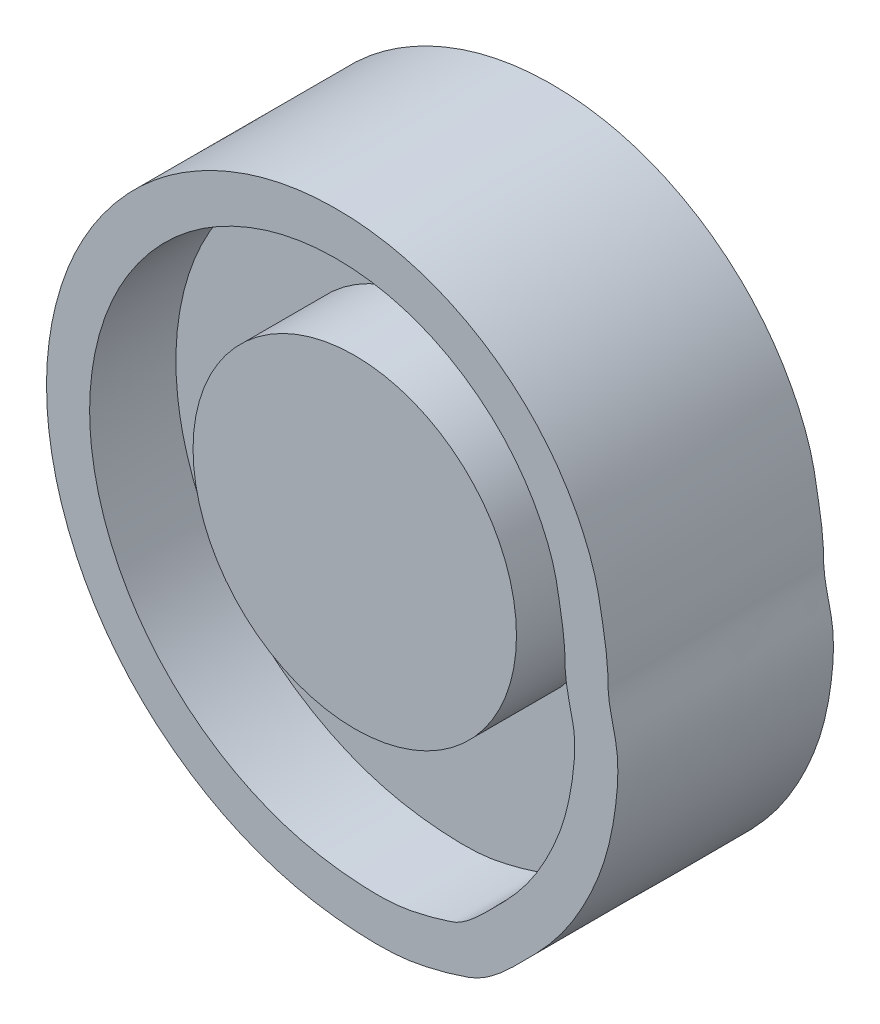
ISO-10303-21;
HEADER;
FILE_DESCRIPTION(('STEP AP214'),'2;1');
FILE_NAME('part.step','',(''),(''),'','','');
FILE_SCHEMA(('AUTOMOTIVE_DESIGN { 1 0 10303 214 1 1 1 1 }'));
ENDSEC;
DATA;
#1=APPLICATION_CONTEXT('core data for automotive mechanical design processes');
#2=APPLICATION_PROTOCOL_DEFINITION('international standard','automotive_design',2000,#1);
#3=PRODUCT_CONTEXT('',#1,'mechanical');
#4=PRODUCT('Part','Part','',(#3));
#5=PRODUCT_RELATED_PRODUCT_CATEGORY('part','',(#4));
#6=PRODUCT_DEFINITION_FORMATION('','',#4);
#7=PRODUCT_DEFINITION_CONTEXT('part definition',#1,'design');
#8=PRODUCT_DEFINITION('design','',#6,#7);
#9=PRODUCT_DEFINITION_SHAPE('','',#8);
#10=(LENGTH_UNIT() NAMED_UNIT(*) SI_UNIT(.MILLI.,.METRE.));
#11=(NAMED_UNIT(*) PLANE_ANGLE_UNIT() SI_UNIT($,.RADIAN.));
#12=(NAMED_UNIT(*) SI_UNIT($,.STERADIAN.) SOLID_ANGLE_UNIT());
#13=UNCERTAINTY_MEASURE_WITH_UNIT(LENGTH_MEASURE(1.E-05),#10,'distance_accuracy_value','');
#14=(GEOMETRIC_REPRESENTATION_CONTEXT(3) GLOBAL_UNCERTAINTY_ASSIGNED_CONTEXT((#13)) GLOBAL_UNIT_ASSIGNED_CONTEXT((#10,
#11,#12)) REPRESENTATION_CONTEXT('',''));
#15=CARTESIAN_POINT('',(0.,0.,0.));
#16=DIRECTION('',(0.,0.,1.));
#17=DIRECTION('',(1.,0.,0.));
#18=AXIS2_PLACEMENT_3D('',#15,#16,#17);
#19=CARTESIAN_POINT('',(-28.3363839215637,-5.51319432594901,20.));
#20=DIRECTION('',(0.,0.,1.));
#21=DIRECTION('',(1.,0.,0.));
#22=AXIS2_PLACEMENT_3D('',#19,#20,#21);
#23=PLANE('',#22);
#24=CARTESIAN_POINT('',(-24.4272377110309,-4.543995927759,19.9999999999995));
#25=CARTESIAN_POINT('',(-24.3836822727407,-4.91553856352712,19.9999999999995));
#26=CARTESIAN_POINT('',(-24.3315467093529,-5.2860679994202,19.9999999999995));
#27=CARTESIAN_POINT('',(-24.2107283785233,-6.02228435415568,19.9999999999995));
#28=CARTESIAN_POINT('',(-24.1421401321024,-6.38798678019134,19.9999999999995));
#29=CARTESIAN_POINT('',(-23.9888014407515,-7.1146525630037,19.9999999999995));
#30=CARTESIAN_POINT('',(-23.9041081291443,-7.47562799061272,19.9999999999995));
#31=CARTESIAN_POINT('',(-23.7190135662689,-8.19296501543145,19.9999999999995));
#32=CARTESIAN_POINT('',(-23.6186352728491,-8.54933254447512,19.9999999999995));
#33=CARTESIAN_POINT('',(-23.402483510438,-9.25755215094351,19.9999999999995));
#34=CARTESIAN_POINT('',(-23.2867027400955,-9.60940199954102,19.9999999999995));
#35=CARTESIAN_POINT('',(-23.0396470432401,-10.3085582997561,19.9999999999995));
#36=CARTESIAN_POINT('',(-22.9083360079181,-10.6558519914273,19.9999999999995));
#37=CARTESIAN_POINT('',(-22.6302245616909,-11.3459064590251,19.9999999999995));
#38=CARTESIAN_POINT('',(-22.4833603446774,-11.6886415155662,19.9999999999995));
#39=CARTESIAN_POINT('',(-22.1741406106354,-12.3689846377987,19.9999999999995));
#40=CARTESIAN_POINT('',(-22.0117158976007,-12.7065612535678,19.9999999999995));
#41=CARTESIAN_POINT('',(-21.6730830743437,-13.3729203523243,19.9999999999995));
#42=CARTESIAN_POINT('',(-21.4969365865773,-13.7017341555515,19.9999999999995));
#43=CARTESIAN_POINT('',(-21.1313193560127,-14.3499353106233,19.9999999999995));
#44=CARTESIAN_POINT('',(-20.9419116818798,-14.6693582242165,19.9999999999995));
#45=CARTESIAN_POINT('',(-20.5498202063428,-15.2988064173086,19.9999999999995));
#46=CARTESIAN_POINT('',(-20.3471719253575,-15.6088538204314,19.9999999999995));
#47=CARTESIAN_POINT('',(-19.9286968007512,-16.2196136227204,19.9999999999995));
#48=CARTESIAN_POINT('',(-19.7128790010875,-16.520332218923,19.9999999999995));
#49=CARTESIAN_POINT('',(-19.2680748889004,-17.1124444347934,19.9999999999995));
#50=CARTESIAN_POINT('',(-19.0390727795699,-17.4038261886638,19.9999999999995));
#51=CARTESIAN_POINT('',(-18.5677868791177,-17.9771881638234,19.9999999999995));
#52=CARTESIAN_POINT('',(-18.3254634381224,-18.2591357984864,19.9999999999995));
#53=CARTESIAN_POINT('',(-17.8272623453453,-18.8136706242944,19.9999999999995));
#54=CARTESIAN_POINT('',(-17.5713159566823,-19.0861960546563,19.9999999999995));
#55=CARTESIAN_POINT('',(-17.0474445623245,-19.6199782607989,19.9999999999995));
#56=CARTESIAN_POINT('',(-16.7795086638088,-19.881224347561,19.9999999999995));
#57=CARTESIAN_POINT('',(-16.233673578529,-20.3903245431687,19.9999999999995));
#58=CARTESIAN_POINT('',(-15.955830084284,-20.6382383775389,19.9999999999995));
#59=CARTESIAN_POINT('',(-15.3907299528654,-21.1209417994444,19.9999999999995));
#60=CARTESIAN_POINT('',(-15.1035114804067,-21.355776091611,19.9999999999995));
#61=CARTESIAN_POINT('',(-14.5198521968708,-21.8125889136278,19.9999999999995));
#62=CARTESIAN_POINT('',(-14.2234286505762,-22.0345895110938,19.9999999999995));
#63=CARTESIAN_POINT('',(-13.6216105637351,-22.4660756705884,19.9999999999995));
#64=CARTESIAN_POINT('',(-13.3162159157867,-22.6755610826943,19.9999999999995));
#65=CARTESIAN_POINT('',(-12.6966185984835,-23.0822645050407,19.9999999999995));
#66=CARTESIAN_POINT('',(-12.382401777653,-23.2794609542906,19.9999999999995));
#67=CARTESIAN_POINT('',(-11.7450005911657,-23.6613719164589,19.9999999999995));
#68=CARTESIAN_POINT('',(-11.4217891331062,-23.8460412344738,19.9999999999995));
#69=CARTESIAN_POINT('',(-10.7663908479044,-24.2025813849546,19.9999999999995));
#70=CARTESIAN_POINT('',(-10.4341686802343,-24.374387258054,19.9999999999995));
#71=CARTESIAN_POINT('',(-9.7630975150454,-24.7037776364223,19.9999999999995));
#72=CARTESIAN_POINT('',(-9.42425441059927,-24.861374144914,19.9999999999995));
#73=CARTESIAN_POINT('',(-8.7420987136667,-25.1612235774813,19.9999999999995));
#74=CARTESIAN_POINT('',(-8.39882159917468,-25.3035571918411,19.9999999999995));
#75=CARTESIAN_POINT('',(-7.70771384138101,-25.5730395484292,19.9999999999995));
#76=CARTESIAN_POINT('',(-7.35990292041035,-25.7002388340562,19.9999999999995));
#77=CARTESIAN_POINT('',(-6.65967723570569,-25.9392808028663,19.9999999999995));
#78=CARTESIAN_POINT('',(-6.30727093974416,-26.0511482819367,19.9999999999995));
#79=CARTESIAN_POINT('',(-5.59785681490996,-26.2595398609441,19.9999999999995));
#80=CARTESIAN_POINT('',(-5.24084793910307,-26.3560604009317,19.9999999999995));
#81=CARTESIAN_POINT('',(-4.52210856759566,-26.5333023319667,19.9999999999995));
#82=CARTESIAN_POINT('',(-4.16036951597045,-26.6139890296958,19.9999999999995));
#83=CARTESIAN_POINT('',(-3.4323716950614,-26.7601662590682,19.9999999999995));
#84=CARTESIAN_POINT('',(-3.06610074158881,-26.8255957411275,19.9999999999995));
#85=CARTESIAN_POINT('',(-2.32954944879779,-26.9423703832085,19.9999999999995));
#86=CARTESIAN_POINT('',(-1.95925832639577,-26.9936470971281,19.9999999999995));
#87=CARTESIAN_POINT('',(-1.21729445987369,-27.0828074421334,19.9999999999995));
#88=CARTESIAN_POINT('',(-0.84562256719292,-27.1206982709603,19.9999999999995));
#89=CARTESIAN_POINT('',(-0.103106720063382,-27.1850752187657,19.9999999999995));
#90=CARTESIAN_POINT('',(0.267732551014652,-27.2116155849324,19.9999999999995));
#91=CARTESIAN_POINT('',(1.00874683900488,-27.2518874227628,19.9999999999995));
#92=CARTESIAN_POINT('',(1.37891921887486,-27.2656660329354,19.9999999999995));
#93=CARTESIAN_POINT('',(2.11853388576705,-27.2771505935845,19.9999999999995));
#94=CARTESIAN_POINT('',(2.48797514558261,-27.2749033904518,19.9999999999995));
#95=CARTESIAN_POINT('',(3.04137556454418,-27.2552079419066,19.9999999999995));
#96=CARTESIAN_POINT('',(3.22562793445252,-27.2459303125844,19.9999999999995));
#97=CARTESIAN_POINT('',(3.59383058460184,-27.2213443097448,19.9999999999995));
#98=CARTESIAN_POINT('',(3.77778067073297,-27.2060329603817,19.9999999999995));
#99=CARTESIAN_POINT('',(4.14533858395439,-27.1685327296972,19.9999999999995));
#100=CARTESIAN_POINT('',(4.32894512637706,-27.1463310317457,19.9999999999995));
#101=CARTESIAN_POINT('',(4.69573544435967,-27.0941802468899,19.9999999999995));
#102=CARTESIAN_POINT('',(4.87891529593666,-27.0642034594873,19.9999999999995));
#103=CARTESIAN_POINT('',(5.24482889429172,-26.9972069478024,19.9999999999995));
#104=CARTESIAN_POINT('',(5.4275566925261,-26.9601553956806,19.9999999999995));
#105=CARTESIAN_POINT('',(5.79279499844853,-26.8818129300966,19.9999999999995));
#106=CARTESIAN_POINT('',(5.97530213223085,-26.8405066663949,19.9999999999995));
#107=CARTESIAN_POINT('',(6.34028633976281,-26.7552793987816,19.9999999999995));
#108=CARTESIAN_POINT('',(6.52276163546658,-26.7113508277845,19.9999999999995));
#109=CARTESIAN_POINT('',(6.8874973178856,-26.620753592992,19.9999999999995));
#110=CARTESIAN_POINT('',(7.06975617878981,-26.5740787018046,19.9999999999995));
#111=CARTESIAN_POINT('',(7.43289539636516,-26.4761086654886,19.9999999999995));
#112=CARTESIAN_POINT('',(7.61377666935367,-26.4248169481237,19.9999999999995));
#113=CARTESIAN_POINT('',(7.97388722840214,-26.318036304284,19.9999999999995));
#114=CARTESIAN_POINT('',(8.15311908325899,-26.2625559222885,19.9999999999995));
#115=CARTESIAN_POINT('',(8.42167061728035,-26.17860057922,19.9999999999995));
#116=CARTESIAN_POINT('',(8.51111062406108,-26.150501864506,19.9999999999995));
#117=CARTESIAN_POINT('',(8.68976597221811,-26.0937654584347,19.9999999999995));
#118=CARTESIAN_POINT('',(8.77898140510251,-26.065128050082,19.9999999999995));
#119=CARTESIAN_POINT('',(8.95689348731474,-26.0065498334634,19.9999999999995));
#120=CARTESIAN_POINT('',(9.04559061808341,-25.9766105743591,19.9999999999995));
#121=CARTESIAN_POINT('',(9.17733053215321,-25.9282347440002,19.9999999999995));
#122=CARTESIAN_POINT('',(9.22100265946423,-25.9115417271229,19.9999999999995));
#123=CARTESIAN_POINT('',(9.30769574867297,-25.8765078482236,19.9999999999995));
#124=CARTESIAN_POINT('',(9.35071659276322,-25.8581666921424,19.9999999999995));
#125=CARTESIAN_POINT('',(9.43603269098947,-25.819644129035,19.9999999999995));
#126=CARTESIAN_POINT('',(9.4783262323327,-25.7994589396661,19.9999999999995));
#127=CARTESIAN_POINT('',(9.56234146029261,-25.7575961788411,19.9999999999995));
#128=CARTESIAN_POINT('',(9.60406074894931,-25.7359138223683,19.9999999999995));
#129=CARTESIAN_POINT('',(9.68693390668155,-25.6911171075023,19.9999999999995));
#130=CARTESIAN_POINT('',(9.72808492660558,-25.6679974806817,19.9999999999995));
#131=CARTESIAN_POINT('',(9.80986157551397,-25.6204654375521,19.9999999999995));
#132=CARTESIAN_POINT('',(9.85048427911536,-25.5960480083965,19.9999999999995));
#133=CARTESIAN_POINT('',(9.97185849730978,-25.5208785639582,19.9999999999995));
#134=CARTESIAN_POINT('',(10.0516002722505,-25.4684920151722,19.9999999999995));
#135=CARTESIAN_POINT('',(10.209373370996,-25.3600300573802,19.9999999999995));
#136=CARTESIAN_POINT('',(10.2873877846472,-25.3039303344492,19.9999999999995));
#137=CARTESIAN_POINT('',(10.441570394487,-25.1892232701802,19.9999999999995));
#138=CARTESIAN_POINT('',(10.5177381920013,-25.1306153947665,19.9999999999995));
#139=CARTESIAN_POINT('',(10.6680268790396,-25.0115070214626,19.9999999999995));
#140=CARTESIAN_POINT('',(10.7421553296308,-24.9510160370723,19.9999999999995));
#141=CARTESIAN_POINT('',(10.961755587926,-24.7674471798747,19.9999999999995));
#142=CARTESIAN_POINT('',(11.1050704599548,-24.6417967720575,19.9999999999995));
#143=CARTESIAN_POINT('',(11.3876293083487,-24.3868337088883,19.9999999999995));
#144=CARTESIAN_POINT('',(11.5268835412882,-24.2575322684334,19.9999999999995));
#145=CARTESIAN_POINT('',(11.802569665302,-23.9963219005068,19.9999999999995));
#146=CARTESIAN_POINT('',(11.9390049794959,-23.8644165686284,19.9999999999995));
#147=CARTESIAN_POINT('',(12.3469966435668,-23.4676826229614,19.9999999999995));
#148=CARTESIAN_POINT('',(12.6174037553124,-23.2016792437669,19.9999999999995));
#149=CARTESIAN_POINT('',(13.1543247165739,-22.6660657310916,19.9999999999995));
#150=CARTESIAN_POINT('',(13.420840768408,-22.3964578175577,19.9999999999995));
#151=CARTESIAN_POINT('',(13.9474035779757,-21.851198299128,19.9999999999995));
#152=CARTESIAN_POINT('',(14.2074532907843,-21.5755495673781,19.9999999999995));
#153=CARTESIAN_POINT('',(14.7173691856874,-21.0146628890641,19.9999999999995));
#154=CARTESIAN_POINT('',(14.9672309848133,-20.7294209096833,19.9999999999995));
#155=CARTESIAN_POINT('',(15.4520455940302,-20.145051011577,19.9999999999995));
#156=CARTESIAN_POINT('',(15.686953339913,-19.8458854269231,19.9999999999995));
#157=CARTESIAN_POINT('',(16.140676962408,-19.2327292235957,19.9999999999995));
#158=CARTESIAN_POINT('',(16.359384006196,-18.9186581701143,19.9999999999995));
#159=CARTESIAN_POINT('',(16.7804510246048,-18.2780825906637,19.9999999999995));
#160=CARTESIAN_POINT('',(16.9827462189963,-17.9515356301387,19.9999999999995));
#161=CARTESIAN_POINT('',(17.3698542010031,-17.2911663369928,19.9999999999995));
#162=CARTESIAN_POINT('',(17.5547733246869,-16.9574060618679,19.9999999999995));
#163=CARTESIAN_POINT('',(17.9091108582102,-16.28369462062,19.9999999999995));
#164=CARTESIAN_POINT('',(18.0785956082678,-15.9437782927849,19.9999999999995));
#165=CARTESIAN_POINT('',(18.4014910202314,-15.257431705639,19.9999999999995));
#166=CARTESIAN_POINT('',(18.5549418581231,-14.9110204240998,19.9999999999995));
#167=CARTESIAN_POINT('',(18.8442962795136,-14.2110873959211,19.9999999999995));
#168=CARTESIAN_POINT('',(18.9802069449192,-13.8575685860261,19.9999999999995));
#169=CARTESIAN_POINT('',(19.2333849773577,-13.1429597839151,19.9999999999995));
#170=CARTESIAN_POINT('',(19.350608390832,-12.7818541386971,19.9999999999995));
#171=CARTESIAN_POINT('',(19.5647839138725,-12.0512655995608,19.9999999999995));
#172=CARTESIAN_POINT('',(19.6616067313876,-11.6817448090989,19.9999999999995));
#173=CARTESIAN_POINT('',(19.8364532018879,-10.935836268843,19.9999999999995));
#174=CARTESIAN_POINT('',(19.9143521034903,-10.5594196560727,19.9999999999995));
#175=CARTESIAN_POINT('',(20.0533719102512,-9.80414421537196,19.9999999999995));
#176=CARTESIAN_POINT('',(20.1145185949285,-9.4252900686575,19.9999999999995));
#177=CARTESIAN_POINT('',(20.2216040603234,-8.66784513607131,19.9999999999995));
#178=CARTESIAN_POINT('',(20.2676348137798,-8.28926729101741,19.9999999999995));
#179=CARTESIAN_POINT('',(20.3259095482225,-7.72101167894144,19.9999999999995));
#180=CARTESIAN_POINT('',(20.3435166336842,-7.53187721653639,19.9999999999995));
#181=CARTESIAN_POINT('',(20.3730333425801,-7.15365479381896,19.9999999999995));
#182=CARTESIAN_POINT('',(20.384958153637,-6.96456807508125,19.9999999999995));
#183=CARTESIAN_POINT('',(20.4014109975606,-6.58645960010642,19.9999999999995));
#184=CARTESIAN_POINT('',(20.4059553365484,-6.39743862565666,19.9999999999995));
#185=CARTESIAN_POINT('',(20.4058605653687,-6.11398208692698,19.9999999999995));
#186=CARTESIAN_POINT('',(20.4046786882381,-6.01954152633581,19.9999999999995));
#187=CARTESIAN_POINT('',(20.3998176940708,-5.83069232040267,19.9999999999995));
#188=CARTESIAN_POINT('',(20.3961378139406,-5.73628369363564,19.9999999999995));
#189=CARTESIAN_POINT('',(20.3859635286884,-5.54750335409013,19.9999999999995));
#190=CARTESIAN_POINT('',(20.3794657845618,-5.45313181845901,19.9999999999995));
#191=CARTESIAN_POINT('',(20.3632785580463,-5.26442156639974,19.9999999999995));
#192=CARTESIAN_POINT('',(20.3535812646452,-5.17008350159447,19.9999999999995));
#193=CARTESIAN_POINT('',(20.3303264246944,-4.98147828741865,19.9999999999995));
#194=CARTESIAN_POINT('',(20.3167528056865,-4.88721310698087,19.9999999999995));
#195=CARTESIAN_POINT('',(20.2861517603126,-4.69876857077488,19.9999999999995));
#196=CARTESIAN_POINT('',(20.2691072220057,-4.60459205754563,19.9999999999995));
#197=CARTESIAN_POINT('',(20.2145766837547,-4.3216223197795,19.9999999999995));
#198=CARTESIAN_POINT('',(20.1738512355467,-4.13346752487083,19.9999999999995));
#199=CARTESIAN_POINT('',(20.0891139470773,-3.75723590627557,19.9999999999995));
#200=CARTESIAN_POINT('',(20.0450907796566,-3.56916181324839,19.9999999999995));
#201=CARTESIAN_POINT('',(19.9152460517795,-3.00508418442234,19.9999999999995));
#202=CARTESIAN_POINT('',(19.831482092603,-2.62854505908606,19.9999999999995));
#203=CARTESIAN_POINT('',(19.7215211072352,-2.06061377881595,19.9999999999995));
#204=CARTESIAN_POINT('',(19.6874809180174,-1.87077790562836,19.9999999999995));
#205=CARTESIAN_POINT('',(19.6264036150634,-1.48927556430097,19.9999999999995));
#206=CARTESIAN_POINT('',(19.5993916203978,-1.29760500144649,19.9999999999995));
#207=CARTESIAN_POINT('',(19.5541688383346,-0.911905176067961,19.9999999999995));
#208=CARTESIAN_POINT('',(19.5360178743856,-0.717868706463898,19.9999999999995));
#209=CARTESIAN_POINT('',(19.5159635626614,-0.425693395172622,19.9999999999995));
#210=CARTESIAN_POINT('',(19.5104679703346,-0.32778800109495,19.9999999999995));
#211=CARTESIAN_POINT('',(19.5018936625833,-0.13133073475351,19.9999999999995));
#212=CARTESIAN_POINT('',(19.4988282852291,-0.0327782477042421,19.9999999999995));
#213=CARTESIAN_POINT('',(19.4954038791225,0.164900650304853,19.9999999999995));
#214=CARTESIAN_POINT('',(19.4950596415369,0.26402727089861,19.9999999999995));
#215=CARTESIAN_POINT('',(19.4945644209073,0.41276110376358,19.9999999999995));
#216=CARTESIAN_POINT('',(19.4944027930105,0.462371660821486,19.9999999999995));
#217=CARTESIAN_POINT('',(19.4938617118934,0.561510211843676,19.9999999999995));
#218=CARTESIAN_POINT('',(19.493482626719,0.611038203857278,19.9999999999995));
#219=CARTESIAN_POINT('',(19.4916013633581,0.709839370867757,19.9999999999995));
#220=CARTESIAN_POINT('',(19.4901045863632,0.7591126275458,19.9999999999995));
#221=CARTESIAN_POINT('',(19.4858308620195,0.857351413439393,19.9999999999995));
#222=CARTESIAN_POINT('',(19.4830604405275,0.906317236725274,19.9999999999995));
#223=CARTESIAN_POINT('',(19.4736901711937,1.05278685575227,19.9999999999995));
#224=CARTESIAN_POINT('',(19.4660191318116,1.1502161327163,19.9999999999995));
#225=CARTESIAN_POINT('',(19.4508652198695,1.34500383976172,19.9999999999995));
#226=CARTESIAN_POINT('',(19.4433821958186,1.44236226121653,19.9999999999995));
#227=CARTESIAN_POINT('',(19.4278596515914,1.63693753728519,19.9999999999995));
#228=CARTESIAN_POINT('',(19.4198206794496,1.73415443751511,19.9999999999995));
#229=CARTESIAN_POINT('',(19.394013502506,2.02501354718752,19.9999999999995));
#230=CARTESIAN_POINT('',(19.3745120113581,2.2185296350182,19.9999999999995));
#231=CARTESIAN_POINT('',(19.3260475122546,2.60334000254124,19.9999999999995));
#232=CARTESIAN_POINT('',(19.297134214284,2.79464060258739,19.9999999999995));
#233=CARTESIAN_POINT('',(19.2359522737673,3.17627722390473,19.9999999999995));
#234=CARTESIAN_POINT('',(19.203690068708,3.36661438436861,19.9999999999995));
#235=CARTESIAN_POINT('',(19.1407063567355,3.74759255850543,19.9999999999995));
#236=CARTESIAN_POINT('',(19.1099851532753,3.93823362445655,19.9999999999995));
#237=CARTESIAN_POINT('',(19.0481946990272,4.31943270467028,19.9999999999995));
#238=CARTESIAN_POINT('',(19.0171254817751,4.5099907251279,19.9999999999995));
#239=CARTESIAN_POINT('',(18.9220068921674,5.08091525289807,19.9999999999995));
#240=CARTESIAN_POINT('',(18.8559779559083,5.46098255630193,19.9999999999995));
#241=CARTESIAN_POINT('',(18.7456687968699,6.02858562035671,19.9999999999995));
#242=CARTESIAN_POINT('',(18.7070601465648,6.21720636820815,19.9999999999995));
#243=CARTESIAN_POINT('',(18.6243762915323,6.59305927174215,19.9999999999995));
#244=CARTESIAN_POINT('',(18.5803069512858,6.78029269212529,19.9999999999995));
#245=CARTESIAN_POINT('',(18.4846092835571,7.15281900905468,19.9999999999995));
#246=CARTESIAN_POINT('',(18.4329815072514,7.33811204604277,19.9999999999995));
#247=CARTESIAN_POINT('',(18.3222526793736,7.70673986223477,19.9999999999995));
#248=CARTESIAN_POINT('',(18.2631407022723,7.89007134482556,19.9999999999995));
#249=CARTESIAN_POINT('',(18.1381012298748,8.25495496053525,19.9999999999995));
#250=CARTESIAN_POINT('',(18.072155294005,8.43650075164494,19.9999999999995));
#251=CARTESIAN_POINT('',(17.9339316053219,8.79794140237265,19.9999999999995));
#252=CARTESIAN_POINT('',(17.8616309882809,8.9778274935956,19.9999999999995));
#253=CARTESIAN_POINT('',(17.7111259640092,9.33606294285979,19.9999999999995));
#254=CARTESIAN_POINT('',(17.6328964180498,9.5144017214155,19.9999999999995));
#255=CARTESIAN_POINT('',(17.4709700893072,9.86964905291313,19.9999999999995));
#256=CARTESIAN_POINT('',(17.3872478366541,10.0465459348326,19.9999999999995));
#257=CARTESIAN_POINT('',(17.1277778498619,10.576887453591,19.9999999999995));
#258=CARTESIAN_POINT('',(16.945025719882,10.9269361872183,19.9999999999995));
#259=CARTESIAN_POINT('',(16.557798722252,11.6215090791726,19.9999999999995));
#260=CARTESIAN_POINT('',(16.353047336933,11.9658795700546,19.9999999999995));
#261=CARTESIAN_POINT('',(16.0298133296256,12.4753175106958,19.9999999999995));
#262=CARTESIAN_POINT('',(15.9186009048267,12.6450324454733,19.9999999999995));
#263=CARTESIAN_POINT('',(15.6909365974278,12.9814108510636,19.9999999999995));
#264=CARTESIAN_POINT('',(15.5744747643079,13.1480676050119,19.9999999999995));
#265=CARTESIAN_POINT('',(15.337012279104,13.476948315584,19.9999999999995));
#266=CARTESIAN_POINT('',(15.2160350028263,13.639189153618,19.9999999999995));
#267=CARTESIAN_POINT('',(14.9696173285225,13.9593687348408,19.9999999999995));
#268=CARTESIAN_POINT('',(14.8441934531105,14.1173201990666,19.9999999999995));
#269=CARTESIAN_POINT('',(14.5889616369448,14.4289988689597,19.9999999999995));
#270=CARTESIAN_POINT('',(14.459165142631,14.5827354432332,19.9999999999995));
#271=CARTESIAN_POINT('',(14.195224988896,14.8860083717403,19.9999999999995));
#272=CARTESIAN_POINT('',(14.0610882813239,15.0355507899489,19.9999999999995));
#273=CARTESIAN_POINT('',(13.6521722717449,15.4778843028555,19.9999999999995));
#274=CARTESIAN_POINT('',(13.3707323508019,15.7645706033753,19.9999999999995));
#275=CARTESIAN_POINT('',(12.7906201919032,16.3212806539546,19.9999999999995));
#276=CARTESIAN_POINT('',(12.4919095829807,16.591264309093,19.9999999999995));
#277=CARTESIAN_POINT('',(11.8773904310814,17.1147535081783,19.9999999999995));
#278=CARTESIAN_POINT('',(11.5614928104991,17.3681544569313,19.9999999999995));
#279=CARTESIAN_POINT('',(10.9144238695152,17.8572864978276,19.9999999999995));
#280=CARTESIAN_POINT('',(10.5831990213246,18.0929467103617,19.9999999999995));
#281=CARTESIAN_POINT('',(9.9099914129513,18.5435997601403,19.9999999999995));
#282=CARTESIAN_POINT('',(9.56808929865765,18.7587131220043,19.9999999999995));
#283=CARTESIAN_POINT('',(8.8739824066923,19.1685787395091,19.9999999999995));
#284=CARTESIAN_POINT('',(8.52182006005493,19.3634028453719,19.9999999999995));
#285=CARTESIAN_POINT('',(7.80722494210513,19.7327518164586,19.9999999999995));
#286=CARTESIAN_POINT('',(7.44479730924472,19.9072866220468,19.9999999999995));
#287=CARTESIAN_POINT('',(6.70966960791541,20.2360662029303,19.9999999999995));
#288=CARTESIAN_POINT('',(6.33694432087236,20.3902546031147,19.9999999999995));
#289=CARTESIAN_POINT('',(5.58102905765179,20.6779860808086,19.9999999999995));
#290=CARTESIAN_POINT('',(5.19778950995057,20.8113989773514,19.9999999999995));
#291=CARTESIAN_POINT('',(4.42414081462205,21.0559733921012,19.9999999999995));
#292=CARTESIAN_POINT('',(4.03372951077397,21.1671280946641,19.9999999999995));
#293=CARTESIAN_POINT('',(3.24951285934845,21.3659133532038,19.9999999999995));
#294=CARTESIAN_POINT('',(2.8557429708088,21.4536838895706,19.9999999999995));
#295=CARTESIAN_POINT('',(2.06519008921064,21.606588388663,19.9999999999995));
#296=CARTESIAN_POINT('',(1.66842129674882,21.6717959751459,19.9999999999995));
#297=CARTESIAN_POINT('',(0.871860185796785,21.7801043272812,19.9999999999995));
#298=CARTESIAN_POINT('',(0.472067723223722,21.8232040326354,19.9999999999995));
#299=CARTESIAN_POINT('',(-0.330493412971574,21.8873077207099,19.9999999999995));
#300=CARTESIAN_POINT('',(-0.733267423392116,21.9082447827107,19.9999999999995));
#301=CARTESIAN_POINT('',(-1.54172855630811,21.9281856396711,19.9999999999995));
#302=CARTESIAN_POINT('',(-1.94741883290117,21.9270591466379,19.9999999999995));
#303=CARTESIAN_POINT('',(-2.75810778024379,21.9030029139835,19.9999999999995));
#304=CARTESIAN_POINT('',(-3.16310652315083,21.8800756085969,19.9999999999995));
#305=CARTESIAN_POINT('',(-3.96882557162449,21.8122336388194,19.9999999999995));
#306=CARTESIAN_POINT('',(-4.36955697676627,21.7674513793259,19.9999999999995));
#307=CARTESIAN_POINT('',(-5.16674979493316,21.656065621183,19.9999999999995));
#308=CARTESIAN_POINT('',(-5.56322040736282,21.5895279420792,19.9999999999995));
#309=CARTESIAN_POINT('',(-6.35193694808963,21.4348888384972,19.9999999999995));
#310=CARTESIAN_POINT('',(-6.74418283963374,21.346787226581,19.9999999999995));
#311=CARTESIAN_POINT('',(-7.52442575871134,21.1488451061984,19.9999999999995));
#312=CARTESIAN_POINT('',(-7.91240623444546,21.0389392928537,19.9999999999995));
#313=CARTESIAN_POINT('',(-8.68404424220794,20.7970970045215,19.9999999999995));
#314=CARTESIAN_POINT('',(-9.06766071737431,20.6650296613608,19.9999999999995));
#315=CARTESIAN_POINT('',(-9.82730451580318,20.3803881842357,19.9999999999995));
#316=CARTESIAN_POINT('',(-10.203329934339,20.2278089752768,19.9999999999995));
#317=CARTESIAN_POINT('',(-10.9447124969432,19.903988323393,19.9999999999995));
#318=CARTESIAN_POINT('',(-11.3101179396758,19.732857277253,19.9999999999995));
#319=CARTESIAN_POINT('',(-12.0307261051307,19.3728130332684,19.9999999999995));
#320=CARTESIAN_POINT('',(-12.3859555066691,19.1839532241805,19.9999999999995));
#321=CARTESIAN_POINT('',(-13.0860179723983,18.788038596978,19.9999999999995));
#322=CARTESIAN_POINT('',(-13.4308537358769,18.5809885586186,19.9999999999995));
#323=CARTESIAN_POINT('',(-14.1098709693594,18.1482529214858,19.9999999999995));
#324=CARTESIAN_POINT('',(-14.4440230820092,17.9225212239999,19.9999999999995));
#325=CARTESIAN_POINT('',(-15.1014101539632,17.4519619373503,19.9999999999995));
#326=CARTESIAN_POINT('',(-15.4245743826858,17.2070354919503,19.9999999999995));
#327=CARTESIAN_POINT('',(-16.0575447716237,16.6995974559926,19.9999999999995));
#328=CARTESIAN_POINT('',(-16.3673310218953,16.43706104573,19.9999999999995));
#329=CARTESIAN_POINT('',(-16.9709856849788,15.8972959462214,19.9999999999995));
#330=CARTESIAN_POINT('',(-17.2649269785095,15.6201486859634,19.9999999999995));
#331=CARTESIAN_POINT('',(-17.8368379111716,15.0521143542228,19.9999999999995));
#332=CARTESIAN_POINT('',(-18.1148677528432,14.7612878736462,19.9999999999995));
#333=CARTESIAN_POINT('',(-18.6554328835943,14.1660188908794,19.9999999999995));
#334=CARTESIAN_POINT('',(-18.9179807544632,13.8615878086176,19.9999999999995));
#335=CARTESIAN_POINT('',(-19.4278398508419,13.2393295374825,19.9999999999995));
#336=CARTESIAN_POINT('',(-19.675123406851,12.9214796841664,19.9999999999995));
#337=CARTESIAN_POINT('',(-20.1544231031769,12.2723488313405,19.9999999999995));
#338=CARTESIAN_POINT('',(-20.3863687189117,11.9410157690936,19.9999999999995));
#339=CARTESIAN_POINT('',(-20.8344828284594,11.2654867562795,19.9999999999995));
#340=CARTESIAN_POINT('',(-21.0505677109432,10.9212353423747,19.9999999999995));
#341=CARTESIAN_POINT('',(-21.4639007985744,10.2239590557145,19.9999999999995));
#342=CARTESIAN_POINT('',(-21.6612391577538,9.87098766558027,19.9999999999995));
#343=CARTESIAN_POINT('',(-22.0364476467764,9.15699000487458,19.9999999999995));
#344=CARTESIAN_POINT('',(-22.2144063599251,8.79601032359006,19.9999999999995));
#345=CARTESIAN_POINT('',(-22.5509143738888,8.06604211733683,19.9999999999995));
#346=CARTESIAN_POINT('',(-22.709503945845,7.69707215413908,19.9999999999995));
#347=CARTESIAN_POINT('',(-23.0075858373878,6.95126346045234,19.9999999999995));
#348=CARTESIAN_POINT('',(-23.1470674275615,6.57442044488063,19.9999999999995));
#349=CARTESIAN_POINT('',(-23.4071828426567,5.8129675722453,19.9999999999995));
#350=CARTESIAN_POINT('',(-23.5277560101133,5.42833701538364,19.9999999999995));
#351=CARTESIAN_POINT('',(-23.7503535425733,4.65128517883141,19.9999999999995));
#352=CARTESIAN_POINT('',(-23.8522636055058,4.25883121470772,19.9999999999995));
#353=CARTESIAN_POINT('',(-24.0369266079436,3.46927472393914,19.9999999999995));
#354=CARTESIAN_POINT('',(-24.1196717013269,3.07217036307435,19.9999999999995));
#355=CARTESIAN_POINT('',(-24.2651220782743,2.27667679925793,19.9999999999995));
#356=CARTESIAN_POINT('',(-24.3279404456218,1.87830829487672,19.9999999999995));
#357=CARTESIAN_POINT('',(-24.4336887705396,1.08046509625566,19.9999999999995));
#358=CARTESIAN_POINT('',(-24.4766927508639,0.681000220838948,19.9999999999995));
#359=CARTESIAN_POINT('',(-24.5428224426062,-0.119032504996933,19.9999999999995));
#360=CARTESIAN_POINT('',(-24.5659748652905,-0.519598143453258,19.9999999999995));
#361=CARTESIAN_POINT('',(-24.5923632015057,-1.32182896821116,19.9999999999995));
#362=CARTESIAN_POINT('',(-24.5955770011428,-1.72349488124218,19.9999999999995));
#363=CARTESIAN_POINT('',(-24.5820907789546,-2.52793418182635,19.9999999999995));
#364=CARTESIAN_POINT('',(-24.5653192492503,-2.93070637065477,19.9999999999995));
#365=CARTESIAN_POINT('',(-24.5115746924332,-3.73738470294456,19.9999999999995));
#366=CARTESIAN_POINT('',(-24.4744782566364,-4.14128262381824,19.9999999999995));
#367=CARTESIAN_POINT('',(-24.4272377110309,-4.543995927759,19.9999999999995));
#368=B_SPLINE_CURVE_WITH_KNOTS('',3,(#24,#25,#26,#27,#28,#29,#30,#31,#32,#33,#34,#35,#36,#37,
#38,#39,#40,#41,#42,#43,#44,#45,#46,#47,#48,#49,#50,#51,#52,#53,#54,#55,#56,#57,#58,#59,#60,#61,
#62,#63,#64,#65,#66,#67,#68,#69,#70,#71,#72,#73,#74,#75,#76,#77,#78,#79,#80,#81,#82,#83,#84,#85,
#86,#87,#88,#89,#90,#91,#92,#93,#94,#95,#96,#97,#98,#99,#100,#101,#102,#103,#104,#105,#106,#107,
#108,#109,#110,#111,#112,#113,#114,#115,#116,#117,#118,#119,#120,#121,#122,#123,#124,#125,#126,
#127,#128,#129,#130,#131,#132,#133,#134,#135,#136,#137,#138,#139,#140,#141,#142,#143,#144,#145,
#146,#147,#148,#149,#150,#151,#152,#153,#154,#155,#156,#157,#158,#159,#160,#161,#162,#163,#164,
#165,#166,#167,#168,#169,#170,#171,#172,#173,#174,#175,#176,#177,#178,#179,#180,#181,#182,#183,
#184,#185,#186,#187,#188,#189,#190,#191,#192,#193,#194,#195,#196,#197,#198,#199,#200,#201,#202,
#203,#204,#205,#206,#207,#208,#209,#210,#211,#212,#213,#214,#215,#216,#217,#218,#219,#220,#221,
#222,#223,#224,#225,#226,#227,#228,#229,#230,#231,#232,#233,#234,#235,#236,#237,#238,#239,#240,
#241,#242,#243,#244,#245,#246,#247,#248,#249,#250,#251,#252,#253,#254,#255,#256,#257,#258,#259,
#260,#261,#262,#263,#264,#265,#266,#267,#268,#269,#270,#271,#272,#273,#274,#275,#276,#277,#278,
#279,#280,#281,#282,#283,#284,#285,#286,#287,#288,#289,#290,#291,#292,#293,#294,#295,#296,#297,
#298,#299,#300,#301,#302,#303,#304,#305,#306,#307,#308,#309,#310,#311,#312,#313,#314,#315,#316,
#317,#318,#319,#320,#321,#322,#323,#324,#325,#326,#327,#328,#329,#330,#331,#332,#333,#334,#335,
#336,#337,#338,#339,#340,#341,#342,#343,#344,#345,#346,#347,#348,#349,#350,#351,#352,#353,#354,
#355,#356,#357,#358,#359,#360,#361,#362,#363,#364,#365,#366,#367),.UNSPECIFIED.,.F.,.F.,(4,2,2,
2,2,2,2,2,2,2,2,2,2,2,2,2,2,2,2,2,2,2,2,2,2,2,2,2,2,2,2,2,2,2,2,2,2,2,2,2,2,2,2,2,2,2,2,2,2,2,2,
2,2,2,2,2,2,2,2,2,2,2,2,2,2,2,2,2,2,2,2,2,2,2,2,2,2,2,2,2,2,2,2,2,2,2,2,2,2,2,2,2,2,2,2,2,2,2,2,
2,2,2,2,2,2,2,2,2,2,2,2,2,2,2,2,2,2,2,2,2,2,2,2,2,2,2,2,2,2,2,2,2,2,2,2,2,2,2,2,2,2,2,2,2,2,2,2,
2,2,2,2,2,2,2,2,2,2,2,2,2,2,2,2,2,2,2,2,2,2,2,2,4),(0.,1.12215057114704,2.23800257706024,
3.34996751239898,4.46031987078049,5.5712004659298,6.68471667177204,7.80299229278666,
8.92649458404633,10.0452138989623,11.1589333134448,12.2697787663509,13.3798697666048,
14.491319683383,15.6062786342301,16.7275258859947,17.8498133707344,18.9665625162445,
20.0792252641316,21.189914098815,22.3006162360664,23.4132152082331,24.5296353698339,
25.6513585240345,26.7721250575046,27.8866393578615,28.9973203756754,30.1061833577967,
31.2153031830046,32.3268266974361,33.4427242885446,34.5639276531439,35.6845272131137,
36.7997095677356,37.9107561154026,39.0185562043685,39.5719296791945,40.1255764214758,
40.6802592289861,41.2369460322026,41.7961989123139,42.3575452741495,42.9205981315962,
43.4849810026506,44.0489482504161,44.6117946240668,44.8930427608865,45.1741470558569,
45.4549255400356,45.5951613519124,45.7354222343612,45.8759775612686,46.0170049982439,
46.1585839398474,46.3007563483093,46.586863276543,46.8750761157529,47.1633506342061,
47.4503506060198,48.0219878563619,48.592027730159,49.1613290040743,50.2992486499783,
51.4364971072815,52.5732159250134,53.7104187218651,54.8509004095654,55.998455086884,
57.1503388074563,58.2946384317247,59.4337612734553,60.5699576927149,61.7056939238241,
62.8440632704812,63.9894435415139,65.1421811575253,66.2931347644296,67.4369497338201,
68.0067610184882,68.575040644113,69.1420630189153,69.425379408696,69.7087823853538,
69.9925220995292,70.2769596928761,70.5625942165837,70.8496726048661,71.427095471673,
72.0066016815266,73.1635120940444,73.7419976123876,74.3225231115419,74.9069154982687,
75.2010710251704,75.4968300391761,75.7941955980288,75.9430301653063,76.0916135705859,
76.2394835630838,76.3866042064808,76.6797855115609,76.9727224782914,77.2653746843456,
77.8486784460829,78.4289500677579,79.0081262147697,79.5874159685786,80.1666503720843,
81.3237524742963,81.9012936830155,82.4782199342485,83.0551041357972,83.6328404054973,
84.2121783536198,84.793693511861,85.3778294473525,85.9648972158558,87.1489567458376,
88.3501823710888,88.9588291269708,89.5686825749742,90.1757271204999,90.7807135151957,
91.3842234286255,91.9868103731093,93.1912527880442,94.3984824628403,95.6127103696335,
96.8315569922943,98.0427473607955,99.2494912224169,100.455641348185,101.66506623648,
102.881788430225,104.098882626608,105.308518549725,106.51416931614,107.719877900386,
108.929216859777,110.145699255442,111.362045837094,112.571113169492,113.77655588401,
114.982009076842,116.191128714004,117.407657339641,118.624487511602,119.834437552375,
121.040854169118,122.246954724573,123.456125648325,124.671994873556,125.889615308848,
127.101049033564,128.307546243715,129.513049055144,130.720676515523,131.933517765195,
133.152351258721,134.364990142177,135.571830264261,136.776116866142,137.981076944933,
139.189826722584,140.405748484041,141.622167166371,142.831553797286,144.036385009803,
145.239592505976,146.444134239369,147.652998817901,148.869286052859),.UNSPECIFIED.);
#369=CARTESIAN_POINT('',(-24.4272377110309,-4.543995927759,19.9999999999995));
#370=VERTEX_POINT('',#369);
#371=EDGE_CURVE('E66',#370,#370,#368,.T.);
#372=ORIENTED_EDGE('',*,*,#371,.F.);
#373=EDGE_LOOP('',(#372));
#374=FACE_BOUND('',#373,.T.);
#375=CARTESIAN_POINT('',(23.5,0.,20.));
#376=CARTESIAN_POINT('',(23.4905857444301,0.272539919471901,20.));
#377=CARTESIAN_POINT('',(23.5040374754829,0.821233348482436,20.));
#378=CARTESIAN_POINT('',(23.4398549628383,1.64052559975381,20.));
#379=CARTESIAN_POINT('',(23.3764160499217,2.45827502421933,20.));
#380=CARTESIAN_POINT('',(23.2758657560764,3.27239116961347,20.));
#381=CARTESIAN_POINT('',(22.954334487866,5.16845137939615,20.));
#382=CARTESIAN_POINT('',(22.5139308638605,8.1971059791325,20.));
#383=CARTESIAN_POINT('',(20.9521979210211,12.116141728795,20.));
#384=CARTESIAN_POINT('',(18.774492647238,15.7660030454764,20.));
#385=CARTESIAN_POINT('',(15.9449518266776,19.0164339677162,20.));
#386=CARTESIAN_POINT('',(12.5463664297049,21.7429127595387,20.));
#387=CARTESIAN_POINT('',(8.68331059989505,23.8763503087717,20.));
#388=CARTESIAN_POINT('',(4.45816042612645,25.3238282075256,20.));
#389=CARTESIAN_POINT('',(-0.00830395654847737,26.0012111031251,20.));
#390=CARTESIAN_POINT('',(-4.57334212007,25.9004474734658,20.));
#391=CARTESIAN_POINT('',(-9.10651077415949,24.9984792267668,20.));
#392=CARTESIAN_POINT('',(-13.4511963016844,23.2818183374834,20.));
#393=CARTESIAN_POINT('',(-17.4906549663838,20.83354489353,20.));
#394=CARTESIAN_POINT('',(-21.062853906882,17.6629519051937,20.));
#395=CARTESIAN_POINT('',(-24.0635611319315,13.8836337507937,20.));
#396=CARTESIAN_POINT('',(-26.4035806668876,9.60036468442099,20.));
#397=CARTESIAN_POINT('',(-27.9502353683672,4.91835178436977,20.));
#398=CARTESIAN_POINT('',(-28.6880097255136,-0.0099865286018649,20.));
#399=CARTESIAN_POINT('',(-28.5476317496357,-5.0423977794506,20.));
#400=CARTESIAN_POINT('',(-27.5050463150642,-10.0204901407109,20.));
#401=CARTESIAN_POINT('',(-25.6044460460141,-14.7930037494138,20.));
#402=CARTESIAN_POINT('',(-22.88422365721,-19.213544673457,20.));
#403=CARTESIAN_POINT('',(-19.3946531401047,-23.125918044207,20.));
#404=CARTESIAN_POINT('',(-15.2249589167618,-26.3873571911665,20.));
#405=CARTESIAN_POINT('',(-10.5206885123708,-28.9196048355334,20.));
#406=CARTESIAN_POINT('',(-5.38528920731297,-30.6089145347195,20.));
#407=CARTESIAN_POINT('',(0.00148363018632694,-31.3210439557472,20.));
#408=CARTESIAN_POINT('',(4.04134596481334,-31.3180493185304,20.));
#409=CARTESIAN_POINT('',(6.55104350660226,-30.8161745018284,20.));
#410=CARTESIAN_POINT('',(7.62004117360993,-30.5641892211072,20.));
#411=CARTESIAN_POINT('',(8.68318852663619,-30.2884450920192,20.));
#412=CARTESIAN_POINT('',(9.73028530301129,-29.9611046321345,20.));
#413=CARTESIAN_POINT('',(12.1902160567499,-29.175290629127,20.));
#414=CARTESIAN_POINT('',(15.182377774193,-26.3319523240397,20.));
#415=CARTESIAN_POINT('',(18.8859618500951,-22.5614039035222,20.));
#416=CARTESIAN_POINT('',(21.5976558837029,-18.1584390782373,20.));
#417=CARTESIAN_POINT('',(23.4595491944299,-13.5669785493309,20.));
#418=CARTESIAN_POINT('',(24.3182724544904,-8.90309846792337,20.));
#419=CARTESIAN_POINT('',(24.5793548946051,-4.30958811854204,20.));
#420=CARTESIAN_POINT('',(23.5499229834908,-1.44525563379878,20.));
#421=CARTESIAN_POINT('',(23.5,0.,20.));
#422=B_SPLINE_CURVE_WITH_KNOTS('',3,(#375,#376,#377,#378,#379,#380,#381,#382,#383,#384,#385,
#386,#387,#388,#389,#390,#391,#392,#393,#394,#395,#396,#397,#398,#399,#400,#401,#402,#403,#404,
#405,#406,#407,#408,#409,#410,#411,#412,#413,#414,#415,#416,#417,#418,#419,#420,#421),
.UNSPECIFIED.,.T.,.F.,(4,1,1,1,1,1,1,1,1,1,1,1,1,1,1,1,1,1,1,1,1,1,1,1,1,1,1,1,1,1,1,1,1,1,1,1,
1,1,1,1,1,1,1,1,4),(0.,0.00471936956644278,0.00944715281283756,0.0141833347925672,
0.0188801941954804,0.0236013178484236,0.0473935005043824,0.0714941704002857,0.0958621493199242,
0.12050025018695,0.145468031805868,0.170710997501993,0.196317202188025,0.222166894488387,
0.248300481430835,0.274766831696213,0.301537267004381,0.328550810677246,0.35590693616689,
0.383553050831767,0.411468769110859,0.439731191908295,0.468241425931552,0.497084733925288,
0.526181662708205,0.555601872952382,0.585340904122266,0.615339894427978,0.645629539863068,
0.676269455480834,0.707152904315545,0.738364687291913,0.769861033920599,0.776192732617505,
0.782516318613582,0.788825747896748,0.795142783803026,0.801476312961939,0.833208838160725,
0.863795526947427,0.893271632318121,0.921633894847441,0.948845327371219,0.974973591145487,1.),.UNSPECIFIED.);
#423=CARTESIAN_POINT('',(23.5,0.,20.));
#424=VERTEX_POINT('',#423);
#425=EDGE_CURVE('E42',#424,#424,#422,.T.);
#426=ORIENTED_EDGE('',*,*,#425,.T.);
#427=EDGE_LOOP('',(#426));
#428=FACE_BOUND('',#427,.T.);
#429=ADVANCED_FACE('F31',(#374,#428),#23,.T.);
#430=CARTESIAN_POINT('',(-28.3363839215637,-5.51319432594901,0.));
#431=DIRECTION('',(0.,0.,1.));
#432=DIRECTION('',(1.,0.,0.));
#433=AXIS2_PLACEMENT_3D('',#430,#431,#432);
#434=PLANE('',#433);
#435=CARTESIAN_POINT('',(-24.4272377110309,-4.543995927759,0.));
#436=CARTESIAN_POINT('',(-24.4725400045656,-4.15804380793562,0.));
#437=CARTESIAN_POINT('',(-24.5085890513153,-3.771001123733,0.));
#438=CARTESIAN_POINT('',(-24.5618840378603,-2.99787675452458,0.));
#439=CARTESIAN_POINT('',(-24.5792376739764,-2.61180248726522,0.));
#440=CARTESIAN_POINT('',(-24.5953446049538,-1.84060806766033,0.));
#441=CARTESIAN_POINT('',(-24.5941623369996,-1.45548926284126,0.));
#442=CARTESIAN_POINT('',(-24.5734718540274,-0.686201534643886,0.));
#443=CARTESIAN_POINT('',(-24.553985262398,-0.302032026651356,0.));
#444=CARTESIAN_POINT('',(-24.4968461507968,0.465367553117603,0.));
#445=CARTESIAN_POINT('',(-24.4591741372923,0.848596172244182,0.));
#446=CARTESIAN_POINT('',(-24.3656468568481,1.61411616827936,0.));
#447=CARTESIAN_POINT('',(-24.3097317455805,1.99640023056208,0.));
#448=CARTESIAN_POINT('',(-24.1796501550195,2.76011824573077,0.));
#449=CARTESIAN_POINT('',(-24.1053801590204,3.14153454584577,0.));
#450=CARTESIAN_POINT('',(-23.9391342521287,3.90058361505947,0.));
#451=CARTESIAN_POINT('',(-23.8471541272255,4.2782154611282,0.));
#452=CARTESIAN_POINT('',(-23.6460244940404,5.02655006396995,0.));
#453=CARTESIAN_POINT('',(-23.536977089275,5.39728022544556,0.));
#454=CARTESIAN_POINT('',(-23.3015980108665,6.13165039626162,0.));
#455=CARTESIAN_POINT('',(-23.1753342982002,6.49531216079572,0.));
#456=CARTESIAN_POINT('',(-22.9053223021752,7.21545742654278,0.));
#457=CARTESIAN_POINT('',(-22.7616010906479,7.57195106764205,0.));
#458=CARTESIAN_POINT('',(-22.456439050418,8.2776555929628,0.));
#459=CARTESIAN_POINT('',(-22.294982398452,8.62685963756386,0.));
#460=CARTESIAN_POINT('',(-21.9543478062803,9.31797526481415,0.));
#461=CARTESIAN_POINT('',(-21.7751118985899,9.65985825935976,0.));
#462=CARTESIAN_POINT('',(-21.3990916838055,10.3364160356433,0.));
#463=CARTESIAN_POINT('',(-21.2022119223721,10.6710377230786,0.));
#464=CARTESIAN_POINT('',(-20.7921496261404,11.3309776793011,0.));
#465=CARTESIAN_POINT('',(-20.578938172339,11.656277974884,0.));
#466=CARTESIAN_POINT('',(-20.1380965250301,12.2946618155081,0.));
#467=CARTESIAN_POINT('',(-19.9105401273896,12.6077963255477,0.));
#468=CARTESIAN_POINT('',(-19.4416914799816,13.2213825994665,0.));
#469=CARTESIAN_POINT('',(-19.2004655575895,13.5218850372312,0.));
#470=CARTESIAN_POINT('',(-18.7040805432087,14.1103503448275,0.));
#471=CARTESIAN_POINT('',(-18.4489440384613,14.3983322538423,0.));
#472=CARTESIAN_POINT('',(-17.9245198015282,14.9615534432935,0.));
#473=CARTESIAN_POINT('',(-17.6552206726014,15.2367821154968,0.));
#474=CARTESIAN_POINT('',(-17.1023573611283,15.7744045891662,0.));
#475=CARTESIAN_POINT('',(-16.8187488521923,16.0367528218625,0.));
#476=CARTESIAN_POINT('',(-16.2367351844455,16.5483761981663,0.));
#477=CARTESIAN_POINT('',(-15.9382468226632,16.7975567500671,0.));
#478=CARTESIAN_POINT('',(-15.3285773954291,17.2802654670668,0.));
#479=CARTESIAN_POINT('',(-15.0173890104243,17.5137843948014,0.));
#480=CARTESIAN_POINT('',(-14.3850491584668,17.9626788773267,0.));
#481=CARTESIAN_POINT('',(-14.0639702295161,18.178156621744,0.));
#482=CARTESIAN_POINT('',(-13.4124945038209,18.5916074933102,0.));
#483=CARTESIAN_POINT('',(-13.0821385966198,18.7896451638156,0.));
#484=CARTESIAN_POINT('',(-12.4125355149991,19.1691440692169,0.));
#485=CARTESIAN_POINT('',(-12.0732987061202,19.3506236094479,0.));
#486=CARTESIAN_POINT('',(-11.3858932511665,19.6969433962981,0.));
#487=CARTESIAN_POINT('',(-11.0377139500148,19.8617625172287,0.));
#488=CARTESIAN_POINT('',(-10.3322440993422,20.17415757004,0.));
#489=CARTESIAN_POINT('',(-9.97492600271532,20.3216713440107,0.));
#490=CARTESIAN_POINT('',(-9.25109283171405,20.5990727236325,0.));
#491=CARTESIAN_POINT('',(-8.88453598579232,20.7288514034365,0.));
#492=CARTESIAN_POINT('',(-8.14526227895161,20.9689603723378,0.));
#493=CARTESIAN_POINT('',(-7.7725479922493,21.0792985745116,0.));
#494=CARTESIAN_POINT('',(-7.02413914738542,21.2792099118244,0.));
#495=CARTESIAN_POINT('',(-6.64847882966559,21.3689111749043,0.));
#496=CARTESIAN_POINT('',(-5.89427151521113,21.5280022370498,0.));
#497=CARTESIAN_POINT('',(-5.51573940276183,21.5974626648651,0.));
#498=CARTESIAN_POINT('',(-4.75585291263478,21.7164738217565,0.));
#499=CARTESIAN_POINT('',(-4.37450085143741,21.7660393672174,0.));
#500=CARTESIAN_POINT('',(-3.60900039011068,21.8455276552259,0.));
#501=CARTESIAN_POINT('',(-3.22484797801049,21.875411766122,0.));
#502=CARTESIAN_POINT('',(-2.45369854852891,21.9152171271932,0.));
#503=CARTESIAN_POINT('',(-2.06669664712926,21.9250438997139,0.));
#504=CARTESIAN_POINT('',(-1.29033482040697,21.9245258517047,0.));
#505=CARTESIAN_POINT('',(-0.900974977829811,21.9140570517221,0.));
#506=CARTESIAN_POINT('',(-0.125130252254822,21.8727167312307,0.));
#507=CARTESIAN_POINT('',(0.261359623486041,21.8419390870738,0.));
#508=CARTESIAN_POINT('',(1.03014703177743,21.7601749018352,0.));
#509=CARTESIAN_POINT('',(1.41245592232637,21.709295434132,0.));
#510=CARTESIAN_POINT('',(2.17284701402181,21.5871575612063,0.));
#511=CARTESIAN_POINT('',(2.55093730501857,21.5159496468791,0.));
#512=CARTESIAN_POINT('',(3.30284002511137,21.352953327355,0.));
#513=CARTESIAN_POINT('',(3.67665041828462,21.2611555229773,0.));
#514=CARTESIAN_POINT('',(4.41996009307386,21.0568098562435,0.));
#515=CARTESIAN_POINT('',(4.78943980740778,20.9441907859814,0.));
#516=CARTESIAN_POINT('',(5.52410063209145,20.697932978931,0.));
#517=CARTESIAN_POINT('',(5.88923580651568,20.5641573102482,0.));
#518=CARTESIAN_POINT('',(6.61186308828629,20.2768910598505,0.));
#519=CARTESIAN_POINT('',(6.96935152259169,20.1233912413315,0.));
#520=CARTESIAN_POINT('',(7.67317761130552,19.7979981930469,0.));
#521=CARTESIAN_POINT('',(8.01957054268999,19.6262245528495,0.));
#522=CARTESIAN_POINT('',(8.70137285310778,19.264783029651,0.));
#523=CARTESIAN_POINT('',(9.03681565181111,19.0751781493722,0.));
#524=CARTESIAN_POINT('',(9.69688796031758,18.6783426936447,0.));
#525=CARTESIAN_POINT('',(10.0215226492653,18.4711207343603,0.));
#526=CARTESIAN_POINT('',(10.6598643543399,18.0388513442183,0.));
#527=CARTESIAN_POINT('',(10.9735426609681,17.8137615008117,0.));
#528=CARTESIAN_POINT('',(11.5897911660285,17.345421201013,0.));
#529=CARTESIAN_POINT('',(11.8922902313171,17.1020770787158,0.));
#530=CARTESIAN_POINT('',(12.4841286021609,16.5977514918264,0.));
#531=CARTESIAN_POINT('',(12.7734159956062,16.3367090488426,0.));
#532=CARTESIAN_POINT('',(13.3344765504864,15.8002861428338,0.));
#533=CARTESIAN_POINT('',(13.6063590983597,15.5250201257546,0.));
#534=CARTESIAN_POINT('',(14.1325733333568,14.9605253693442,0.));
#535=CARTESIAN_POINT('',(14.3869791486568,14.6713657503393,0.));
#536=CARTESIAN_POINT('',(14.8783284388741,14.0791655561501,0.));
#537=CARTESIAN_POINT('',(15.1152928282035,13.7761423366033,0.));
#538=CARTESIAN_POINT('',(15.5718346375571,13.1562907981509,0.));
#539=CARTESIAN_POINT('',(15.7913743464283,12.8394347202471,0.));
#540=CARTESIAN_POINT('',(16.2133259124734,12.1921215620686,0.));
#541=CARTESIAN_POINT('',(16.4156405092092,11.8616011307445,0.));
#542=CARTESIAN_POINT('',(16.8030216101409,11.1882226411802,0.));
#543=CARTESIAN_POINT('',(16.9879870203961,10.8453066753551,0.));
#544=CARTESIAN_POINT('',(17.3391218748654,10.1525037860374,0.));
#545=CARTESIAN_POINT('',(17.5053968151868,9.80267061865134,0.));
#546=CARTESIAN_POINT('',(17.7387430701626,9.27183726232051,0.));
#547=CARTESIAN_POINT('',(17.8136959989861,9.09428712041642,0.));
#548=CARTESIAN_POINT('',(17.9577243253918,8.73724443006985,0.));
#549=CARTESIAN_POINT('',(18.0268117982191,8.55775677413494,0.));
#550=CARTESIAN_POINT('',(18.158656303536,8.19669710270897,0.));
#551=CARTESIAN_POINT('',(18.2214203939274,8.01512766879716,0.));
#552=CARTESIAN_POINT('',(18.3400867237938,7.64971682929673,0.));
#553=CARTESIAN_POINT('',(18.3959879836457,7.46587510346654,0.));
#554=CARTESIAN_POINT('',(18.5000140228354,7.09565962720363,0.));
#555=CARTESIAN_POINT('',(18.5481250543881,6.9092820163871,0.));
#556=CARTESIAN_POINT('',(18.63785154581,6.53443986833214,0.));
#557=CARTESIAN_POINT('',(18.6794483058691,6.34597092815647,0.));
#558=CARTESIAN_POINT('',(18.7580721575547,5.96753890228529,0.));
#559=CARTESIAN_POINT('',(18.7950859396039,5.77757309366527,0.));
#560=CARTESIAN_POINT('',(18.8658798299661,5.39659491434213,0.));
#561=CARTESIAN_POINT('',(18.8996522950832,5.20558114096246,0.));
#562=CARTESIAN_POINT('',(18.9652539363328,4.82293499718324,0.));
#563=CARTESIAN_POINT('',(18.9970801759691,4.6313021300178,0.));
#564=CARTESIAN_POINT('',(19.0596859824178,4.24778123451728,0.));
#565=CARTESIAN_POINT('',(19.090465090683,4.0558931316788,0.));
#566=CARTESIAN_POINT('',(19.1535290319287,3.67234597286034,0.));
#567=CARTESIAN_POINT('',(19.1858140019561,3.48068693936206,0.));
#568=CARTESIAN_POINT('',(19.2333689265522,3.19307744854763,0.));
#569=CARTESIAN_POINT('',(19.249073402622,3.09719841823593,0.));
#570=CARTESIAN_POINT('',(19.2797978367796,2.90539041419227,0.));
#571=CARTESIAN_POINT('',(19.2948182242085,2.80946151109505,0.));
#572=CARTESIAN_POINT('',(19.3368153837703,2.52151754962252,0.));
#573=CARTESIAN_POINT('',(19.3607836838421,2.32905131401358,0.));
#574=CARTESIAN_POINT('',(19.3915288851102,2.03990397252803,0.));
#575=CARTESIAN_POINT('',(19.4009069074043,1.94348255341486,0.));
#576=CARTESIAN_POINT('',(19.4183099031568,1.75052748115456,0.));
#577=CARTESIAN_POINT('',(19.4263349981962,1.65399383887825,0.));
#578=CARTESIAN_POINT('',(19.4420258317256,1.46089644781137,0.));
#579=CARTESIAN_POINT('',(19.4496915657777,1.36433269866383,0.));
#580=CARTESIAN_POINT('',(19.4646546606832,1.17117687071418,0.));
#581=CARTESIAN_POINT('',(19.4719520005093,1.07458479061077,0.));
#582=CARTESIAN_POINT('',(19.484446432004,0.881163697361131,0.));
#583=CARTESIAN_POINT('',(19.4896422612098,0.784334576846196,0.));
#584=CARTESIAN_POINT('',(19.4944399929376,0.590330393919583,0.));
#585=CARTESIAN_POINT('',(19.4940291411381,0.493155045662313,0.));
#586=CARTESIAN_POINT('',(19.4943339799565,0.34741194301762,0.));
#587=CARTESIAN_POINT('',(19.4945891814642,0.298829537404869,0.));
#588=CARTESIAN_POINT('',(19.4953482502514,0.2016869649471,0.));
#589=CARTESIAN_POINT('',(19.4958520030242,0.153126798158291,0.));
#590=CARTESIAN_POINT('',(19.4980473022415,0.00754900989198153,0.));
#591=CARTESIAN_POINT('',(19.5004225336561,-0.089461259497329,0.));
#592=CARTESIAN_POINT('',(19.5078949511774,-0.283265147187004,0.));
#593=CARTESIAN_POINT('',(19.5129889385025,-0.380058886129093,0.));
#594=CARTESIAN_POINT('',(19.5255645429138,-0.573439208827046,0.));
#595=CARTESIAN_POINT('',(19.5330449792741,-0.670025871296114,0.));
#596=CARTESIAN_POINT('',(19.5590946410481,-0.959546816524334,0.));
#597=CARTESIAN_POINT('',(19.5812691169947,-1.15216454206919,0.));
#598=CARTESIAN_POINT('',(19.6337041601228,-1.53666991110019,0.));
#599=CARTESIAN_POINT('',(19.6639815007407,-1.72855519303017,0.));
#600=CARTESIAN_POINT('',(19.7309135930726,-2.11176534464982,0.));
#601=CARTESIAN_POINT('',(19.7675865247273,-2.30308699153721,0.));
#602=CARTESIAN_POINT('',(19.845699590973,-2.68530725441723,0.));
#603=CARTESIAN_POINT('',(19.8871529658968,-2.87620312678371,0.));
#604=CARTESIAN_POINT('',(19.9730586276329,-3.25766992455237,0.));
#605=CARTESIAN_POINT('',(20.017516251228,-3.44823962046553,0.));
#606=CARTESIAN_POINT('',(20.1054019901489,-3.82947820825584,0.));
#607=CARTESIAN_POINT('',(20.1488308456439,-4.02014692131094,0.));
#608=CARTESIAN_POINT('',(20.2101566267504,-4.30674983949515,0.));
#609=CARTESIAN_POINT('',(20.2299417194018,-4.40227383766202,0.));
#610=CARTESIAN_POINT('',(20.2672087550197,-4.59352595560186,0.));
#611=CARTESIAN_POINT('',(20.2846965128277,-4.68925291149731,0.));
#612=CARTESIAN_POINT('',(20.3159567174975,-4.88105368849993,0.));
#613=CARTESIAN_POINT('',(20.3297392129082,-4.97712584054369,0.));
#614=CARTESIAN_POINT('',(20.3534571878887,-5.16959329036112,0.));
#615=CARTESIAN_POINT('',(20.3633983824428,-5.26598789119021,0.));
#616=CARTESIAN_POINT('',(20.3799750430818,-5.4590477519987,0.));
#617=CARTESIAN_POINT('',(20.3866107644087,-5.55571299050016,0.));
#618=CARTESIAN_POINT('',(20.3969530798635,-5.74928568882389,0.));
#619=CARTESIAN_POINT('',(20.4006569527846,-5.84619329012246,0.));
#620=CARTESIAN_POINT('',(20.4077257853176,-6.13753682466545,0.));
#621=CARTESIAN_POINT('',(20.407006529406,-6.33207709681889,0.));
#622=CARTESIAN_POINT('',(20.3968762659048,-6.7218354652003,0.));
#623=CARTESIAN_POINT('',(20.387422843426,-6.91705223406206,0.));
#624=CARTESIAN_POINT('',(20.3618530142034,-7.3080175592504,0.));
#625=CARTESIAN_POINT('',(20.3457031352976,-7.50376380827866,0.));
#626=CARTESIAN_POINT('',(20.2902798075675,-8.09287461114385,0.));
#627=CARTESIAN_POINT('',(20.2441533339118,-8.48558584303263,0.));
#628=CARTESIAN_POINT('',(20.1374785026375,-9.27024814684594,0.));
#629=CARTESIAN_POINT('',(20.0768868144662,-9.66219329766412,0.));
#630=CARTESIAN_POINT('',(19.9380938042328,-10.4404565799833,0.));
#631=CARTESIAN_POINT('',(19.8600063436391,-10.8267946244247,0.));
#632=CARTESIAN_POINT('',(19.6840519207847,-11.5929645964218,0.));
#633=CARTESIAN_POINT('',(19.5862856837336,-11.9728193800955,0.));
#634=CARTESIAN_POINT('',(19.3684915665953,-12.7251639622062,0.));
#635=CARTESIAN_POINT('',(19.2485152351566,-13.0976686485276,0.));
#636=CARTESIAN_POINT('',(18.9880580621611,-13.8357768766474,0.));
#637=CARTESIAN_POINT('',(18.847558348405,-14.2013737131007,0.));
#638=CARTESIAN_POINT('',(18.5477687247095,-14.9262762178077,0.));
#639=CARTESIAN_POINT('',(18.3884137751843,-15.285554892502,0.));
#640=CARTESIAN_POINT('',(18.0519976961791,-15.9982124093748,0.));
#641=CARTESIAN_POINT('',(17.874840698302,-16.3515458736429,0.));
#642=CARTESIAN_POINT('',(17.5038414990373,-17.0509981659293,0.));
#643=CARTESIAN_POINT('',(17.3099410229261,-17.3970861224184,0.));
#644=CARTESIAN_POINT('',(16.9061392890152,-18.0768707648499,0.));
#645=CARTESIAN_POINT('',(16.6963477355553,-18.4106323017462,0.));
#646=CARTESIAN_POINT('',(16.2592752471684,-19.0641968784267,0.));
#647=CARTESIAN_POINT('',(16.0320844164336,-19.3840599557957,0.));
#648=CARTESIAN_POINT('',(15.5597214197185,-20.0093318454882,0.));
#649=CARTESIAN_POINT('',(15.3145815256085,-20.3147650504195,0.));
#650=CARTESIAN_POINT('',(14.8083551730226,-20.9126110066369,0.));
#651=CARTESIAN_POINT('',(14.5472502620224,-21.2050079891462,0.));
#652=CARTESIAN_POINT('',(14.0145810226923,-21.7812928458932,0.));
#653=CARTESIAN_POINT('',(13.7429934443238,-22.0651589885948,0.));
#654=CARTESIAN_POINT('',(13.1928107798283,-22.6271455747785,0.));
#655=CARTESIAN_POINT('',(12.914202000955,-22.9052524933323,0.));
#656=CARTESIAN_POINT('',(12.3547237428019,-23.4597067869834,0.));
#657=CARTESIAN_POINT('',(12.0738524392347,-23.7360523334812,0.));
#658=CARTESIAN_POINT('',(11.6469283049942,-24.1444005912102,0.));
#659=CARTESIAN_POINT('',(11.503773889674,-24.279407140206,0.));
#660=CARTESIAN_POINT('',(11.2137626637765,-24.5450591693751,0.));
#661=CARTESIAN_POINT('',(11.0669107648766,-24.6757099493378,0.));
#662=CARTESIAN_POINT('',(10.8427666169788,-24.8670894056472,0.));
#663=CARTESIAN_POINT('',(10.7674250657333,-24.9301026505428,0.));
#664=CARTESIAN_POINT('',(10.6150764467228,-25.0541480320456,0.));
#665=CARTESIAN_POINT('',(10.5380688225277,-25.115179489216,0.));
#666=CARTESIAN_POINT('',(10.381920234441,-25.2346983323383,0.));
#667=CARTESIAN_POINT('',(10.3027763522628,-25.2931819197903,0.));
#668=CARTESIAN_POINT('',(10.1419270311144,-25.4071106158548,0.));
#669=CARTESIAN_POINT('',(10.0602141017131,-25.4625452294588,0.));
#670=CARTESIAN_POINT('',(9.93549319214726,-25.5428513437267,0.));
#671=CARTESIAN_POINT('',(9.89344266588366,-25.5692140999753,0.));
#672=CARTESIAN_POINT('',(9.80847680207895,-25.620829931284,0.));
#673=CARTESIAN_POINT('',(9.76555911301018,-25.6460791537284,0.));
#674=CARTESIAN_POINT('',(9.6789768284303,-25.6951822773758,0.));
#675=CARTESIAN_POINT('',(9.63531284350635,-25.7190372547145,0.));
#676=CARTESIAN_POINT('',(9.54738828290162,-25.7651445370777,0.));
#677=CARTESIAN_POINT('',(9.50313121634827,-25.7874034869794,0.));
#678=CARTESIAN_POINT('',(9.41395512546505,-25.8297871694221,0.));
#679=CARTESIAN_POINT('',(9.36904228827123,-25.8499248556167,0.));
#680=CARTESIAN_POINT('',(9.2786153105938,-25.8882182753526,0.));
#681=CARTESIAN_POINT('',(9.23310461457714,-25.906382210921,0.));
#682=CARTESIAN_POINT('',(9.14165521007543,-25.9412688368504,0.));
#683=CARTESIAN_POINT('',(9.09571767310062,-25.9579946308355,0.));
#684=CARTESIAN_POINT('',(9.00353567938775,-25.9904205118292,0.));
#685=CARTESIAN_POINT('',(8.95729156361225,-26.0061215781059,0.));
#686=CARTESIAN_POINT('',(8.81835725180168,-26.0524852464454,0.));
#687=CARTESIAN_POINT('',(8.72542708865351,-26.082421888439,0.));
#688=CARTESIAN_POINT('',(8.53936214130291,-26.1415943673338,0.));
#689=CARTESIAN_POINT('',(8.44622738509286,-26.1708302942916,0.));
#690=CARTESIAN_POINT('',(8.16677763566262,-26.2583840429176,0.));
#691=CARTESIAN_POINT('',(7.98040778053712,-26.316550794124,0.));
#692=CARTESIAN_POINT('',(7.60601130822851,-26.4274891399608,0.));
#693=CARTESIAN_POINT('',(7.41798437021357,-26.4802596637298,0.));
#694=CARTESIAN_POINT('',(7.04059342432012,-26.5812838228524,0.));
#695=CARTESIAN_POINT('',(6.85122853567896,-26.6295341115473,0.));
#696=CARTESIAN_POINT('',(6.47167204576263,-26.7235643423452,0.));
#697=CARTESIAN_POINT('',(6.28147977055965,-26.7693415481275,0.));
#698=CARTESIAN_POINT('',(5.90025229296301,-26.8576989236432,0.));
#699=CARTESIAN_POINT('',(5.7092167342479,-26.9002775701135,0.));
#700=CARTESIAN_POINT('',(5.32661370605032,-26.9804172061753,0.));
#701=CARTESIAN_POINT('',(5.13504908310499,-27.0179914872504,0.));
#702=CARTESIAN_POINT('',(4.75151907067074,-27.0852197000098,0.));
#703=CARTESIAN_POINT('',(4.55956081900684,-27.1149134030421,0.));
#704=CARTESIAN_POINT('',(4.17526769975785,-27.1654775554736,0.));
#705=CARTESIAN_POINT('',(3.98293732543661,-27.1863824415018,0.));
#706=CARTESIAN_POINT('',(3.59803211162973,-27.221088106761,0.));
#707=CARTESIAN_POINT('',(3.40545847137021,-27.2349025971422,0.));
#708=CARTESIAN_POINT('',(3.02007252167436,-27.2561869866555,0.));
#709=CARTESIAN_POINT('',(2.82726040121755,-27.2636603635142,0.));
#710=CARTESIAN_POINT('',(2.44142959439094,-27.2730534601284,0.));
#711=CARTESIAN_POINT('',(2.24841085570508,-27.2749708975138,0.));
#712=CARTESIAN_POINT('',(1.66872161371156,-27.2732680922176,0.));
#713=CARTESIAN_POINT('',(1.28207753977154,-27.2621606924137,0.));
#714=CARTESIAN_POINT('',(0.508108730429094,-27.2263932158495,0.));
#715=CARTESIAN_POINT('',(0.120786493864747,-27.201684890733,0.));
#716=CARTESIAN_POINT('',(-0.652832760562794,-27.1394711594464,0.));
#717=CARTESIAN_POINT('',(-1.03912981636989,-27.1019662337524,0.));
#718=CARTESIAN_POINT('',(-1.80844031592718,-27.0132997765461,0.));
#719=CARTESIAN_POINT('',(-2.19146072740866,-26.9621992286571,0.));
#720=CARTESIAN_POINT('',(-2.95367430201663,-26.844914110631,0.));
#721=CARTESIAN_POINT('',(-3.33287658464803,-26.7787894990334,0.));
#722=CARTESIAN_POINT('',(-4.08704532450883,-26.6298674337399,0.));
#723=CARTESIAN_POINT('',(-4.46201988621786,-26.5471112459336,0.));
#724=CARTESIAN_POINT('',(-5.20761046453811,-26.3646056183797,0.));
#725=CARTESIAN_POINT('',(-5.57822857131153,-26.2648647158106,0.));
#726=CARTESIAN_POINT('',(-6.31515610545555,-26.0486059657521,0.));
#727=CARTESIAN_POINT('',(-6.68145797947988,-25.9320624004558,0.));
#728=CARTESIAN_POINT('',(-7.40978670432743,-25.6823045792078,0.));
#729=CARTESIAN_POINT('',(-7.77179373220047,-25.5490325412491,0.));
#730=CARTESIAN_POINT('',(-8.49175333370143,-25.2657230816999,0.));
#731=CARTESIAN_POINT('',(-8.84966732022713,-25.1155876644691,0.));
#732=CARTESIAN_POINT('',(-9.55903888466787,-24.7995910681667,0.));
#733=CARTESIAN_POINT('',(-9.91048748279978,-24.6337097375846,0.));
#734=CARTESIAN_POINT('',(-10.6040182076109,-24.2875753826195,0.));
#735=CARTESIAN_POINT('',(-10.9461386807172,-24.1073991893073,0.));
#736=CARTESIAN_POINT('',(-11.6208963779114,-23.7331668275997,0.));
#737=CARTESIAN_POINT('',(-11.9535662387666,-23.5391694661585,0.));
#738=CARTESIAN_POINT('',(-12.609695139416,-23.1377056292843,0.));
#739=CARTESIAN_POINT('',(-12.9331723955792,-22.9302689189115,0.));
#740=CARTESIAN_POINT('',(-13.5708643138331,-22.5018284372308,0.));
#741=CARTESIAN_POINT('',(-13.8850820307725,-22.2808292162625,0.));
#742=CARTESIAN_POINT('',(-14.5040415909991,-21.8249578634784,0.));
#743=CARTESIAN_POINT('',(-14.8087680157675,-21.5900647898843,0.));
#744=CARTESIAN_POINT('',(-15.4086421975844,-21.1062346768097,0.));
#745=CARTESIAN_POINT('',(-15.7037523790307,-20.8572510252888,0.));
#746=CARTESIAN_POINT('',(-16.2841564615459,-20.3446253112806,0.));
#747=CARTESIAN_POINT('',(-16.5693799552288,-20.0809034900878,0.));
#748=CARTESIAN_POINT('',(-17.1276641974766,-19.540524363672,0.));
#749=CARTESIAN_POINT('',(-17.40071680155,-19.2638586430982,0.));
#750=CARTESIAN_POINT('',(-17.932273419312,-18.6998451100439,0.));
#751=CARTESIAN_POINT('',(-18.1908511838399,-18.412566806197,0.));
#752=CARTESIAN_POINT('',(-18.6936113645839,-17.8277137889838,0.));
#753=CARTESIAN_POINT('',(-18.9378481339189,-17.530185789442,0.));
#754=CARTESIAN_POINT('',(-19.4121176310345,-16.9249726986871,0.));
#755=CARTESIAN_POINT('',(-19.6421776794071,-16.6173090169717,0.));
#756=CARTESIAN_POINT('',(-20.0881365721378,-15.9918546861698,0.));
#757=CARTESIAN_POINT('',(-20.3040345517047,-15.6740634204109,0.));
#758=CARTESIAN_POINT('',(-20.7216500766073,-15.0283435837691,0.));
#759=CARTESIAN_POINT('',(-20.923336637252,-14.7003949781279,0.));
#760=CARTESIAN_POINT('',(-21.3125846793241,-14.0343886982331,0.));
#761=CARTESIAN_POINT('',(-21.5000838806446,-13.6962946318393,0.));
#762=CARTESIAN_POINT('',(-21.8606585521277,-13.010135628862,0.));
#763=CARTESIAN_POINT('',(-22.0336493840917,-12.6620262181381,0.));
#764=CARTESIAN_POINT('',(-22.3636680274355,-11.9585999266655,0.));
#765=CARTESIAN_POINT('',(-22.5207062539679,-11.603287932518,0.));
#766=CARTESIAN_POINT('',(-22.8176664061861,-10.8878769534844,0.));
#767=CARTESIAN_POINT('',(-22.9576779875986,-10.5278151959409,0.));
#768=CARTESIAN_POINT('',(-23.2208591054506,-9.80278697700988,0.));
#769=CARTESIAN_POINT('',(-23.3440769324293,-9.43783804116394,0.));
#770=CARTESIAN_POINT('',(-23.5738601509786,-8.70307908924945,0.));
#771=CARTESIAN_POINT('',(-23.6804398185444,-8.33327353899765,0.));
#772=CARTESIAN_POINT('',(-23.8766939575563,-7.58872370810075,0.));
#773=CARTESIAN_POINT('',(-23.9663480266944,-7.21397404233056,0.));
#774=CARTESIAN_POINT('',(-24.1283300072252,-6.45944007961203,0.));
#775=CARTESIAN_POINT('',(-24.2005993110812,-6.07964318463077,0.));
#776=CARTESIAN_POINT('',(-24.3274783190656,-5.31493853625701,0.));
#777=CARTESIAN_POINT('',(-24.3819874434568,-4.9300140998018,0.));
#778=CARTESIAN_POINT('',(-24.4272377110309,-4.543995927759,0.));
#779=B_SPLINE_CURVE_WITH_KNOTS('',3,(#435,#436,#437,#438,#439,#440,#441,#442,#443,#444,#445,
#446,#447,#448,#449,#450,#451,#452,#453,#454,#455,#456,#457,#458,#459,#460,#461,#462,#463,#464,
#465,#466,#467,#468,#469,#470,#471,#472,#473,#474,#475,#476,#477,#478,#479,#480,#481,#482,#483,
#484,#485,#486,#487,#488,#489,#490,#491,#492,#493,#494,#495,#496,#497,#498,#499,#500,#501,#502,
#503,#504,#505,#506,#507,#508,#509,#510,#511,#512,#513,#514,#515,#516,#517,#518,#519,#520,#521,
#522,#523,#524,#525,#526,#527,#528,#529,#530,#531,#532,#533,#534,#535,#536,#537,#538,#539,#540,
#541,#542,#543,#544,#545,#546,#547,#548,#549,#550,#551,#552,#553,#554,#555,#556,#557,#558,#559,
#560,#561,#562,#563,#564,#565,#566,#567,#568,#569,#570,#571,#572,#573,#574,#575,#576,#577,#578,
#579,#580,#581,#582,#583,#584,#585,#586,#587,#588,#589,#590,#591,#592,#593,#594,#595,#596,#597,
#598,#599,#600,#601,#602,#603,#604,#605,#606,#607,#608,#609,#610,#611,#612,#613,#614,#615,#616,
#617,#618,#619,#620,#621,#622,#623,#624,#625,#626,#627,#628,#629,#630,#631,#632,#633,#634,#635,
#636,#637,#638,#639,#640,#641,#642,#643,#644,#645,#646,#647,#648,#649,#650,#651,#652,#653,#654,
#655,#656,#657,#658,#659,#660,#661,#662,#663,#664,#665,#666,#667,#668,#669,#670,#671,#672,#673,
#674,#675,#676,#677,#678,#679,#680,#681,#682,#683,#684,#685,#686,#687,#688,#689,#690,#691,#692,
#693,#694,#695,#696,#697,#698,#699,#700,#701,#702,#703,#704,#705,#706,#707,#708,#709,#710,#711,
#712,#713,#714,#715,#716,#717,#718,#719,#720,#721,#722,#723,#724,#725,#726,#727,#728,#729,#730,
#731,#732,#733,#734,#735,#736,#737,#738,#739,#740,#741,#742,#743,#744,#745,#746,#747,#748,#749,
#750,#751,#752,#753,#754,#755,#756,#757,#758,#759,#760,#761,#762,#763,#764,#765,#766,#767,#768,
#769,#770,#771,#772,#773,#774,#775,#776,#777,#778),.UNSPECIFIED.,.F.,.F.,(4,2,2,2,2,2,2,2,2,2,2,
2,2,2,2,2,2,2,2,2,2,2,2,2,2,2,2,2,2,2,2,2,2,2,2,2,2,2,2,2,2,2,2,2,2,2,2,2,2,2,2,2,2,2,2,2,2,2,2,
2,2,2,2,2,2,2,2,2,2,2,2,2,2,2,2,2,2,2,2,2,2,2,2,2,2,2,2,2,2,2,2,2,2,2,2,2,2,2,2,2,2,2,2,2,2,2,2,
2,2,2,2,2,2,2,2,2,2,2,2,2,2,2,2,2,2,2,2,2,2,2,2,2,2,2,2,2,2,2,2,2,2,2,2,2,2,2,2,2,2,2,2,2,2,2,2,
2,2,2,2,2,2,2,2,2,2,2,2,2,2,2,2,4),(0.,1.16570058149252,2.32464954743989,3.4795705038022,
4.63312883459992,5.78792645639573,6.9465509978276,8.11186527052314,9.27745716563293,
10.4363252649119,11.5907444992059,12.7433958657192,13.8970840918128,15.0546658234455,
16.2189393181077,17.385324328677,18.5461338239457,19.7017264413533,20.855495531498,
22.0102077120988,23.1687474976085,24.3347144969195,25.5013632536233,26.6608798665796,
27.8159071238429,28.9696415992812,30.124821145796,31.2840304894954,32.4500669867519,
33.6156277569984,34.7737439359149,35.927769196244,37.0809334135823,38.2363544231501,
39.3972054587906,40.5651701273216,41.7277734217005,42.8842657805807,44.0379103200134,
45.1920825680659,46.3502776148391,47.5163011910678,48.6828728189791,49.8422318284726,
50.9976382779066,52.1524828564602,53.3101557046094,54.4742394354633,55.642560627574,
56.8026199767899,57.9574087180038,59.1107893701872,60.2666017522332,61.4285587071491,
62.5969129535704,63.7583008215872,64.3363865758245,64.913251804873,65.4894658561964,
66.0657620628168,66.6430644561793,67.2219948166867,67.8025688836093,68.3844799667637,
68.967248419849,69.5502688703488,70.1333424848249,70.4248127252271,70.7160974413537,
71.2977701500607,71.588391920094,71.87898755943,72.1695867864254,72.4602025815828,
72.7509927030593,73.0424444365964,73.188198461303,73.3338854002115,73.6249732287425,
73.9157193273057,74.2063217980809,74.7877591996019,75.3704096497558,75.954744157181,
76.5407378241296,77.1278013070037,77.7144287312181,78.0070696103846,78.298954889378,
78.5900404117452,78.8806911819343,79.1713195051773,79.4622172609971,80.045564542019,
80.6317596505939,81.2209208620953,82.4068192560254,83.5963155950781,84.7782847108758,
85.9543511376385,87.1277214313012,88.3021775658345,89.480809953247,90.6661694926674,
91.8558351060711,93.0379282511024,94.2142673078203,95.3885409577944,96.5641984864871,
97.7426331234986,98.923577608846,100.1055952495,100.695877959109,101.285414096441,
101.580048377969,101.874782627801,102.16994221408,102.466061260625,102.61493963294,
102.764298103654,102.913539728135,103.062118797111,103.209730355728,103.356702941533,
103.503349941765,103.649854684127,103.942743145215,104.235593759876,104.821265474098,
105.407053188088,105.993271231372,106.580125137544,107.167256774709,107.75279650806,
108.335322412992,108.915544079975,109.4946394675,110.073417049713,110.652432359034,
111.812440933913,112.976591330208,114.140698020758,115.299668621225,116.454092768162,
117.605687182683,118.756704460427,119.909502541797,121.066398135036,122.230403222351,
123.39591861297,124.555546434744,125.710505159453,126.862988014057,128.015086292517,
129.168967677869,130.326918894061,131.491894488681,132.657638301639,133.816768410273,
134.971176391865,136.123285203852,137.275464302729,138.430082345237,139.589505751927,
140.755280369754,141.920288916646,143.078869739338,144.234045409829,145.38822439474,
146.54378587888,147.703190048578,148.869050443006),.UNSPECIFIED.);
#780=CARTESIAN_POINT('',(-24.4272377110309,-4.543995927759,0.));
#781=VERTEX_POINT('',#780);
#782=EDGE_CURVE('E133',#781,#781,#779,.T.);
#783=ORIENTED_EDGE('',*,*,#782,.F.);
#784=EDGE_LOOP('',(#783));
#785=FACE_BOUND('',#784,.T.);
#786=CARTESIAN_POINT('',(23.5,0.,0.));
#787=CARTESIAN_POINT('',(23.4905857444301,0.272539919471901,0.));
#788=CARTESIAN_POINT('',(23.5040374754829,0.821233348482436,0.));
#789=CARTESIAN_POINT('',(23.4398549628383,1.64052559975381,0.));
#790=CARTESIAN_POINT('',(23.3764160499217,2.45827502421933,0.));
#791=CARTESIAN_POINT('',(23.2758657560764,3.27239116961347,0.));
#792=CARTESIAN_POINT('',(22.954334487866,5.16845137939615,0.));
#793=CARTESIAN_POINT('',(22.5139308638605,8.1971059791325,0.));
#794=CARTESIAN_POINT('',(20.9521979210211,12.116141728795,0.));
#795=CARTESIAN_POINT('',(18.774492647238,15.7660030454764,0.));
#796=CARTESIAN_POINT('',(15.9449518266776,19.0164339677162,0.));
#797=CARTESIAN_POINT('',(12.5463664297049,21.7429127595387,0.));
#798=CARTESIAN_POINT('',(8.68331059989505,23.8763503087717,0.));
#799=CARTESIAN_POINT('',(4.45816042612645,25.3238282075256,0.));
#800=CARTESIAN_POINT('',(-0.00830395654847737,26.0012111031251,0.));
#801=CARTESIAN_POINT('',(-4.57334212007,25.9004474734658,0.));
#802=CARTESIAN_POINT('',(-9.10651077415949,24.9984792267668,0.));
#803=CARTESIAN_POINT('',(-13.4511963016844,23.2818183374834,0.));
#804=CARTESIAN_POINT('',(-17.4906549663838,20.83354489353,0.));
#805=CARTESIAN_POINT('',(-21.062853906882,17.6629519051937,0.));
#806=CARTESIAN_POINT('',(-24.0635611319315,13.8836337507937,0.));
#807=CARTESIAN_POINT('',(-26.4035806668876,9.60036468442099,0.));
#808=CARTESIAN_POINT('',(-27.9502353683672,4.91835178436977,0.));
#809=CARTESIAN_POINT('',(-28.6880097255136,-0.0099865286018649,0.));
#810=CARTESIAN_POINT('',(-28.5476317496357,-5.0423977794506,0.));
#811=CARTESIAN_POINT('',(-27.5050463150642,-10.0204901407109,0.));
#812=CARTESIAN_POINT('',(-25.6044460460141,-14.7930037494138,0.));
#813=CARTESIAN_POINT('',(-22.88422365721,-19.213544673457,0.));
#814=CARTESIAN_POINT('',(-19.3946531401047,-23.125918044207,0.));
#815=CARTESIAN_POINT('',(-15.2249589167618,-26.3873571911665,0.));
#816=CARTESIAN_POINT('',(-10.5206885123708,-28.9196048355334,0.));
#817=CARTESIAN_POINT('',(-5.38528920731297,-30.6089145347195,0.));
#818=CARTESIAN_POINT('',(0.00148363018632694,-31.3210439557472,0.));
#819=CARTESIAN_POINT('',(4.04134596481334,-31.3180493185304,0.));
#820=CARTESIAN_POINT('',(6.55104350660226,-30.8161745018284,0.));
#821=CARTESIAN_POINT('',(7.62004117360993,-30.5641892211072,0.));
#822=CARTESIAN_POINT('',(8.68318852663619,-30.2884450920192,0.));
#823=CARTESIAN_POINT('',(9.73028530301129,-29.9611046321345,0.));
#824=CARTESIAN_POINT('',(12.1902160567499,-29.175290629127,0.));
#825=CARTESIAN_POINT('',(15.182377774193,-26.3319523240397,0.));
#826=CARTESIAN_POINT('',(18.8859618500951,-22.5614039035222,0.));
#827=CARTESIAN_POINT('',(21.5976558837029,-18.1584390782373,0.));
#828=CARTESIAN_POINT('',(23.4595491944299,-13.5669785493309,0.));
#829=CARTESIAN_POINT('',(24.3182724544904,-8.90309846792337,0.));
#830=CARTESIAN_POINT('',(24.5793548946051,-4.30958811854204,0.));
#831=CARTESIAN_POINT('',(23.5499229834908,-1.44525563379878,0.));
#832=CARTESIAN_POINT('',(23.5,0.,0.));
#833=B_SPLINE_CURVE_WITH_KNOTS('',3,(#786,#787,#788,#789,#790,#791,#792,#793,#794,#795,#796,
#797,#798,#799,#800,#801,#802,#803,#804,#805,#806,#807,#808,#809,#810,#811,#812,#813,#814,#815,
#816,#817,#818,#819,#820,#821,#822,#823,#824,#825,#826,#827,#828,#829,#830,#831,#832),
.UNSPECIFIED.,.T.,.F.,(4,1,1,1,1,1,1,1,1,1,1,1,1,1,1,1,1,1,1,1,1,1,1,1,1,1,1,1,1,1,1,1,1,1,1,1,
1,1,1,1,1,1,1,1,4),(0.,0.00471936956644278,0.00944715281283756,0.0141833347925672,
0.0188801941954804,0.0236013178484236,0.0473935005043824,0.0714941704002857,0.0958621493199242,
0.12050025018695,0.145468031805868,0.170710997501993,0.196317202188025,0.222166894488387,
0.248300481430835,0.274766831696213,0.301537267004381,0.328550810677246,0.35590693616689,
0.383553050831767,0.411468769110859,0.439731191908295,0.468241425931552,0.497084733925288,
0.526181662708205,0.555601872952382,0.585340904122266,0.615339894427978,0.645629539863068,
0.676269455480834,0.707152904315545,0.738364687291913,0.769861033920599,0.776192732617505,
0.782516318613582,0.788825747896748,0.795142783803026,0.801476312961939,0.833208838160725,
0.863795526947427,0.893271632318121,0.921633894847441,0.948845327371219,0.974973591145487,1.),.UNSPECIFIED.);
#834=CARTESIAN_POINT('',(23.5,0.,0.));
#835=VERTEX_POINT('',#834);
#836=EDGE_CURVE('E10',#835,#835,#833,.T.);
#837=ORIENTED_EDGE('',*,*,#836,.F.);
#838=EDGE_LOOP('',(#837));
#839=FACE_BOUND('',#838,.T.);
#840=ADVANCED_FACE('F33',(#785,#839),#434,.F.);
#841=CARTESIAN_POINT('',(23.5,0.,0.));
#842=CARTESIAN_POINT('',(23.5,0.,2.22222222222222));
#843=CARTESIAN_POINT('',(23.5,0.,5.55555555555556));
#844=CARTESIAN_POINT('',(23.5,0.,10.));
#845=CARTESIAN_POINT('',(23.5,0.,14.4444444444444));
#846=CARTESIAN_POINT('',(23.5,0.,17.7777777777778));
#847=CARTESIAN_POINT('',(23.5,0.,20.));
#848=CARTESIAN_POINT('',(23.4905857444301,0.272539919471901,0.));
#849=CARTESIAN_POINT('',(23.4905857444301,0.272539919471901,2.22222222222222));
#850=CARTESIAN_POINT('',(23.4905857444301,0.272539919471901,5.55555555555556));
#851=CARTESIAN_POINT('',(23.4905857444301,0.272539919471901,10.));
#852=CARTESIAN_POINT('',(23.4905857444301,0.272539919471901,14.4444444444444));
#853=CARTESIAN_POINT('',(23.4905857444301,0.272539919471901,17.7777777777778));
#854=CARTESIAN_POINT('',(23.4905857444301,0.272539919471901,20.));
#855=CARTESIAN_POINT('',(23.5040374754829,0.821233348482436,0.));
#856=CARTESIAN_POINT('',(23.5040374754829,0.821233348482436,2.22222222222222));
#857=CARTESIAN_POINT('',(23.5040374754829,0.821233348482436,5.55555555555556));
#858=CARTESIAN_POINT('',(23.5040374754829,0.821233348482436,10.));
#859=CARTESIAN_POINT('',(23.5040374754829,0.821233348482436,14.4444444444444));
#860=CARTESIAN_POINT('',(23.5040374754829,0.821233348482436,17.7777777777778));
#861=CARTESIAN_POINT('',(23.5040374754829,0.821233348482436,20.));
#862=CARTESIAN_POINT('',(23.4398549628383,1.64052559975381,0.));
#863=CARTESIAN_POINT('',(23.4398549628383,1.64052559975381,2.22222222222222));
#864=CARTESIAN_POINT('',(23.4398549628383,1.64052559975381,5.55555555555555));
#865=CARTESIAN_POINT('',(23.4398549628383,1.64052559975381,9.99999999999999));
#866=CARTESIAN_POINT('',(23.4398549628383,1.64052559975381,14.4444444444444));
#867=CARTESIAN_POINT('',(23.4398549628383,1.64052559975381,17.7777777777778));
#868=CARTESIAN_POINT('',(23.4398549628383,1.64052559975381,20.));
#869=CARTESIAN_POINT('',(23.3764160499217,2.45827502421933,0.));
#870=CARTESIAN_POINT('',(23.3764160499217,2.45827502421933,2.22222222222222));
#871=CARTESIAN_POINT('',(23.3764160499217,2.45827502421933,5.55555555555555));
#872=CARTESIAN_POINT('',(23.3764160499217,2.45827502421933,10.));
#873=CARTESIAN_POINT('',(23.3764160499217,2.45827502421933,14.4444444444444));
#874=CARTESIAN_POINT('',(23.3764160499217,2.45827502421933,17.7777777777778));
#875=CARTESIAN_POINT('',(23.3764160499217,2.45827502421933,20.));
#876=CARTESIAN_POINT('',(23.2758657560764,3.27239116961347,0.));
#877=CARTESIAN_POINT('',(23.2758657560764,3.27239116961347,2.22222222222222));
#878=CARTESIAN_POINT('',(23.2758657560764,3.27239116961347,5.55555555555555));
#879=CARTESIAN_POINT('',(23.2758657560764,3.27239116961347,10.));
#880=CARTESIAN_POINT('',(23.2758657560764,3.27239116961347,14.4444444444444));
#881=CARTESIAN_POINT('',(23.2758657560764,3.27239116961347,17.7777777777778));
#882=CARTESIAN_POINT('',(23.2758657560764,3.27239116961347,20.));
#883=CARTESIAN_POINT('',(22.954334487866,5.16845137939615,0.));
#884=CARTESIAN_POINT('',(22.954334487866,5.16845137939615,2.22222222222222));
#885=CARTESIAN_POINT('',(22.954334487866,5.16845137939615,5.55555555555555));
#886=CARTESIAN_POINT('',(22.954334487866,5.16845137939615,10.));
#887=CARTESIAN_POINT('',(22.954334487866,5.16845137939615,14.4444444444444));
#888=CARTESIAN_POINT('',(22.954334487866,5.16845137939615,17.7777777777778));
#889=CARTESIAN_POINT('',(22.954334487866,5.16845137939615,20.));
#890=CARTESIAN_POINT('',(22.5139308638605,8.1971059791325,0.));
#891=CARTESIAN_POINT('',(22.5139308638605,8.1971059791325,2.22222222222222));
#892=CARTESIAN_POINT('',(22.5139308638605,8.1971059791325,5.55555555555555));
#893=CARTESIAN_POINT('',(22.5139308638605,8.1971059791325,9.99999999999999));
#894=CARTESIAN_POINT('',(22.5139308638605,8.1971059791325,14.4444444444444));
#895=CARTESIAN_POINT('',(22.5139308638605,8.1971059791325,17.7777777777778));
#896=CARTESIAN_POINT('',(22.5139308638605,8.1971059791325,20.));
#897=CARTESIAN_POINT('',(20.9521979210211,12.116141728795,0.));
#898=CARTESIAN_POINT('',(20.9521979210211,12.116141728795,2.22222222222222));
#899=CARTESIAN_POINT('',(20.9521979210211,12.116141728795,5.55555555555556));
#900=CARTESIAN_POINT('',(20.9521979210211,12.116141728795,10.));
#901=CARTESIAN_POINT('',(20.9521979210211,12.116141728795,14.4444444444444));
#902=CARTESIAN_POINT('',(20.9521979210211,12.116141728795,17.7777777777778));
#903=CARTESIAN_POINT('',(20.9521979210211,12.116141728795,20.));
#904=CARTESIAN_POINT('',(18.774492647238,15.7660030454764,0.));
#905=CARTESIAN_POINT('',(18.774492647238,15.7660030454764,2.22222222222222));
#906=CARTESIAN_POINT('',(18.774492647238,15.7660030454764,5.55555555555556));
#907=CARTESIAN_POINT('',(18.774492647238,15.7660030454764,10.));
#908=CARTESIAN_POINT('',(18.774492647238,15.7660030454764,14.4444444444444));
#909=CARTESIAN_POINT('',(18.774492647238,15.7660030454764,17.7777777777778));
#910=CARTESIAN_POINT('',(18.774492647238,15.7660030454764,20.));
#911=CARTESIAN_POINT('',(15.9449518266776,19.0164339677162,0.));
#912=CARTESIAN_POINT('',(15.9449518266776,19.0164339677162,2.22222222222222));
#913=CARTESIAN_POINT('',(15.9449518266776,19.0164339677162,5.55555555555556));
#914=CARTESIAN_POINT('',(15.9449518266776,19.0164339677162,10.));
#915=CARTESIAN_POINT('',(15.9449518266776,19.0164339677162,14.4444444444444));
#916=CARTESIAN_POINT('',(15.9449518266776,19.0164339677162,17.7777777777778));
#917=CARTESIAN_POINT('',(15.9449518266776,19.0164339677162,20.));
#918=CARTESIAN_POINT('',(12.5463664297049,21.7429127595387,0.));
#919=CARTESIAN_POINT('',(12.5463664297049,21.7429127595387,2.22222222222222));
#920=CARTESIAN_POINT('',(12.5463664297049,21.7429127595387,5.55555555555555));
#921=CARTESIAN_POINT('',(12.5463664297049,21.7429127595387,10.));
#922=CARTESIAN_POINT('',(12.5463664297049,21.7429127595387,14.4444444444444));
#923=CARTESIAN_POINT('',(12.5463664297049,21.7429127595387,17.7777777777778));
#924=CARTESIAN_POINT('',(12.5463664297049,21.7429127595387,20.));
#925=CARTESIAN_POINT('',(8.68331059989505,23.8763503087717,0.));
#926=CARTESIAN_POINT('',(8.68331059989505,23.8763503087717,2.22222222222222));
#927=CARTESIAN_POINT('',(8.68331059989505,23.8763503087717,5.55555555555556));
#928=CARTESIAN_POINT('',(8.68331059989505,23.8763503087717,10.));
#929=CARTESIAN_POINT('',(8.68331059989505,23.8763503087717,14.4444444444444));
#930=CARTESIAN_POINT('',(8.68331059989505,23.8763503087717,17.7777777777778));
#931=CARTESIAN_POINT('',(8.68331059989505,23.8763503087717,20.));
#932=CARTESIAN_POINT('',(4.45816042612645,25.3238282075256,0.));
#933=CARTESIAN_POINT('',(4.45816042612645,25.3238282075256,2.22222222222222));
#934=CARTESIAN_POINT('',(4.45816042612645,25.3238282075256,5.55555555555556));
#935=CARTESIAN_POINT('',(4.45816042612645,25.3238282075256,10.));
#936=CARTESIAN_POINT('',(4.45816042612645,25.3238282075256,14.4444444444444));
#937=CARTESIAN_POINT('',(4.45816042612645,25.3238282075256,17.7777777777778));
#938=CARTESIAN_POINT('',(4.45816042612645,25.3238282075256,20.));
#939=CARTESIAN_POINT('',(-0.00830395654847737,26.0012111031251,0.));
#940=CARTESIAN_POINT('',(-0.00830395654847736,26.0012111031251,2.22222222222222));
#941=CARTESIAN_POINT('',(-0.00830395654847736,26.0012111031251,5.55555555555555));
#942=CARTESIAN_POINT('',(-0.00830395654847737,26.0012111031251,10.));
#943=CARTESIAN_POINT('',(-0.00830395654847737,26.0012111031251,14.4444444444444));
#944=CARTESIAN_POINT('',(-0.00830395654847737,26.0012111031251,17.7777777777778));
#945=CARTESIAN_POINT('',(-0.00830395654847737,26.0012111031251,20.));
#946=CARTESIAN_POINT('',(-4.57334212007,25.9004474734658,0.));
#947=CARTESIAN_POINT('',(-4.57334212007,25.9004474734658,2.22222222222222));
#948=CARTESIAN_POINT('',(-4.57334212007,25.9004474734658,5.55555555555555));
#949=CARTESIAN_POINT('',(-4.57334212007,25.9004474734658,9.99999999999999));
#950=CARTESIAN_POINT('',(-4.57334212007,25.9004474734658,14.4444444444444));
#951=CARTESIAN_POINT('',(-4.57334212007,25.9004474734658,17.7777777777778));
#952=CARTESIAN_POINT('',(-4.57334212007,25.9004474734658,20.));
#953=CARTESIAN_POINT('',(-9.10651077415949,24.9984792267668,0.));
#954=CARTESIAN_POINT('',(-9.10651077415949,24.9984792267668,2.22222222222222));
#955=CARTESIAN_POINT('',(-9.10651077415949,24.9984792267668,5.55555555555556));
#956=CARTESIAN_POINT('',(-9.10651077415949,24.9984792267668,10.));
#957=CARTESIAN_POINT('',(-9.10651077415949,24.9984792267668,14.4444444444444));
#958=CARTESIAN_POINT('',(-9.10651077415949,24.9984792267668,17.7777777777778));
#959=CARTESIAN_POINT('',(-9.10651077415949,24.9984792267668,20.));
#960=CARTESIAN_POINT('',(-13.4511963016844,23.2818183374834,0.));
#961=CARTESIAN_POINT('',(-13.4511963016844,23.2818183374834,2.22222222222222));
#962=CARTESIAN_POINT('',(-13.4511963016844,23.2818183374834,5.55555555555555));
#963=CARTESIAN_POINT('',(-13.4511963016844,23.2818183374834,10.));
#964=CARTESIAN_POINT('',(-13.4511963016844,23.2818183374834,14.4444444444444));
#965=CARTESIAN_POINT('',(-13.4511963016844,23.2818183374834,17.7777777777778));
#966=CARTESIAN_POINT('',(-13.4511963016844,23.2818183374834,20.));
#967=CARTESIAN_POINT('',(-17.4906549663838,20.83354489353,0.));
#968=CARTESIAN_POINT('',(-17.4906549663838,20.83354489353,2.22222222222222));
#969=CARTESIAN_POINT('',(-17.4906549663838,20.83354489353,5.55555555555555));
#970=CARTESIAN_POINT('',(-17.4906549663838,20.83354489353,10.));
#971=CARTESIAN_POINT('',(-17.4906549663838,20.83354489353,14.4444444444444));
#972=CARTESIAN_POINT('',(-17.4906549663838,20.83354489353,17.7777777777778));
#973=CARTESIAN_POINT('',(-17.4906549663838,20.83354489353,20.));
#974=CARTESIAN_POINT('',(-21.062853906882,17.6629519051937,0.));
#975=CARTESIAN_POINT('',(-21.062853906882,17.6629519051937,2.22222222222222));
#976=CARTESIAN_POINT('',(-21.062853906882,17.6629519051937,5.55555555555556));
#977=CARTESIAN_POINT('',(-21.062853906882,17.6629519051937,10.));
#978=CARTESIAN_POINT('',(-21.062853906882,17.6629519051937,14.4444444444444));
#979=CARTESIAN_POINT('',(-21.062853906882,17.6629519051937,17.7777777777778));
#980=CARTESIAN_POINT('',(-21.062853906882,17.6629519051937,20.));
#981=CARTESIAN_POINT('',(-24.0635611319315,13.8836337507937,0.));
#982=CARTESIAN_POINT('',(-24.0635611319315,13.8836337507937,2.22222222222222));
#983=CARTESIAN_POINT('',(-24.0635611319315,13.8836337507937,5.55555555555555));
#984=CARTESIAN_POINT('',(-24.0635611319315,13.8836337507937,9.99999999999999));
#985=CARTESIAN_POINT('',(-24.0635611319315,13.8836337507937,14.4444444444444));
#986=CARTESIAN_POINT('',(-24.0635611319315,13.8836337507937,17.7777777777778));
#987=CARTESIAN_POINT('',(-24.0635611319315,13.8836337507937,20.));
#988=CARTESIAN_POINT('',(-26.4035806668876,9.60036468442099,0.));
#989=CARTESIAN_POINT('',(-26.4035806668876,9.60036468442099,2.22222222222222));
#990=CARTESIAN_POINT('',(-26.4035806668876,9.60036468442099,5.55555555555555));
#991=CARTESIAN_POINT('',(-26.4035806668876,9.60036468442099,10.));
#992=CARTESIAN_POINT('',(-26.4035806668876,9.60036468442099,14.4444444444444));
#993=CARTESIAN_POINT('',(-26.4035806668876,9.60036468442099,17.7777777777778));
#994=CARTESIAN_POINT('',(-26.4035806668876,9.60036468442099,20.));
#995=CARTESIAN_POINT('',(-27.9502353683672,4.91835178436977,0.));
#996=CARTESIAN_POINT('',(-27.9502353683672,4.91835178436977,2.22222222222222));
#997=CARTESIAN_POINT('',(-27.9502353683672,4.91835178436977,5.55555555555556));
#998=CARTESIAN_POINT('',(-27.9502353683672,4.91835178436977,10.));
#999=CARTESIAN_POINT('',(-27.9502353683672,4.91835178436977,14.4444444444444));
#1000=CARTESIAN_POINT('',(-27.9502353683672,4.91835178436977,17.7777777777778));
#1001=CARTESIAN_POINT('',(-27.9502353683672,4.91835178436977,20.));
#1002=CARTESIAN_POINT('',(-28.6880097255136,-0.0099865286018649,0.));
#1003=CARTESIAN_POINT('',(-28.6880097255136,-0.0099865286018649,2.22222222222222));
#1004=CARTESIAN_POINT('',(-28.6880097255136,-0.0099865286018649,5.55555555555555));
#1005=CARTESIAN_POINT('',(-28.6880097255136,-0.0099865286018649,10.));
#1006=CARTESIAN_POINT('',(-28.6880097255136,-0.0099865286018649,14.4444444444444));
#1007=CARTESIAN_POINT('',(-28.6880097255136,-0.0099865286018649,17.7777777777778));
#1008=CARTESIAN_POINT('',(-28.6880097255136,-0.0099865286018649,20.));
#1009=CARTESIAN_POINT('',(-28.5476317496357,-5.0423977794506,0.));
#1010=CARTESIAN_POINT('',(-28.5476317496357,-5.0423977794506,2.22222222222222));
#1011=CARTESIAN_POINT('',(-28.5476317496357,-5.0423977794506,5.55555555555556));
#1012=CARTESIAN_POINT('',(-28.5476317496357,-5.0423977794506,10.));
#1013=CARTESIAN_POINT('',(-28.5476317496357,-5.0423977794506,14.4444444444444));
#1014=CARTESIAN_POINT('',(-28.5476317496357,-5.0423977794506,17.7777777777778));
#1015=CARTESIAN_POINT('',(-28.5476317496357,-5.0423977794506,20.));
#1016=CARTESIAN_POINT('',(-27.5050463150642,-10.0204901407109,0.));
#1017=CARTESIAN_POINT('',(-27.5050463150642,-10.0204901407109,2.22222222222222));
#1018=CARTESIAN_POINT('',(-27.5050463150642,-10.0204901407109,5.55555555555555));
#1019=CARTESIAN_POINT('',(-27.5050463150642,-10.0204901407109,10.));
#1020=CARTESIAN_POINT('',(-27.5050463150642,-10.0204901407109,14.4444444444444));
#1021=CARTESIAN_POINT('',(-27.5050463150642,-10.0204901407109,17.7777777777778));
#1022=CARTESIAN_POINT('',(-27.5050463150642,-10.0204901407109,20.));
#1023=CARTESIAN_POINT('',(-25.6044460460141,-14.7930037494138,0.));
#1024=CARTESIAN_POINT('',(-25.6044460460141,-14.7930037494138,2.22222222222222));
#1025=CARTESIAN_POINT('',(-25.6044460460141,-14.7930037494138,5.55555555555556));
#1026=CARTESIAN_POINT('',(-25.6044460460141,-14.7930037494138,10.));
#1027=CARTESIAN_POINT('',(-25.6044460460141,-14.7930037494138,14.4444444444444));
#1028=CARTESIAN_POINT('',(-25.6044460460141,-14.7930037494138,17.7777777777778));
#1029=CARTESIAN_POINT('',(-25.6044460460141,-14.7930037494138,20.));
#1030=CARTESIAN_POINT('',(-22.88422365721,-19.213544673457,0.));
#1031=CARTESIAN_POINT('',(-22.88422365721,-19.213544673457,2.22222222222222));
#1032=CARTESIAN_POINT('',(-22.88422365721,-19.213544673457,5.55555555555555));
#1033=CARTESIAN_POINT('',(-22.88422365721,-19.213544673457,10.));
#1034=CARTESIAN_POINT('',(-22.88422365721,-19.213544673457,14.4444444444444));
#1035=CARTESIAN_POINT('',(-22.88422365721,-19.213544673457,17.7777777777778));
#1036=CARTESIAN_POINT('',(-22.88422365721,-19.213544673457,20.));
#1037=CARTESIAN_POINT('',(-19.3946531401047,-23.125918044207,0.));
#1038=CARTESIAN_POINT('',(-19.3946531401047,-23.125918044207,2.22222222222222));
#1039=CARTESIAN_POINT('',(-19.3946531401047,-23.125918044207,5.55555555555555));
#1040=CARTESIAN_POINT('',(-19.3946531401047,-23.125918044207,10.));
#1041=CARTESIAN_POINT('',(-19.3946531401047,-23.125918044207,14.4444444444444));
#1042=CARTESIAN_POINT('',(-19.3946531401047,-23.125918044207,17.7777777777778));
#1043=CARTESIAN_POINT('',(-19.3946531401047,-23.125918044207,20.));
#1044=CARTESIAN_POINT('',(-15.2249589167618,-26.3873571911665,0.));
#1045=CARTESIAN_POINT('',(-15.2249589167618,-26.3873571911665,2.22222222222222));
#1046=CARTESIAN_POINT('',(-15.2249589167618,-26.3873571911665,5.55555555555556));
#1047=CARTESIAN_POINT('',(-15.2249589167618,-26.3873571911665,10.));
#1048=CARTESIAN_POINT('',(-15.2249589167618,-26.3873571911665,14.4444444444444));
#1049=CARTESIAN_POINT('',(-15.2249589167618,-26.3873571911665,17.7777777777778));
#1050=CARTESIAN_POINT('',(-15.2249589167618,-26.3873571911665,20.));
#1051=CARTESIAN_POINT('',(-10.5206885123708,-28.9196048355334,0.));
#1052=CARTESIAN_POINT('',(-10.5206885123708,-28.9196048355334,2.22222222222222));
#1053=CARTESIAN_POINT('',(-10.5206885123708,-28.9196048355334,5.55555555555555));
#1054=CARTESIAN_POINT('',(-10.5206885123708,-28.9196048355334,10.));
#1055=CARTESIAN_POINT('',(-10.5206885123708,-28.9196048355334,14.4444444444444));
#1056=CARTESIAN_POINT('',(-10.5206885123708,-28.9196048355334,17.7777777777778));
#1057=CARTESIAN_POINT('',(-10.5206885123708,-28.9196048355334,20.));
#1058=CARTESIAN_POINT('',(-5.38528920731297,-30.6089145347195,0.));
#1059=CARTESIAN_POINT('',(-5.38528920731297,-30.6089145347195,2.22222222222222));
#1060=CARTESIAN_POINT('',(-5.38528920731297,-30.6089145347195,5.55555555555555));
#1061=CARTESIAN_POINT('',(-5.38528920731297,-30.6089145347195,10.));
#1062=CARTESIAN_POINT('',(-5.38528920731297,-30.6089145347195,14.4444444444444));
#1063=CARTESIAN_POINT('',(-5.38528920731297,-30.6089145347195,17.7777777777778));
#1064=CARTESIAN_POINT('',(-5.38528920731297,-30.6089145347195,20.));
#1065=CARTESIAN_POINT('',(0.00148363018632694,-31.3210439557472,0.));
#1066=CARTESIAN_POINT('',(0.00148363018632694,-31.3210439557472,2.22222222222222));
#1067=CARTESIAN_POINT('',(0.00148363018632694,-31.3210439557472,5.55555555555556));
#1068=CARTESIAN_POINT('',(0.00148363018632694,-31.3210439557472,10.));
#1069=CARTESIAN_POINT('',(0.00148363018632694,-31.3210439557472,14.4444444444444));
#1070=CARTESIAN_POINT('',(0.00148363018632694,-31.3210439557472,17.7777777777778));
#1071=CARTESIAN_POINT('',(0.00148363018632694,-31.3210439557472,20.));
#1072=CARTESIAN_POINT('',(4.04134596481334,-31.3180493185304,0.));
#1073=CARTESIAN_POINT('',(4.04134596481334,-31.3180493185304,2.22222222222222));
#1074=CARTESIAN_POINT('',(4.04134596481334,-31.3180493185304,5.55555555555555));
#1075=CARTESIAN_POINT('',(4.04134596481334,-31.3180493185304,10.));
#1076=CARTESIAN_POINT('',(4.04134596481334,-31.3180493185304,14.4444444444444));
#1077=CARTESIAN_POINT('',(4.04134596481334,-31.3180493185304,17.7777777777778));
#1078=CARTESIAN_POINT('',(4.04134596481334,-31.3180493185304,20.));
#1079=CARTESIAN_POINT('',(6.55104350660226,-30.8161745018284,0.));
#1080=CARTESIAN_POINT('',(6.55104350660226,-30.8161745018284,2.22222222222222));
#1081=CARTESIAN_POINT('',(6.55104350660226,-30.8161745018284,5.55555555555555));
#1082=CARTESIAN_POINT('',(6.55104350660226,-30.8161745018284,10.));
#1083=CARTESIAN_POINT('',(6.55104350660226,-30.8161745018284,14.4444444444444));
#1084=CARTESIAN_POINT('',(6.55104350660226,-30.8161745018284,17.7777777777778));
#1085=CARTESIAN_POINT('',(6.55104350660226,-30.8161745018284,20.));
#1086=CARTESIAN_POINT('',(7.62004117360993,-30.5641892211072,0.));
#1087=CARTESIAN_POINT('',(7.62004117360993,-30.5641892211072,2.22222222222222));
#1088=CARTESIAN_POINT('',(7.62004117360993,-30.5641892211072,5.55555555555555));
#1089=CARTESIAN_POINT('',(7.62004117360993,-30.5641892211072,10.));
#1090=CARTESIAN_POINT('',(7.62004117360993,-30.5641892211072,14.4444444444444));
#1091=CARTESIAN_POINT('',(7.62004117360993,-30.5641892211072,17.7777777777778));
#1092=CARTESIAN_POINT('',(7.62004117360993,-30.5641892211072,20.));
#1093=CARTESIAN_POINT('',(8.68318852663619,-30.2884450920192,0.));
#1094=CARTESIAN_POINT('',(8.68318852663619,-30.2884450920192,2.22222222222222));
#1095=CARTESIAN_POINT('',(8.68318852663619,-30.2884450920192,5.55555555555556));
#1096=CARTESIAN_POINT('',(8.68318852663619,-30.2884450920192,10.));
#1097=CARTESIAN_POINT('',(8.68318852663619,-30.2884450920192,14.4444444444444));
#1098=CARTESIAN_POINT('',(8.68318852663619,-30.2884450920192,17.7777777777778));
#1099=CARTESIAN_POINT('',(8.68318852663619,-30.2884450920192,20.));
#1100=CARTESIAN_POINT('',(9.73028530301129,-29.9611046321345,0.));
#1101=CARTESIAN_POINT('',(9.73028530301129,-29.9611046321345,2.22222222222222));
#1102=CARTESIAN_POINT('',(9.73028530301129,-29.9611046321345,5.55555555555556));
#1103=CARTESIAN_POINT('',(9.73028530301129,-29.9611046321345,10.));
#1104=CARTESIAN_POINT('',(9.73028530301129,-29.9611046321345,14.4444444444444));
#1105=CARTESIAN_POINT('',(9.73028530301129,-29.9611046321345,17.7777777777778));
#1106=CARTESIAN_POINT('',(9.73028530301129,-29.9611046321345,20.));
#1107=CARTESIAN_POINT('',(12.1902160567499,-29.175290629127,0.));
#1108=CARTESIAN_POINT('',(12.1902160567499,-29.175290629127,2.22222222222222));
#1109=CARTESIAN_POINT('',(12.1902160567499,-29.175290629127,5.55555555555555));
#1110=CARTESIAN_POINT('',(12.1902160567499,-29.175290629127,10.));
#1111=CARTESIAN_POINT('',(12.1902160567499,-29.175290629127,14.4444444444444));
#1112=CARTESIAN_POINT('',(12.1902160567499,-29.175290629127,17.7777777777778));
#1113=CARTESIAN_POINT('',(12.1902160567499,-29.175290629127,20.));
#1114=CARTESIAN_POINT('',(15.182377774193,-26.3319523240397,0.));
#1115=CARTESIAN_POINT('',(15.182377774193,-26.3319523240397,2.22222222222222));
#1116=CARTESIAN_POINT('',(15.182377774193,-26.3319523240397,5.55555555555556));
#1117=CARTESIAN_POINT('',(15.182377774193,-26.3319523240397,10.));
#1118=CARTESIAN_POINT('',(15.182377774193,-26.3319523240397,14.4444444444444));
#1119=CARTESIAN_POINT('',(15.182377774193,-26.3319523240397,17.7777777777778));
#1120=CARTESIAN_POINT('',(15.182377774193,-26.3319523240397,20.));
#1121=CARTESIAN_POINT('',(18.8859618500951,-22.5614039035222,0.));
#1122=CARTESIAN_POINT('',(18.8859618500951,-22.5614039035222,2.22222222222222));
#1123=CARTESIAN_POINT('',(18.8859618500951,-22.5614039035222,5.55555555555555));
#1124=CARTESIAN_POINT('',(18.8859618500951,-22.5614039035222,10.));
#1125=CARTESIAN_POINT('',(18.8859618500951,-22.5614039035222,14.4444444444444));
#1126=CARTESIAN_POINT('',(18.8859618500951,-22.5614039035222,17.7777777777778));
#1127=CARTESIAN_POINT('',(18.8859618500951,-22.5614039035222,20.));
#1128=CARTESIAN_POINT('',(21.5976558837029,-18.1584390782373,0.));
#1129=CARTESIAN_POINT('',(21.5976558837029,-18.1584390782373,2.22222222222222));
#1130=CARTESIAN_POINT('',(21.5976558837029,-18.1584390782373,5.55555555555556));
#1131=CARTESIAN_POINT('',(21.5976558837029,-18.1584390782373,10.));
#1132=CARTESIAN_POINT('',(21.5976558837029,-18.1584390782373,14.4444444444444));
#1133=CARTESIAN_POINT('',(21.5976558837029,-18.1584390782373,17.7777777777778));
#1134=CARTESIAN_POINT('',(21.5976558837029,-18.1584390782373,20.));
#1135=CARTESIAN_POINT('',(23.4595491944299,-13.5669785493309,0.));
#1136=CARTESIAN_POINT('',(23.4595491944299,-13.5669785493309,2.22222222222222));
#1137=CARTESIAN_POINT('',(23.4595491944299,-13.5669785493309,5.55555555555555));
#1138=CARTESIAN_POINT('',(23.4595491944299,-13.5669785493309,9.99999999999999));
#1139=CARTESIAN_POINT('',(23.4595491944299,-13.5669785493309,14.4444444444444));
#1140=CARTESIAN_POINT('',(23.4595491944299,-13.5669785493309,17.7777777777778));
#1141=CARTESIAN_POINT('',(23.4595491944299,-13.5669785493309,20.));
#1142=CARTESIAN_POINT('',(24.3182724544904,-8.90309846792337,0.));
#1143=CARTESIAN_POINT('',(24.3182724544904,-8.90309846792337,2.22222222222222));
#1144=CARTESIAN_POINT('',(24.3182724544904,-8.90309846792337,5.55555555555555));
#1145=CARTESIAN_POINT('',(24.3182724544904,-8.90309846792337,10.));
#1146=CARTESIAN_POINT('',(24.3182724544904,-8.90309846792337,14.4444444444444));
#1147=CARTESIAN_POINT('',(24.3182724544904,-8.90309846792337,17.7777777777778));
#1148=CARTESIAN_POINT('',(24.3182724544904,-8.90309846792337,20.));
#1149=CARTESIAN_POINT('',(24.5793548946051,-4.30958811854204,0.));
#1150=CARTESIAN_POINT('',(24.5793548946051,-4.30958811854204,2.22222222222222));
#1151=CARTESIAN_POINT('',(24.5793548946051,-4.30958811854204,5.55555555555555));
#1152=CARTESIAN_POINT('',(24.5793548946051,-4.30958811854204,10.));
#1153=CARTESIAN_POINT('',(24.5793548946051,-4.30958811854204,14.4444444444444));
#1154=CARTESIAN_POINT('',(24.5793548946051,-4.30958811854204,17.7777777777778));
#1155=CARTESIAN_POINT('',(24.5793548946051,-4.30958811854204,20.));
#1156=CARTESIAN_POINT('',(23.5499229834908,-1.44525563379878,0.));
#1157=CARTESIAN_POINT('',(23.5499229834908,-1.44525563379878,2.22222222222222));
#1158=CARTESIAN_POINT('',(23.5499229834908,-1.44525563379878,5.55555555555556));
#1159=CARTESIAN_POINT('',(23.5499229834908,-1.44525563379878,10.));
#1160=CARTESIAN_POINT('',(23.5499229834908,-1.44525563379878,14.4444444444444));
#1161=CARTESIAN_POINT('',(23.5499229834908,-1.44525563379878,17.7777777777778));
#1162=CARTESIAN_POINT('',(23.5499229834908,-1.44525563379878,20.));
#1163=CARTESIAN_POINT('',(23.5,0.,0.));
#1164=CARTESIAN_POINT('',(23.5,0.,2.22222222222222));
#1165=CARTESIAN_POINT('',(23.5,0.,5.55555555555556));
#1166=CARTESIAN_POINT('',(23.5,0.,10.));
#1167=CARTESIAN_POINT('',(23.5,0.,14.4444444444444));
#1168=CARTESIAN_POINT('',(23.5,0.,17.7777777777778));
#1169=CARTESIAN_POINT('',(23.5,0.,20.));
#1170=B_SPLINE_SURFACE_WITH_KNOTS('',3,3,((#841,#842,#843,#844,#845,#846,#847),(#848,#849,#850,
#851,#852,#853,#854),(#855,#856,#857,#858,#859,#860,#861),(#862,#863,#864,#865,#866,#867,#868),
(#869,#870,#871,#872,#873,#874,#875),(#876,#877,#878,#879,#880,#881,#882),(#883,#884,#885,#886,
#887,#888,#889),(#890,#891,#892,#893,#894,#895,#896),(#897,#898,#899,#900,#901,#902,#903),(#904,
#905,#906,#907,#908,#909,#910),(#911,#912,#913,#914,#915,#916,#917),(#918,#919,#920,#921,#922,
#923,#924),(#925,#926,#927,#928,#929,#930,#931),(#932,#933,#934,#935,#936,#937,#938),(#939,#940,
#941,#942,#943,#944,#945),(#946,#947,#948,#949,#950,#951,#952),(#953,#954,#955,#956,#957,#958,
#959),(#960,#961,#962,#963,#964,#965,#966),(#967,#968,#969,#970,#971,#972,#973),(#974,#975,#976,
#977,#978,#979,#980),(#981,#982,#983,#984,#985,#986,#987),(#988,#989,#990,#991,#992,#993,#994),
(#995,#996,#997,#998,#999,#1000,#1001),(#1002,#1003,#1004,#1005,#1006,#1007,#1008),(#1009,#1010,
#1011,#1012,#1013,#1014,#1015),(#1016,#1017,#1018,#1019,#1020,#1021,#1022),(#1023,#1024,#1025,
#1026,#1027,#1028,#1029),(#1030,#1031,#1032,#1033,#1034,#1035,#1036),(#1037,#1038,#1039,#1040,
#1041,#1042,#1043),(#1044,#1045,#1046,#1047,#1048,#1049,#1050),(#1051,#1052,#1053,#1054,#1055,
#1056,#1057),(#1058,#1059,#1060,#1061,#1062,#1063,#1064),(#1065,#1066,#1067,#1068,#1069,#1070,
#1071),(#1072,#1073,#1074,#1075,#1076,#1077,#1078),(#1079,#1080,#1081,#1082,#1083,#1084,#1085),
(#1086,#1087,#1088,#1089,#1090,#1091,#1092),(#1093,#1094,#1095,#1096,#1097,#1098,#1099),(#1100,
#1101,#1102,#1103,#1104,#1105,#1106),(#1107,#1108,#1109,#1110,#1111,#1112,#1113),(#1114,#1115,
#1116,#1117,#1118,#1119,#1120),(#1121,#1122,#1123,#1124,#1125,#1126,#1127),(#1128,#1129,#1130,
#1131,#1132,#1133,#1134),(#1135,#1136,#1137,#1138,#1139,#1140,#1141),(#1142,#1143,#1144,#1145,
#1146,#1147,#1148),(#1149,#1150,#1151,#1152,#1153,#1154,#1155),(#1156,#1157,#1158,#1159,#1160,
#1161,#1162),(#1163,#1164,#1165,#1166,#1167,#1168,#1169)),.UNSPECIFIED.,.T.,.F.,.F.,(4,1,1,1,1,
1,1,1,1,1,1,1,1,1,1,1,1,1,1,1,1,1,1,1,1,1,1,1,1,1,1,1,1,1,1,1,1,1,1,1,1,1,1,1,4),(4,1,1,1,4),
(0.,0.00471936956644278,0.00944715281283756,0.0141833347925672,0.0188801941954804,
0.0236013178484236,0.0473935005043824,0.0714941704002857,0.0958621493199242,0.12050025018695,
0.145468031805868,0.170710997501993,0.196317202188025,0.222166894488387,0.248300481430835,
0.274766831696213,0.301537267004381,0.328550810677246,0.35590693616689,0.383553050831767,
0.411468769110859,0.439731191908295,0.468241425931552,0.497084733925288,0.526181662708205,
0.555601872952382,0.585340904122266,0.615339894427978,0.645629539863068,0.676269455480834,
0.707152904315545,0.738364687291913,0.769861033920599,0.776192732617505,0.782516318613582,
0.788825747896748,0.795142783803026,0.801476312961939,0.833208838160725,0.863795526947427,
0.893271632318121,0.921633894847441,0.948845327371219,0.974973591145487,1.),(0.,
0.333333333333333,0.5,0.666666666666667,1.),.UNSPECIFIED.);
#1171=ORIENTED_EDGE('',*,*,#836,.T.);
#1172=EDGE_LOOP('',(#1171));
#1173=FACE_BOUND('',#1172,.T.);
#1174=ORIENTED_EDGE('',*,*,#425,.F.);
#1175=EDGE_LOOP('',(#1174));
#1176=FACE_BOUND('',#1175,.T.);
#1177=ADVANCED_FACE('F84',(#1173,#1176),#1170,.T.);
#1178=CARTESIAN_POINT('',(-24.4272377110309,-4.543995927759,11.9999999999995));
#1179=CARTESIAN_POINT('',(-24.2522943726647,-6.03541700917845,11.9999999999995));
#1180=CARTESIAN_POINT('',(-23.9426633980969,-7.48734126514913,11.9999999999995));
#1181=CARTESIAN_POINT('',(-23.2945459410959,-9.61136657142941,11.9999999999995));
#1182=CARTESIAN_POINT('',(-23.0475900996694,-10.3103087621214,11.9999999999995));
#1183=CARTESIAN_POINT('',(-22.6305701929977,-11.3450607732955,11.9999999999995));
#1184=CARTESIAN_POINT('',(-22.4837845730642,-11.6876969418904,11.9999999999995));
#1185=CARTESIAN_POINT('',(-22.1744373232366,-12.3683430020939,11.9999999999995));
#1186=CARTESIAN_POINT('',(-22.0114980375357,-12.7070404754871,11.9999999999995));
#1187=CARTESIAN_POINT('',(-21.1641994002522,-14.3740957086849,11.9999999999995));
#1188=CARTESIAN_POINT('',(-20.3798839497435,-15.6323218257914,11.9999999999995));
#1189=CARTESIAN_POINT('',(-19.0459775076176,-17.4081499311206,11.9999999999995));
#1190=CARTESIAN_POINT('',(-18.5749336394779,-17.981387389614,11.9999999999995));
#1191=CARTESIAN_POINT('',(-17.5791931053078,-19.0898596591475,11.9999999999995));
#1192=CARTESIAN_POINT('',(-17.0518183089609,-19.6273669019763,11.9999999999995));
#1193=CARTESIAN_POINT('',(-15.4141115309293,-21.154478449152,11.9999999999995));
#1194=CARTESIAN_POINT('',(-14.2454832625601,-22.0655011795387,11.9999999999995));
#1195=CARTESIAN_POINT('',(-12.3872807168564,-23.2853583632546,11.9999999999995));
#1196=CARTESIAN_POINT('',(-11.7501966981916,-23.6673364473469,11.9999999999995));
#1197=CARTESIAN_POINT('',(-10.4395361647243,-24.3804413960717,11.9999999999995));
#1198=CARTESIAN_POINT('',(-9.76407407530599,-24.7120967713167,11.9999999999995));
#1199=CARTESIAN_POINT('',(-7.71851948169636,-25.6109610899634,11.9999999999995));
#1200=CARTESIAN_POINT('',(-6.31879272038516,-26.089891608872,11.9999999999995));
#1201=CARTESIAN_POINT('',(-4.16340450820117,-26.6219323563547,11.9999999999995));
#1202=CARTESIAN_POINT('',(-3.43530130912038,-26.7670819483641,11.9999999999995));
#1203=CARTESIAN_POINT('',(-1.96209577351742,-27.000607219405,11.9999999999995));
#1204=CARTESIAN_POINT('',(-1.21565360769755,-27.0890944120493,11.9999999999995));
#1205=CARTESIAN_POINT('',(0.268723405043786,-27.2168350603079,11.9999999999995));
#1206=CARTESIAN_POINT('',(1.00981711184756,-27.2598082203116,11.9999999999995));
#1207=CARTESIAN_POINT('',(2.48871814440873,-27.2830252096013,11.9999999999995));
#1208=CARTESIAN_POINT('',(3.22646524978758,-27.2621195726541,11.9999999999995));
#1209=CARTESIAN_POINT('',(4.32884912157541,-27.1498907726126,11.9999999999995));
#1210=CARTESIAN_POINT('',(4.69556338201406,-27.0982221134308,11.9999999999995));
#1211=CARTESIAN_POINT('',(5.42733939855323,-26.9633423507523,11.9999999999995));
#1212=CARTESIAN_POINT('',(5.79256352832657,-26.8832305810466,11.9999999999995));
#1213=CARTESIAN_POINT('',(6.52247100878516,-26.7126848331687,11.9999999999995));
#1214=CARTESIAN_POINT('',(6.8876639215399,-26.6225857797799,11.9999999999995));
#1215=CARTESIAN_POINT('',(7.61512141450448,-26.4275655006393,11.9999999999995));
#1216=CARTESIAN_POINT('',(7.9743803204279,-26.3188806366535,11.9999999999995));
#1217=CARTESIAN_POINT('',(8.51109569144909,-26.1504208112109,11.9999999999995));
#1218=CARTESIAN_POINT('',(8.69007416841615,-26.0944509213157,11.9999999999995));
#1219=CARTESIAN_POINT('',(9.04590388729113,-25.9771929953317,11.9999999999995));
#1220=CARTESIAN_POINT('',(9.22285442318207,-25.9161531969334,11.9999999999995));
#1221=CARTESIAN_POINT('',(9.7342808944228,-25.6844704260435,11.9999999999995));
#1222=CARTESIAN_POINT('',(10.0551878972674,-25.4766123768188,11.9999999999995));
#1223=CARTESIAN_POINT('',(10.6737537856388,-25.016553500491,11.9999999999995));
#1224=CARTESIAN_POINT('',(10.9640583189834,-24.7689613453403,11.9999999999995));
#1225=CARTESIAN_POINT('',(11.5290367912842,-24.25931240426,11.9999999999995));
#1226=CARTESIAN_POINT('',(11.803271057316,-23.9968487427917,11.9999999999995));
#1227=CARTESIAN_POINT('',(12.6186276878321,-23.2026595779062,11.9999999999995));
#1228=CARTESIAN_POINT('',(13.1574747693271,-22.6688285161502,11.9999999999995));
#1229=CARTESIAN_POINT('',(14.2108922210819,-21.5787006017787,11.9999999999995));
#1230=CARTESIAN_POINT('',(14.7242354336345,-21.02126813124,11.9999999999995));
#1231=CARTESIAN_POINT('',(15.6943432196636,-19.8540450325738,11.9999999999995));
#1232=CARTESIAN_POINT('',(16.1476902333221,-19.2410917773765,11.9999999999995));
#1233=CARTESIAN_POINT('',(16.78043661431,-18.2779141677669,11.9999999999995));
#1234=CARTESIAN_POINT('',(16.9833655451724,-17.9503492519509,11.9999999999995));
#1235=CARTESIAN_POINT('',(17.3705134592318,-17.2901715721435,11.9999999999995));
#1236=CARTESIAN_POINT('',(17.5553882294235,-16.9565755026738,11.9999999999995));
#1237=CARTESIAN_POINT('',(18.4401658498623,-15.2726312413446,11.9999999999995));
#1238=CARTESIAN_POINT('',(19.0289927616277,-13.8775008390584,11.9999999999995));
#1239=CARTESIAN_POINT('',(19.6715547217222,-11.6877715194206,11.9999999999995));
#1240=CARTESIAN_POINT('',(19.844684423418,-10.9391303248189,11.9999999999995));
#1241=CARTESIAN_POINT('',(20.1231472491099,-9.42384865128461,11.9999999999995));
#1242=CARTESIAN_POINT('',(20.2286444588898,-8.66670448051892,11.9999999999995));
#1243=CARTESIAN_POINT('',(20.3844198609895,-7.15322912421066,11.9999999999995));
#1244=CARTESIAN_POINT('',(20.4315680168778,-6.39694402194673,11.9999999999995));
#1245=CARTESIAN_POINT('',(20.3809251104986,-5.45320095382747,11.9999999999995));
#1246=CARTESIAN_POINT('',(20.3650832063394,-5.26453645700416,11.9999999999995));
#1247=CARTESIAN_POINT('',(20.3188733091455,-4.88742132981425,11.9999999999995));
#1248=CARTESIAN_POINT('',(20.2874432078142,-4.69898633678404,11.9999999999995));
#1249=CARTESIAN_POINT('',(20.1781107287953,-4.13390282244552,11.9999999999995));
#1250=CARTESIAN_POINT('',(20.0884610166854,-3.75742725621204,11.9999999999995));
#1251=CARTESIAN_POINT('',(19.8283483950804,-2.62787045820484,11.9999999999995));
#1252=CARTESIAN_POINT('',(19.6672503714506,-1.87651053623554,11.9999999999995));
#1253=CARTESIAN_POINT('',(19.531657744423,-0.719837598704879,11.9999999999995));
#1254=CARTESIAN_POINT('',(19.5041586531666,-0.329680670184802,11.9999999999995));
#1255=CARTESIAN_POINT('',(19.4936017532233,0.263530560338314,11.9999999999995));
#1256=CARTESIAN_POINT('',(19.49579038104,0.462750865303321,11.9999999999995));
#1257=CARTESIAN_POINT('',(19.4892890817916,0.858364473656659,11.9999999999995));
#1258=CARTESIAN_POINT('',(19.4735299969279,1.05292072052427,11.9999999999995));
#1259=CARTESIAN_POINT('',(19.4282570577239,1.63711032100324,11.9999999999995));
#1260=CARTESIAN_POINT('',(19.3987207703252,2.02673784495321,11.9999999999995));
#1261=CARTESIAN_POINT('',(19.3017124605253,2.79613456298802,11.9999999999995));
#1262=CARTESIAN_POINT('',(19.2348531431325,3.17606298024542,11.9999999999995));
#1263=CARTESIAN_POINT('',(19.0468976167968,4.31912841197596,11.9999999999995));
#1264=CARTESIAN_POINT('',(18.9292882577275,5.083171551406,11.9999999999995));
#1265=CARTESIAN_POINT('',(18.7089494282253,6.21782155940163,11.9999999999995));
#1266=CARTESIAN_POINT('',(18.6279564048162,6.59407706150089,11.9999999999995));
#1267=CARTESIAN_POINT('',(18.436956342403,7.33904821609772,11.9999999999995));
#1268=CARTESIAN_POINT('',(18.3257435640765,7.70745053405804,11.9999999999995));
#1269=CARTESIAN_POINT('',(17.9506353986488,8.80188075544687,11.9999999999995));
#1270=CARTESIAN_POINT('',(17.6461750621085,9.51736707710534,11.9999999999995));
#1271=CARTESIAN_POINT('',(16.9563098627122,10.9273047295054,11.9999999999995));
#1272=CARTESIAN_POINT('',(16.5712527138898,11.6218464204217,11.9999999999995));
#1273=CARTESIAN_POINT('',(15.9221454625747,12.6450727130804,11.9999999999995));
#1274=CARTESIAN_POINT('',(15.6928771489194,12.9841125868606,11.9999999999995));
#1275=CARTESIAN_POINT('',(15.2180617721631,13.6416624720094,11.9999999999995));
#1276=CARTESIAN_POINT('',(14.9716197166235,13.9617271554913,11.9999999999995));
#1277=CARTESIAN_POINT('',(13.69562928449,15.5198410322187,11.9999999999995));
#1278=CARTESIAN_POINT('',(12.5354033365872,16.631900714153,11.9999999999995));
#1279=CARTESIAN_POINT('',(10.9143647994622,17.8573450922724,11.9999999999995));
#1280=CARTESIAN_POINT('',(10.5820573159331,18.0937104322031,11.9999999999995));
#1281=CARTESIAN_POINT('',(9.90901206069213,18.5442558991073,11.9999999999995));
#1282=CARTESIAN_POINT('',(9.56726928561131,18.7592089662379,11.9999999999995));
#1283=CARTESIAN_POINT('',(8.52665432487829,19.3736504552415,11.9999999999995));
#1284=CARTESIAN_POINT('',(7.81246142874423,19.7428514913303,11.9999999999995));
#1285=CARTESIAN_POINT('',(6.34300209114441,20.400055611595,11.9999999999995));
#1286=CARTESIAN_POINT('',(5.58774189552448,20.6880710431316,11.9999999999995));
#1287=CARTESIAN_POINT('',(4.03430667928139,21.1792639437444,11.9999999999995));
#1288=CARTESIAN_POINT('',(3.2498566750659,21.3776293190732,11.9999999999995));
#1289=CARTESIAN_POINT('',(0.879729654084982,21.8355282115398,11.9999999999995));
#1290=CARTESIAN_POINT('',(-0.72503146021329,21.9632614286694,11.9999999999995));
#1291=CARTESIAN_POINT('',(-3.98054041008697,21.8667992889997,11.9999999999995));
#1292=CARTESIAN_POINT('',(-5.57396497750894,21.6433348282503,11.9999999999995));
#1293=CARTESIAN_POINT('',(-7.91358538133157,21.0502822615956,11.9999999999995));
#1294=CARTESIAN_POINT('',(-8.68482354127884,20.8085200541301,11.9999999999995));
#1295=CARTESIAN_POINT('',(-10.2100475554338,20.2369330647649,11.9999999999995));
#1296=CARTESIAN_POINT('',(-10.9506833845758,19.9124730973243,11.9999999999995));
#1297=CARTESIAN_POINT('',(-13.1114799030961,18.832769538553,11.9999999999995));
#1298=CARTESIAN_POINT('',(-14.4710752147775,17.9715955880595,11.9999999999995));
#1299=CARTESIAN_POINT('',(-16.375710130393,16.4444507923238,11.9999999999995));
#1300=CARTESIAN_POINT('',(-16.9799960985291,15.9031752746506,11.9999999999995));
#1301=CARTESIAN_POINT('',(-18.1229364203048,14.7679280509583,11.9999999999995));
#1302=CARTESIAN_POINT('',(-18.6630442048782,14.1727256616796,11.9999999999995));
#1303=CARTESIAN_POINT('',(-19.68232749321,12.9287395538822,11.9999999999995));
#1304=CARTESIAN_POINT('',(-20.1615047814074,12.2799574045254,11.9999999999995));
#1305=CARTESIAN_POINT('',(-20.8340580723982,11.2661466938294,11.9999999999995));
#1306=CARTESIAN_POINT('',(-21.050961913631,10.9205990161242,11.9999999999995));
#1307=CARTESIAN_POINT('',(-21.4645596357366,10.2228189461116,11.9999999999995));
#1308=CARTESIAN_POINT('',(-21.6617272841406,9.86995632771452,11.9999999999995));
#1309=CARTESIAN_POINT('',(-22.5995560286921,8.08584077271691,11.9999999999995));
#1310=CARTESIAN_POINT('',(-23.1937797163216,6.59418684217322,11.9999999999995));
#1311=CARTESIAN_POINT('',(-23.8611984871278,4.26434706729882,11.9999999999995));
#1312=CARTESIAN_POINT('',(-24.0472270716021,3.46859895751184,11.9999999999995));
#1313=CARTESIAN_POINT('',(-24.3379883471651,1.87794218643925,11.9999999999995));
#1314=CARTESIAN_POINT('',(-24.4436541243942,1.08042015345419,11.9999999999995));
#1315=CARTESIAN_POINT('',(-24.5759056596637,-0.518991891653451,11.9999999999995));
#1316=CARTESIAN_POINT('',(-24.6023169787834,-1.32089153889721,11.9999999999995));
#1317=CARTESIAN_POINT('',(-24.5821104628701,-2.52704535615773,11.9999999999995));
#1318=CARTESIAN_POINT('',(-24.5653915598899,-2.92964806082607,11.9999999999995));
#1319=CARTESIAN_POINT('',(-24.5250980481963,-3.53439252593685,11.9999999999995));
#1320=CARTESIAN_POINT('',(-24.5011449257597,-3.83697500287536,11.9999999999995));
#1321=CARTESIAN_POINT('',(-24.4664575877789,-4.19036028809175,11.9999999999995));
#1322=CARTESIAN_POINT('',(-24.4474160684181,-4.36714671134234,11.9999999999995));
#1323=CARTESIAN_POINT('',(-24.4388902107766,-4.44293249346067,11.9999999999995));
#1324=CARTESIAN_POINT('',(-24.4331249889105,-4.49346083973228,11.9999999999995));
#1325=CARTESIAN_POINT('',(-24.4299712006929,-4.52069247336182,11.9999999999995));
#1326=CARTESIAN_POINT('',(-24.4272377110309,-4.543995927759,11.9999999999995));
#1327=B_SPLINE_CURVE_WITH_KNOTS('',3,(#1178,#1179,#1180,#1181,#1182,#1183,#1184,#1185,#1186,
#1187,#1188,#1189,#1190,#1191,#1192,#1193,#1194,#1195,#1196,#1197,#1198,#1199,#1200,#1201,#1202,
#1203,#1204,#1205,#1206,#1207,#1208,#1209,#1210,#1211,#1212,#1213,#1214,#1215,#1216,#1217,#1218,
#1219,#1220,#1221,#1222,#1223,#1224,#1225,#1226,#1227,#1228,#1229,#1230,#1231,#1232,#1233,#1234,
#1235,#1236,#1237,#1238,#1239,#1240,#1241,#1242,#1243,#1244,#1245,#1246,#1247,#1248,#1249,#1250,
#1251,#1252,#1253,#1254,#1255,#1256,#1257,#1258,#1259,#1260,#1261,#1262,#1263,#1264,#1265,#1266,
#1267,#1268,#1269,#1270,#1271,#1272,#1273,#1274,#1275,#1276,#1277,#1278,#1279,#1280,#1281,#1282,
#1283,#1284,#1285,#1286,#1287,#1288,#1289,#1290,#1291,#1292,#1293,#1294,#1295,#1296,#1297,#1298,
#1299,#1300,#1301,#1302,#1303,#1304,#1305,#1306,#1307,#1308,#1309,#1310,#1311,#1312,#1313,#1314,
#1315,#1316,#1317,#1318,#1319,#1320,#1321,#1322,#1323,#1324,#1325,#1326),.UNSPECIFIED.,.T.,.F.,
(4,2,2,2,2,2,2,2,2,2,2,2,2,2,2,2,2,2,2,2,2,2,2,2,2,2,2,2,2,2,2,2,2,2,2,2,2,2,2,2,2,2,2,2,2,2,2,
2,2,2,2,2,2,2,2,2,2,2,2,2,2,2,2,2,2,2,2,2,2,2,2,1,1,1,2,4),(0.,0.0312499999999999,
0.0468749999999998,0.0546874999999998,0.0624999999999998,0.0937499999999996,0.109375,
0.124999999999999,0.156249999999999,0.171874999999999,0.187499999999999,0.218749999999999,
0.234374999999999,0.249999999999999,0.265624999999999,0.281249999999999,0.289062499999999,
0.296874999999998,0.304687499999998,0.312499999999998,0.316406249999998,0.320312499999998,
0.328124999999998,0.335937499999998,0.343749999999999,0.359374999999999,0.374999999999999,
0.390624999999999,0.398437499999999,0.406249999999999,0.437499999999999,0.453124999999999,
0.468749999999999,0.484374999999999,0.488281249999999,0.492187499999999,0.499999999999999,
0.515624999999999,0.523437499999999,0.527343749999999,0.531249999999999,0.539062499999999,
0.546874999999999,0.562499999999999,0.570312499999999,0.578124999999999,0.593749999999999,
0.609374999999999,0.617187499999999,0.624999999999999,0.65625,0.664062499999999,
0.671874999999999,0.6875,0.703125,0.71875,0.75,0.78125,0.796875,0.8125,0.84375,0.859375,0.875,
0.890625,0.8984375,0.90625,0.9375,0.953125,0.96875,0.984375,0.9921875,0.99609375,0.998046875,
0.9990234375,0.99951171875,1.),.UNSPECIFIED.);
#1328=DIRECTION('',(0.,0.,1.));
#1329=VECTOR('',#1328,1.);
#1330=SURFACE_OF_LINEAR_EXTRUSION('',#1327,#1329);
#1331=CARTESIAN_POINT('',(-24.4272377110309,-4.543995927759,11.9999999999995));
#1332=CARTESIAN_POINT('',(-24.4744782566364,-4.14128262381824,11.9999999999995));
#1333=CARTESIAN_POINT('',(-24.5115746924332,-3.73738470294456,11.9999999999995));
#1334=CARTESIAN_POINT('',(-24.5653192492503,-2.93070637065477,11.9999999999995));
#1335=CARTESIAN_POINT('',(-24.5820907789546,-2.52793418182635,11.9999999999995));
#1336=CARTESIAN_POINT('',(-24.5955770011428,-1.72349488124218,11.9999999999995));
#1337=CARTESIAN_POINT('',(-24.5923632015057,-1.32182896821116,11.9999999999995));
#1338=CARTESIAN_POINT('',(-24.5659748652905,-0.519598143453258,11.9999999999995));
#1339=CARTESIAN_POINT('',(-24.5428224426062,-0.119032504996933,11.9999999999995));
#1340=CARTESIAN_POINT('',(-24.4766927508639,0.681000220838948,11.9999999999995));
#1341=CARTESIAN_POINT('',(-24.4336887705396,1.08046509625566,11.9999999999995));
#1342=CARTESIAN_POINT('',(-24.3279404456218,1.87830829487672,11.9999999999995));
#1343=CARTESIAN_POINT('',(-24.2651220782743,2.27667679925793,11.9999999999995));
#1344=CARTESIAN_POINT('',(-24.1196717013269,3.07217036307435,11.9999999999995));
#1345=CARTESIAN_POINT('',(-24.0369266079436,3.46927472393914,11.9999999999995));
#1346=CARTESIAN_POINT('',(-23.8522636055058,4.25883121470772,11.9999999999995));
#1347=CARTESIAN_POINT('',(-23.7503535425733,4.65128517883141,11.9999999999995));
#1348=CARTESIAN_POINT('',(-23.5277560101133,5.42833701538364,11.9999999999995));
#1349=CARTESIAN_POINT('',(-23.4071828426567,5.8129675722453,11.9999999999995));
#1350=CARTESIAN_POINT('',(-23.1470674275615,6.57442044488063,11.9999999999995));
#1351=CARTESIAN_POINT('',(-23.0075858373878,6.95126346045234,11.9999999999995));
#1352=CARTESIAN_POINT('',(-22.709503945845,7.69707215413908,11.9999999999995));
#1353=CARTESIAN_POINT('',(-22.5509143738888,8.06604211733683,11.9999999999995));
#1354=CARTESIAN_POINT('',(-22.2144063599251,8.79601032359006,11.9999999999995));
#1355=CARTESIAN_POINT('',(-22.0364476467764,9.15699000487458,11.9999999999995));
#1356=CARTESIAN_POINT('',(-21.6612391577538,9.87098766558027,11.9999999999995));
#1357=CARTESIAN_POINT('',(-21.4639007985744,10.2239590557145,11.9999999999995));
#1358=CARTESIAN_POINT('',(-21.0505677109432,10.9212353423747,11.9999999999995));
#1359=CARTESIAN_POINT('',(-20.8344828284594,11.2654867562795,11.9999999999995));
#1360=CARTESIAN_POINT('',(-20.3863687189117,11.9410157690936,11.9999999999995));
#1361=CARTESIAN_POINT('',(-20.1544231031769,12.2723488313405,11.9999999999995));
#1362=CARTESIAN_POINT('',(-19.675123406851,12.9214796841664,11.9999999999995));
#1363=CARTESIAN_POINT('',(-19.4278398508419,13.2393295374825,11.9999999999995));
#1364=CARTESIAN_POINT('',(-18.9179807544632,13.8615878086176,11.9999999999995));
#1365=CARTESIAN_POINT('',(-18.6554328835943,14.1660188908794,11.9999999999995));
#1366=CARTESIAN_POINT('',(-18.1148677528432,14.7612878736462,11.9999999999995));
#1367=CARTESIAN_POINT('',(-17.8368379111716,15.0521143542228,11.9999999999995));
#1368=CARTESIAN_POINT('',(-17.2649269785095,15.6201486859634,11.9999999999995));
#1369=CARTESIAN_POINT('',(-16.9709856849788,15.8972959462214,11.9999999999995));
#1370=CARTESIAN_POINT('',(-16.3673310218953,16.43706104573,11.9999999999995));
#1371=CARTESIAN_POINT('',(-16.0575447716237,16.6995974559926,11.9999999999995));
#1372=CARTESIAN_POINT('',(-15.4245743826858,17.2070354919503,11.9999999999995));
#1373=CARTESIAN_POINT('',(-15.1014101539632,17.4519619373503,11.9999999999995));
#1374=CARTESIAN_POINT('',(-14.4440230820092,17.9225212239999,11.9999999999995));
#1375=CARTESIAN_POINT('',(-14.1098709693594,18.1482529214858,11.9999999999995));
#1376=CARTESIAN_POINT('',(-13.4308537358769,18.5809885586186,11.9999999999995));
#1377=CARTESIAN_POINT('',(-13.0860179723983,18.788038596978,11.9999999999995));
#1378=CARTESIAN_POINT('',(-12.3859555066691,19.1839532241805,11.9999999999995));
#1379=CARTESIAN_POINT('',(-12.0307261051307,19.3728130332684,11.9999999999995));
#1380=CARTESIAN_POINT('',(-11.3101179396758,19.732857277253,11.9999999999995));
#1381=CARTESIAN_POINT('',(-10.9447124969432,19.903988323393,11.9999999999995));
#1382=CARTESIAN_POINT('',(-10.203329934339,20.2278089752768,11.9999999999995));
#1383=CARTESIAN_POINT('',(-9.82730451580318,20.3803881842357,11.9999999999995));
#1384=CARTESIAN_POINT('',(-9.06766071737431,20.6650296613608,11.9999999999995));
#1385=CARTESIAN_POINT('',(-8.68404424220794,20.7970970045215,11.9999999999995));
#1386=CARTESIAN_POINT('',(-7.91240623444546,21.0389392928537,11.9999999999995));
#1387=CARTESIAN_POINT('',(-7.52442575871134,21.1488451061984,11.9999999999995));
#1388=CARTESIAN_POINT('',(-6.74418283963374,21.346787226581,11.9999999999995));
#1389=CARTESIAN_POINT('',(-6.35193694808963,21.4348888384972,11.9999999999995));
#1390=CARTESIAN_POINT('',(-5.56322040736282,21.5895279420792,11.9999999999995));
#1391=CARTESIAN_POINT('',(-5.16674979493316,21.656065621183,11.9999999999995));
#1392=CARTESIAN_POINT('',(-4.36955697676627,21.7674513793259,11.9999999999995));
#1393=CARTESIAN_POINT('',(-3.96882557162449,21.8122336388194,11.9999999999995));
#1394=CARTESIAN_POINT('',(-3.16310652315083,21.8800756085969,11.9999999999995));
#1395=CARTESIAN_POINT('',(-2.75810778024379,21.9030029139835,11.9999999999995));
#1396=CARTESIAN_POINT('',(-1.94741883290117,21.9270591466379,11.9999999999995));
#1397=CARTESIAN_POINT('',(-1.54172855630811,21.9281856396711,11.9999999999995));
#1398=CARTESIAN_POINT('',(-0.733267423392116,21.9082447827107,11.9999999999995));
#1399=CARTESIAN_POINT('',(-0.330493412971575,21.8873077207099,11.9999999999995));
#1400=CARTESIAN_POINT('',(0.472067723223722,21.8232040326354,11.9999999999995));
#1401=CARTESIAN_POINT('',(0.871860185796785,21.7801043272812,11.9999999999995));
#1402=CARTESIAN_POINT('',(1.66842129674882,21.6717959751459,11.9999999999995));
#1403=CARTESIAN_POINT('',(2.06519008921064,21.606588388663,11.9999999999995));
#1404=CARTESIAN_POINT('',(2.8557429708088,21.4536838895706,11.9999999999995));
#1405=CARTESIAN_POINT('',(3.24951285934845,21.3659133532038,11.9999999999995));
#1406=CARTESIAN_POINT('',(4.03372951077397,21.1671280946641,11.9999999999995));
#1407=CARTESIAN_POINT('',(4.42414081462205,21.0559733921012,11.9999999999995));
#1408=CARTESIAN_POINT('',(5.19778950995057,20.8113989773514,11.9999999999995));
#1409=CARTESIAN_POINT('',(5.58102905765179,20.6779860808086,11.9999999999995));
#1410=CARTESIAN_POINT('',(6.33694432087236,20.3902546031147,11.9999999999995));
#1411=CARTESIAN_POINT('',(6.70966960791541,20.2360662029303,11.9999999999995));
#1412=CARTESIAN_POINT('',(7.44479730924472,19.9072866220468,11.9999999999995));
#1413=CARTESIAN_POINT('',(7.80722494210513,19.7327518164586,11.9999999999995));
#1414=CARTESIAN_POINT('',(8.52182006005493,19.3634028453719,11.9999999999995));
#1415=CARTESIAN_POINT('',(8.8739824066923,19.1685787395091,11.9999999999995));
#1416=CARTESIAN_POINT('',(9.56808929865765,18.7587131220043,11.9999999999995));
#1417=CARTESIAN_POINT('',(9.9099914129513,18.5435997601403,11.9999999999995));
#1418=CARTESIAN_POINT('',(10.5831990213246,18.0929467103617,11.9999999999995));
#1419=CARTESIAN_POINT('',(10.9144238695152,17.8572864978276,11.9999999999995));
#1420=CARTESIAN_POINT('',(11.5614928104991,17.3681544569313,11.9999999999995));
#1421=CARTESIAN_POINT('',(11.8773904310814,17.1147535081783,11.9999999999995));
#1422=CARTESIAN_POINT('',(12.4919095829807,16.591264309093,11.9999999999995));
#1423=CARTESIAN_POINT('',(12.7906201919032,16.3212806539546,11.9999999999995));
#1424=CARTESIAN_POINT('',(13.3707323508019,15.7645706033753,11.9999999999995));
#1425=CARTESIAN_POINT('',(13.6521722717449,15.4778843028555,11.9999999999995));
#1426=CARTESIAN_POINT('',(14.0610882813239,15.0355507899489,11.9999999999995));
#1427=CARTESIAN_POINT('',(14.195224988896,14.8860083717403,11.9999999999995));
#1428=CARTESIAN_POINT('',(14.459165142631,14.5827354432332,11.9999999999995));
#1429=CARTESIAN_POINT('',(14.5889616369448,14.4289988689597,11.9999999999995));
#1430=CARTESIAN_POINT('',(14.8441934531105,14.1173201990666,11.9999999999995));
#1431=CARTESIAN_POINT('',(14.9696173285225,13.9593687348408,11.9999999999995));
#1432=CARTESIAN_POINT('',(15.2160350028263,13.639189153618,11.9999999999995));
#1433=CARTESIAN_POINT('',(15.337012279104,13.476948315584,11.9999999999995));
#1434=CARTESIAN_POINT('',(15.5744747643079,13.1480676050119,11.9999999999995));
#1435=CARTESIAN_POINT('',(15.6909365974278,12.9814108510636,11.9999999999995));
#1436=CARTESIAN_POINT('',(15.9186009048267,12.6450324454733,11.9999999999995));
#1437=CARTESIAN_POINT('',(16.0298133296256,12.4753175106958,11.9999999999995));
#1438=CARTESIAN_POINT('',(16.353047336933,11.9658795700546,11.9999999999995));
#1439=CARTESIAN_POINT('',(16.557798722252,11.6215090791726,11.9999999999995));
#1440=CARTESIAN_POINT('',(16.945025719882,10.9269361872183,11.9999999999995));
#1441=CARTESIAN_POINT('',(17.1277778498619,10.576887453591,11.9999999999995));
#1442=CARTESIAN_POINT('',(17.3872478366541,10.0465459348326,11.9999999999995));
#1443=CARTESIAN_POINT('',(17.4709700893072,9.86964905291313,11.9999999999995));
#1444=CARTESIAN_POINT('',(17.6328964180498,9.5144017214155,11.9999999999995));
#1445=CARTESIAN_POINT('',(17.7111259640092,9.33606294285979,11.9999999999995));
#1446=CARTESIAN_POINT('',(17.8616309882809,8.9778274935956,11.9999999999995));
#1447=CARTESIAN_POINT('',(17.9339316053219,8.79794140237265,11.9999999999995));
#1448=CARTESIAN_POINT('',(18.072155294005,8.43650075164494,11.9999999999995));
#1449=CARTESIAN_POINT('',(18.1381012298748,8.25495496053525,11.9999999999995));
#1450=CARTESIAN_POINT('',(18.2631407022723,7.89007134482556,11.9999999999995));
#1451=CARTESIAN_POINT('',(18.3222526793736,7.70673986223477,11.9999999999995));
#1452=CARTESIAN_POINT('',(18.4329815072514,7.33811204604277,11.9999999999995));
#1453=CARTESIAN_POINT('',(18.4846092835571,7.15281900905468,11.9999999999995));
#1454=CARTESIAN_POINT('',(18.5803069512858,6.78029269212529,11.9999999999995));
#1455=CARTESIAN_POINT('',(18.6243762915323,6.59305927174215,11.9999999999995));
#1456=CARTESIAN_POINT('',(18.7070601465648,6.21720636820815,11.9999999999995));
#1457=CARTESIAN_POINT('',(18.7456687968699,6.02858562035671,11.9999999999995));
#1458=CARTESIAN_POINT('',(18.8559779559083,5.46098255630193,11.9999999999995));
#1459=CARTESIAN_POINT('',(18.9220068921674,5.08091525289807,11.9999999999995));
#1460=CARTESIAN_POINT('',(19.0171254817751,4.5099907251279,11.9999999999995));
#1461=CARTESIAN_POINT('',(19.0481946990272,4.31943270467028,11.9999999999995));
#1462=CARTESIAN_POINT('',(19.1099851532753,3.93823362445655,11.9999999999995));
#1463=CARTESIAN_POINT('',(19.1407063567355,3.74759255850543,11.9999999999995));
#1464=CARTESIAN_POINT('',(19.203690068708,3.36661438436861,11.9999999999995));
#1465=CARTESIAN_POINT('',(19.2359522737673,3.17627722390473,11.9999999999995));
#1466=CARTESIAN_POINT('',(19.297134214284,2.79464060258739,11.9999999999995));
#1467=CARTESIAN_POINT('',(19.3260475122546,2.60334000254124,11.9999999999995));
#1468=CARTESIAN_POINT('',(19.3745120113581,2.2185296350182,11.9999999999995));
#1469=CARTESIAN_POINT('',(19.394013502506,2.02501354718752,11.9999999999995));
#1470=CARTESIAN_POINT('',(19.4198206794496,1.73415443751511,11.9999999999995));
#1471=CARTESIAN_POINT('',(19.4278596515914,1.63693753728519,11.9999999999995));
#1472=CARTESIAN_POINT('',(19.4433821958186,1.44236226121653,11.9999999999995));
#1473=CARTESIAN_POINT('',(19.4508652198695,1.34500383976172,11.9999999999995));
#1474=CARTESIAN_POINT('',(19.4660191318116,1.1502161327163,11.9999999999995));
#1475=CARTESIAN_POINT('',(19.4736901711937,1.05278685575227,11.9999999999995));
#1476=CARTESIAN_POINT('',(19.4830604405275,0.906317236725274,11.9999999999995));
#1477=CARTESIAN_POINT('',(19.4858308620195,0.857351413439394,11.9999999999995));
#1478=CARTESIAN_POINT('',(19.4901045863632,0.7591126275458,11.9999999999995));
#1479=CARTESIAN_POINT('',(19.4916013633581,0.709839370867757,11.9999999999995));
#1480=CARTESIAN_POINT('',(19.493482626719,0.611038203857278,11.9999999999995));
#1481=CARTESIAN_POINT('',(19.4938617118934,0.561510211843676,11.9999999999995));
#1482=CARTESIAN_POINT('',(19.4944027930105,0.462371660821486,11.9999999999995));
#1483=CARTESIAN_POINT('',(19.4945644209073,0.41276110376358,11.9999999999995));
#1484=CARTESIAN_POINT('',(19.4950596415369,0.26402727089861,11.9999999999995));
#1485=CARTESIAN_POINT('',(19.4954038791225,0.164900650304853,11.9999999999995));
#1486=CARTESIAN_POINT('',(19.4988282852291,-0.0327782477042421,11.9999999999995));
#1487=CARTESIAN_POINT('',(19.5018936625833,-0.13133073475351,11.9999999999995));
#1488=CARTESIAN_POINT('',(19.5104679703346,-0.32778800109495,11.9999999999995));
#1489=CARTESIAN_POINT('',(19.5159635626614,-0.425693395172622,11.9999999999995));
#1490=CARTESIAN_POINT('',(19.5360178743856,-0.717868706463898,11.9999999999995));
#1491=CARTESIAN_POINT('',(19.5541688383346,-0.911905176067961,11.9999999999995));
#1492=CARTESIAN_POINT('',(19.5993916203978,-1.29760500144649,11.9999999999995));
#1493=CARTESIAN_POINT('',(19.6264036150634,-1.48927556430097,11.9999999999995));
#1494=CARTESIAN_POINT('',(19.6874809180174,-1.87077790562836,11.9999999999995));
#1495=CARTESIAN_POINT('',(19.7215211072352,-2.06061377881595,11.9999999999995));
#1496=CARTESIAN_POINT('',(19.831482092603,-2.62854505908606,11.9999999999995));
#1497=CARTESIAN_POINT('',(19.9152460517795,-3.00508418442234,11.9999999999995));
#1498=CARTESIAN_POINT('',(20.0450907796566,-3.56916181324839,11.9999999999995));
#1499=CARTESIAN_POINT('',(20.0891139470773,-3.75723590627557,11.9999999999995));
#1500=CARTESIAN_POINT('',(20.1738512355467,-4.13346752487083,11.9999999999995));
#1501=CARTESIAN_POINT('',(20.2145766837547,-4.3216223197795,11.9999999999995));
#1502=CARTESIAN_POINT('',(20.2691072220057,-4.60459205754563,11.9999999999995));
#1503=CARTESIAN_POINT('',(20.2861517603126,-4.69876857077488,11.9999999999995));
#1504=CARTESIAN_POINT('',(20.3167528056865,-4.88721310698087,11.9999999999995));
#1505=CARTESIAN_POINT('',(20.3303264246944,-4.98147828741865,11.9999999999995));
#1506=CARTESIAN_POINT('',(20.3535812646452,-5.17008350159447,11.9999999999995));
#1507=CARTESIAN_POINT('',(20.3632785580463,-5.26442156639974,11.9999999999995));
#1508=CARTESIAN_POINT('',(20.3794657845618,-5.45313181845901,11.9999999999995));
#1509=CARTESIAN_POINT('',(20.3859635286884,-5.54750335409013,11.9999999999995));
#1510=CARTESIAN_POINT('',(20.3961378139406,-5.73628369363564,11.9999999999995));
#1511=CARTESIAN_POINT('',(20.3998176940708,-5.83069232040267,11.9999999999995));
#1512=CARTESIAN_POINT('',(20.4046786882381,-6.01954152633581,11.9999999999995));
#1513=CARTESIAN_POINT('',(20.4058605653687,-6.11398208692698,11.9999999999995));
#1514=CARTESIAN_POINT('',(20.4059553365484,-6.39743862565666,11.9999999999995));
#1515=CARTESIAN_POINT('',(20.4014109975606,-6.58645960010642,11.9999999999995));
#1516=CARTESIAN_POINT('',(20.384958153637,-6.96456807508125,11.9999999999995));
#1517=CARTESIAN_POINT('',(20.3730333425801,-7.15365479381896,11.9999999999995));
#1518=CARTESIAN_POINT('',(20.3435166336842,-7.53187721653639,11.9999999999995));
#1519=CARTESIAN_POINT('',(20.3259095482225,-7.72101167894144,11.9999999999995));
#1520=CARTESIAN_POINT('',(20.2676348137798,-8.28926729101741,11.9999999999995));
#1521=CARTESIAN_POINT('',(20.2216040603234,-8.66784513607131,11.9999999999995));
#1522=CARTESIAN_POINT('',(20.1145185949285,-9.4252900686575,11.9999999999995));
#1523=CARTESIAN_POINT('',(20.0533719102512,-9.80414421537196,11.9999999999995));
#1524=CARTESIAN_POINT('',(19.9143521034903,-10.5594196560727,11.9999999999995));
#1525=CARTESIAN_POINT('',(19.8364532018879,-10.935836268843,11.9999999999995));
#1526=CARTESIAN_POINT('',(19.6616067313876,-11.6817448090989,11.9999999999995));
#1527=CARTESIAN_POINT('',(19.5647839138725,-12.0512655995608,11.9999999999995));
#1528=CARTESIAN_POINT('',(19.350608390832,-12.7818541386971,11.9999999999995));
#1529=CARTESIAN_POINT('',(19.2333849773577,-13.1429597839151,11.9999999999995));
#1530=CARTESIAN_POINT('',(18.9802069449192,-13.8575685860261,11.9999999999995));
#1531=CARTESIAN_POINT('',(18.8442962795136,-14.2110873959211,11.9999999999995));
#1532=CARTESIAN_POINT('',(18.5549418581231,-14.9110204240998,11.9999999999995));
#1533=CARTESIAN_POINT('',(18.4014910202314,-15.257431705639,11.9999999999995));
#1534=CARTESIAN_POINT('',(18.0785956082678,-15.9437782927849,11.9999999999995));
#1535=CARTESIAN_POINT('',(17.9091108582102,-16.28369462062,11.9999999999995));
#1536=CARTESIAN_POINT('',(17.5547733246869,-16.9574060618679,11.9999999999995));
#1537=CARTESIAN_POINT('',(17.3698542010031,-17.2911663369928,11.9999999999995));
#1538=CARTESIAN_POINT('',(16.9827462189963,-17.9515356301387,11.9999999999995));
#1539=CARTESIAN_POINT('',(16.7804510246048,-18.2780825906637,11.9999999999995));
#1540=CARTESIAN_POINT('',(16.359384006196,-18.9186581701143,11.9999999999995));
#1541=CARTESIAN_POINT('',(16.140676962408,-19.2327292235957,11.9999999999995));
#1542=CARTESIAN_POINT('',(15.686953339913,-19.8458854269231,11.9999999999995));
#1543=CARTESIAN_POINT('',(15.4520455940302,-20.145051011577,11.9999999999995));
#1544=CARTESIAN_POINT('',(14.9672309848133,-20.7294209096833,11.9999999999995));
#1545=CARTESIAN_POINT('',(14.7173691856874,-21.0146628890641,11.9999999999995));
#1546=CARTESIAN_POINT('',(14.2074532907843,-21.5755495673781,11.9999999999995));
#1547=CARTESIAN_POINT('',(13.9474035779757,-21.851198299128,11.9999999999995));
#1548=CARTESIAN_POINT('',(13.420840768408,-22.3964578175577,11.9999999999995));
#1549=CARTESIAN_POINT('',(13.1543247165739,-22.6660657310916,11.9999999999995));
#1550=CARTESIAN_POINT('',(12.6174037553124,-23.2016792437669,11.9999999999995));
#1551=CARTESIAN_POINT('',(12.3469966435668,-23.4676826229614,11.9999999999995));
#1552=CARTESIAN_POINT('',(11.9390049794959,-23.8644165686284,11.9999999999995));
#1553=CARTESIAN_POINT('',(11.802569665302,-23.9963219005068,11.9999999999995));
#1554=CARTESIAN_POINT('',(11.5268835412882,-24.2575322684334,11.9999999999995));
#1555=CARTESIAN_POINT('',(11.3876293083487,-24.3868337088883,11.9999999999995));
#1556=CARTESIAN_POINT('',(11.1050704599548,-24.6417967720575,11.9999999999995));
#1557=CARTESIAN_POINT('',(10.961755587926,-24.7674471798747,11.9999999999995));
#1558=CARTESIAN_POINT('',(10.7421553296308,-24.9510160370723,11.9999999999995));
#1559=CARTESIAN_POINT('',(10.6680268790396,-25.0115070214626,11.9999999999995));
#1560=CARTESIAN_POINT('',(10.5177381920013,-25.1306153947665,11.9999999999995));
#1561=CARTESIAN_POINT('',(10.441570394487,-25.1892232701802,11.9999999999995));
#1562=CARTESIAN_POINT('',(10.2873877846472,-25.3039303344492,11.9999999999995));
#1563=CARTESIAN_POINT('',(10.209373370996,-25.3600300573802,11.9999999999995));
#1564=CARTESIAN_POINT('',(10.0516002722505,-25.4684920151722,11.9999999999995));
#1565=CARTESIAN_POINT('',(9.97185849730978,-25.5208785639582,11.9999999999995));
#1566=CARTESIAN_POINT('',(9.85048427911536,-25.5960480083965,11.9999999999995));
#1567=CARTESIAN_POINT('',(9.80986157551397,-25.6204654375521,11.9999999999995));
#1568=CARTESIAN_POINT('',(9.72808492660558,-25.6679974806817,11.9999999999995));
#1569=CARTESIAN_POINT('',(9.68693390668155,-25.6911171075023,11.9999999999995));
#1570=CARTESIAN_POINT('',(9.60406074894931,-25.7359138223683,11.9999999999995));
#1571=CARTESIAN_POINT('',(9.56234146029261,-25.7575961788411,11.9999999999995));
#1572=CARTESIAN_POINT('',(9.4783262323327,-25.7994589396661,11.9999999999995));
#1573=CARTESIAN_POINT('',(9.43603269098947,-25.819644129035,11.9999999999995));
#1574=CARTESIAN_POINT('',(9.35071659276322,-25.8581666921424,11.9999999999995));
#1575=CARTESIAN_POINT('',(9.30769574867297,-25.8765078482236,11.9999999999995));
#1576=CARTESIAN_POINT('',(9.22100265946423,-25.9115417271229,11.9999999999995));
#1577=CARTESIAN_POINT('',(9.17733053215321,-25.9282347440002,11.9999999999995));
#1578=CARTESIAN_POINT('',(9.04559061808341,-25.9766105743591,11.9999999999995));
#1579=CARTESIAN_POINT('',(8.95689348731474,-26.0065498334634,11.9999999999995));
#1580=CARTESIAN_POINT('',(8.77898140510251,-26.065128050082,11.9999999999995));
#1581=CARTESIAN_POINT('',(8.68976597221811,-26.0937654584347,11.9999999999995));
#1582=CARTESIAN_POINT('',(8.51111062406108,-26.150501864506,11.9999999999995));
#1583=CARTESIAN_POINT('',(8.42167061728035,-26.17860057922,11.9999999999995));
#1584=CARTESIAN_POINT('',(8.15311908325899,-26.2625559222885,11.9999999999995));
#1585=CARTESIAN_POINT('',(7.97388722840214,-26.318036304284,11.9999999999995));
#1586=CARTESIAN_POINT('',(7.61377666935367,-26.4248169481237,11.9999999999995));
#1587=CARTESIAN_POINT('',(7.43289539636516,-26.4761086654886,11.9999999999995));
#1588=CARTESIAN_POINT('',(7.06975617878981,-26.5740787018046,11.9999999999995));
#1589=CARTESIAN_POINT('',(6.8874973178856,-26.620753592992,11.9999999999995));
#1590=CARTESIAN_POINT('',(6.52276163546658,-26.7113508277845,11.9999999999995));
#1591=CARTESIAN_POINT('',(6.34028633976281,-26.7552793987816,11.9999999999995));
#1592=CARTESIAN_POINT('',(5.97530213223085,-26.8405066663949,11.9999999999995));
#1593=CARTESIAN_POINT('',(5.79279499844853,-26.8818129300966,11.9999999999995));
#1594=CARTESIAN_POINT('',(5.4275566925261,-26.9601553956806,11.9999999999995));
#1595=CARTESIAN_POINT('',(5.24482889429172,-26.9972069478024,11.9999999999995));
#1596=CARTESIAN_POINT('',(4.87891529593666,-27.0642034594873,11.9999999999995));
#1597=CARTESIAN_POINT('',(4.69573544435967,-27.0941802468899,11.9999999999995));
#1598=CARTESIAN_POINT('',(4.32894512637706,-27.1463310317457,11.9999999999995));
#1599=CARTESIAN_POINT('',(4.14533858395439,-27.1685327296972,11.9999999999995));
#1600=CARTESIAN_POINT('',(3.77778067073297,-27.2060329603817,11.9999999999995));
#1601=CARTESIAN_POINT('',(3.59383058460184,-27.2213443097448,11.9999999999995));
#1602=CARTESIAN_POINT('',(3.22562793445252,-27.2459303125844,11.9999999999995));
#1603=CARTESIAN_POINT('',(3.04137556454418,-27.2552079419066,11.9999999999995));
#1604=CARTESIAN_POINT('',(2.48797514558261,-27.2749033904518,11.9999999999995));
#1605=CARTESIAN_POINT('',(2.11853388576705,-27.2771505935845,11.9999999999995));
#1606=CARTESIAN_POINT('',(1.37891921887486,-27.2656660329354,11.9999999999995));
#1607=CARTESIAN_POINT('',(1.00874683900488,-27.2518874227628,11.9999999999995));
#1608=CARTESIAN_POINT('',(0.267732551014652,-27.2116155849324,11.9999999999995));
#1609=CARTESIAN_POINT('',(-0.103106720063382,-27.1850752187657,11.9999999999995));
#1610=CARTESIAN_POINT('',(-0.84562256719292,-27.1206982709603,11.9999999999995));
#1611=CARTESIAN_POINT('',(-1.21729445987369,-27.0828074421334,11.9999999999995));
#1612=CARTESIAN_POINT('',(-1.95925832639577,-26.9936470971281,11.9999999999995));
#1613=CARTESIAN_POINT('',(-2.32954944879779,-26.9423703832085,11.9999999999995));
#1614=CARTESIAN_POINT('',(-3.06610074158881,-26.8255957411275,11.9999999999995));
#1615=CARTESIAN_POINT('',(-3.4323716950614,-26.7601662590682,11.9999999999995));
#1616=CARTESIAN_POINT('',(-4.16036951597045,-26.6139890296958,11.9999999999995));
#1617=CARTESIAN_POINT('',(-4.52210856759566,-26.5333023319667,11.9999999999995));
#1618=CARTESIAN_POINT('',(-5.24084793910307,-26.3560604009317,11.9999999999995));
#1619=CARTESIAN_POINT('',(-5.59785681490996,-26.2595398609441,11.9999999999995));
#1620=CARTESIAN_POINT('',(-6.30727093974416,-26.0511482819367,11.9999999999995));
#1621=CARTESIAN_POINT('',(-6.65967723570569,-25.9392808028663,11.9999999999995));
#1622=CARTESIAN_POINT('',(-7.35990292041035,-25.7002388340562,11.9999999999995));
#1623=CARTESIAN_POINT('',(-7.70771384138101,-25.5730395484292,11.9999999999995));
#1624=CARTESIAN_POINT('',(-8.39882159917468,-25.3035571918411,11.9999999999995));
#1625=CARTESIAN_POINT('',(-8.7420987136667,-25.1612235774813,11.9999999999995));
#1626=CARTESIAN_POINT('',(-9.42425441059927,-24.861374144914,11.9999999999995));
#1627=CARTESIAN_POINT('',(-9.7630975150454,-24.7037776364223,11.9999999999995));
#1628=CARTESIAN_POINT('',(-10.4341686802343,-24.374387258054,11.9999999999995));
#1629=CARTESIAN_POINT('',(-10.7663908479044,-24.2025813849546,11.9999999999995));
#1630=CARTESIAN_POINT('',(-11.4217891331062,-23.8460412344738,11.9999999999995));
#1631=CARTESIAN_POINT('',(-11.7450005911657,-23.6613719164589,11.9999999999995));
#1632=CARTESIAN_POINT('',(-12.382401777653,-23.2794609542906,11.9999999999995));
#1633=CARTESIAN_POINT('',(-12.6966185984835,-23.0822645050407,11.9999999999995));
#1634=CARTESIAN_POINT('',(-13.3162159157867,-22.6755610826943,11.9999999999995));
#1635=CARTESIAN_POINT('',(-13.6216105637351,-22.4660756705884,11.9999999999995));
#1636=CARTESIAN_POINT('',(-14.2234286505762,-22.0345895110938,11.9999999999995));
#1637=CARTESIAN_POINT('',(-14.5198521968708,-21.8125889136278,11.9999999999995));
#1638=CARTESIAN_POINT('',(-15.1035114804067,-21.355776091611,11.9999999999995));
#1639=CARTESIAN_POINT('',(-15.3907299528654,-21.1209417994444,11.9999999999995));
#1640=CARTESIAN_POINT('',(-15.955830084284,-20.6382383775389,11.9999999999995));
#1641=CARTESIAN_POINT('',(-16.233673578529,-20.3903245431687,11.9999999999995));
#1642=CARTESIAN_POINT('',(-16.7795086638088,-19.881224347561,11.9999999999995));
#1643=CARTESIAN_POINT('',(-17.0474445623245,-19.6199782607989,11.9999999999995));
#1644=CARTESIAN_POINT('',(-17.5713159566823,-19.0861960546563,11.9999999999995));
#1645=CARTESIAN_POINT('',(-17.8272623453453,-18.8136706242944,11.9999999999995));
#1646=CARTESIAN_POINT('',(-18.3254634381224,-18.2591357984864,11.9999999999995));
#1647=CARTESIAN_POINT('',(-18.5677868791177,-17.9771881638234,11.9999999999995));
#1648=CARTESIAN_POINT('',(-19.0390727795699,-17.4038261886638,11.9999999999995));
#1649=CARTESIAN_POINT('',(-19.2680748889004,-17.1124444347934,11.9999999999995));
#1650=CARTESIAN_POINT('',(-19.7128790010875,-16.520332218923,11.9999999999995));
#1651=CARTESIAN_POINT('',(-19.9286968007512,-16.2196136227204,11.9999999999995));
#1652=CARTESIAN_POINT('',(-20.3471719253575,-15.6088538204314,11.9999999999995));
#1653=CARTESIAN_POINT('',(-20.5498202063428,-15.2988064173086,11.9999999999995));
#1654=CARTESIAN_POINT('',(-20.9419116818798,-14.6693582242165,11.9999999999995));
#1655=CARTESIAN_POINT('',(-21.1313193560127,-14.3499353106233,11.9999999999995));
#1656=CARTESIAN_POINT('',(-21.4969365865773,-13.7017341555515,11.9999999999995));
#1657=CARTESIAN_POINT('',(-21.6730830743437,-13.3729203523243,11.9999999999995));
#1658=CARTESIAN_POINT('',(-22.0117158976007,-12.7065612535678,11.9999999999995));
#1659=CARTESIAN_POINT('',(-22.1741406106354,-12.3689846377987,11.9999999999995));
#1660=CARTESIAN_POINT('',(-22.4833603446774,-11.6886415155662,11.9999999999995));
#1661=CARTESIAN_POINT('',(-22.6302245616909,-11.3459064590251,11.9999999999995));
#1662=CARTESIAN_POINT('',(-22.9083360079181,-10.6558519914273,11.9999999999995));
#1663=CARTESIAN_POINT('',(-23.0396470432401,-10.3085582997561,11.9999999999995));
#1664=CARTESIAN_POINT('',(-23.2867027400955,-9.60940199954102,11.9999999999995));
#1665=CARTESIAN_POINT('',(-23.402483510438,-9.25755215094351,11.9999999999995));
#1666=CARTESIAN_POINT('',(-23.6186352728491,-8.54933254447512,11.9999999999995));
#1667=CARTESIAN_POINT('',(-23.7190135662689,-8.19296501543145,11.9999999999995));
#1668=CARTESIAN_POINT('',(-23.9041081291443,-7.47562799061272,11.9999999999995));
#1669=CARTESIAN_POINT('',(-23.9888014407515,-7.1146525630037,11.9999999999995));
#1670=CARTESIAN_POINT('',(-24.1421401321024,-6.38798678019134,11.9999999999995));
#1671=CARTESIAN_POINT('',(-24.2107283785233,-6.02228435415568,11.9999999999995));
#1672=CARTESIAN_POINT('',(-24.3315467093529,-5.2860679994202,11.9999999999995));
#1673=CARTESIAN_POINT('',(-24.3836822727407,-4.91553856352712,11.9999999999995));
#1674=CARTESIAN_POINT('',(-24.4272377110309,-4.543995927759,11.9999999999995));
#1675=B_SPLINE_CURVE_WITH_KNOTS('',3,(#1331,#1332,#1333,#1334,#1335,#1336,#1337,#1338,#1339,
#1340,#1341,#1342,#1343,#1344,#1345,#1346,#1347,#1348,#1349,#1350,#1351,#1352,#1353,#1354,#1355,
#1356,#1357,#1358,#1359,#1360,#1361,#1362,#1363,#1364,#1365,#1366,#1367,#1368,#1369,#1370,#1371,
#1372,#1373,#1374,#1375,#1376,#1377,#1378,#1379,#1380,#1381,#1382,#1383,#1384,#1385,#1386,#1387,
#1388,#1389,#1390,#1391,#1392,#1393,#1394,#1395,#1396,#1397,#1398,#1399,#1400,#1401,#1402,#1403,
#1404,#1405,#1406,#1407,#1408,#1409,#1410,#1411,#1412,#1413,#1414,#1415,#1416,#1417,#1418,#1419,
#1420,#1421,#1422,#1423,#1424,#1425,#1426,#1427,#1428,#1429,#1430,#1431,#1432,#1433,#1434,#1435,
#1436,#1437,#1438,#1439,#1440,#1441,#1442,#1443,#1444,#1445,#1446,#1447,#1448,#1449,#1450,#1451,
#1452,#1453,#1454,#1455,#1456,#1457,#1458,#1459,#1460,#1461,#1462,#1463,#1464,#1465,#1466,#1467,
#1468,#1469,#1470,#1471,#1472,#1473,#1474,#1475,#1476,#1477,#1478,#1479,#1480,#1481,#1482,#1483,
#1484,#1485,#1486,#1487,#1488,#1489,#1490,#1491,#1492,#1493,#1494,#1495,#1496,#1497,#1498,#1499,
#1500,#1501,#1502,#1503,#1504,#1505,#1506,#1507,#1508,#1509,#1510,#1511,#1512,#1513,#1514,#1515,
#1516,#1517,#1518,#1519,#1520,#1521,#1522,#1523,#1524,#1525,#1526,#1527,#1528,#1529,#1530,#1531,
#1532,#1533,#1534,#1535,#1536,#1537,#1538,#1539,#1540,#1541,#1542,#1543,#1544,#1545,#1546,#1547,
#1548,#1549,#1550,#1551,#1552,#1553,#1554,#1555,#1556,#1557,#1558,#1559,#1560,#1561,#1562,#1563,
#1564,#1565,#1566,#1567,#1568,#1569,#1570,#1571,#1572,#1573,#1574,#1575,#1576,#1577,#1578,#1579,
#1580,#1581,#1582,#1583,#1584,#1585,#1586,#1587,#1588,#1589,#1590,#1591,#1592,#1593,#1594,#1595,
#1596,#1597,#1598,#1599,#1600,#1601,#1602,#1603,#1604,#1605,#1606,#1607,#1608,#1609,#1610,#1611,
#1612,#1613,#1614,#1615,#1616,#1617,#1618,#1619,#1620,#1621,#1622,#1623,#1624,#1625,#1626,#1627,
#1628,#1629,#1630,#1631,#1632,#1633,#1634,#1635,#1636,#1637,#1638,#1639,#1640,#1641,#1642,#1643,
#1644,#1645,#1646,#1647,#1648,#1649,#1650,#1651,#1652,#1653,#1654,#1655,#1656,#1657,#1658,#1659,
#1660,#1661,#1662,#1663,#1664,#1665,#1666,#1667,#1668,#1669,#1670,#1671,#1672,#1673,#1674),
.UNSPECIFIED.,.F.,.F.,(4,2,2,2,2,2,2,2,2,2,2,2,2,2,2,2,2,2,2,2,2,2,2,2,2,2,2,2,2,2,2,2,2,2,2,2,
2,2,2,2,2,2,2,2,2,2,2,2,2,2,2,2,2,2,2,2,2,2,2,2,2,2,2,2,2,2,2,2,2,2,2,2,2,2,2,2,2,2,2,2,2,2,2,2,
2,2,2,2,2,2,2,2,2,2,2,2,2,2,2,2,2,2,2,2,2,2,2,2,2,2,2,2,2,2,2,2,2,2,2,2,2,2,2,2,2,2,2,2,2,2,2,2,
2,2,2,2,2,2,2,2,2,2,2,2,2,2,2,2,2,2,2,2,2,2,2,2,2,2,2,2,2,2,2,2,2,2,2,2,2,2,2,4),(0.,
1.21628723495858,2.4251518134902,3.62969354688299,4.8329010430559,6.03773225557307,
7.24711888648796,8.46353756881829,9.67945933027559,10.8882091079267,12.0931691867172,
13.2974557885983,14.504295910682,15.7169347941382,16.9357682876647,18.1486095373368,
19.3562369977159,20.5617398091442,21.7682370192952,22.9796707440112,24.197291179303,
25.413160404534,26.6223313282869,27.8284318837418,29.0348485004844,30.2447985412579,
31.4616287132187,32.6781573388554,33.8872769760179,35.0927301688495,36.298172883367,
37.5072402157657,38.7235867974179,39.9400691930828,41.1494081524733,42.355116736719,
43.5607675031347,44.7704034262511,45.987497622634,47.2042198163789,48.4136447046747,
49.6197948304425,50.8265386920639,52.0377290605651,53.2565756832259,54.4708035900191,
55.6780332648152,56.8824756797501,57.4850626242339,58.0885725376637,58.6935589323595,
59.3006034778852,59.9104569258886,60.5191036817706,61.7203293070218,62.9043888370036,
63.4914566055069,64.0755925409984,64.6571076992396,65.2364456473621,65.8141819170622,
66.3910661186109,66.9679923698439,67.5455335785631,68.7026356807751,69.2818700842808,
69.8611598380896,70.4403359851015,71.0206076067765,71.6039113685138,71.896563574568,
72.1895005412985,72.4826818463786,72.6298024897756,72.7776724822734,72.9262558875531,
73.0750904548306,73.3724560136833,73.668215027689,73.9623705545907,74.5467629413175,
75.1272884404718,75.7057739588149,76.8626843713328,77.4421905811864,78.0196134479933,
78.3066918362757,78.5923263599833,78.8767639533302,79.1605036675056,79.4439066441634,
79.7272230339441,80.2942454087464,80.8625250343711,81.4323363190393,82.5761512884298,
83.7271048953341,84.8798425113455,86.0252227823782,87.1635921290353,88.2993283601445,
89.4355247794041,90.5746476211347,91.7189472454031,92.8708309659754,94.018385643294,
95.1588673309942,96.296070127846,97.4327889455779,98.570037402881,99.7079570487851,
100.2772583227,100.847298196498,101.41893544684,101.705935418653,101.994209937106,
102.282422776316,102.56852970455,102.710702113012,102.852281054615,102.993308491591,
103.133863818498,103.274124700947,103.414360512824,103.695138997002,103.976243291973,
104.257491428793,104.820337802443,105.384305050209,105.948687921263,106.51174077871,
107.073087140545,107.632340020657,108.189026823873,108.743709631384,109.297356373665,
109.850729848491,110.958529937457,112.069576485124,113.184758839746,114.305358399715,
115.426561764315,116.542459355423,117.653982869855,118.763102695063,119.871965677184,
120.982646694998,122.097160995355,123.217927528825,124.339650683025,125.456070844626,
126.568669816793,127.679371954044,128.790060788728,129.902723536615,131.019472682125,
132.141760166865,133.263007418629,134.377966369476,135.489416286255,136.599507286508,
137.710352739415,138.824072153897,139.942791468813,141.066293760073,142.184569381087,
143.29808558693,144.408966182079,145.51931854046,146.631283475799,147.747135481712,
148.869286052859),.UNSPECIFIED.);
#1676=CARTESIAN_POINT('',(-24.4272377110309,-4.543995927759,11.9999999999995));
#1677=VERTEX_POINT('',#1676);
#1678=EDGE_CURVE('E51',#1677,#1677,#1675,.F.);
#1679=ORIENTED_EDGE('',*,*,#1678,.F.);
#1680=EDGE_LOOP('',(#1679));
#1681=FACE_BOUND('',#1680,.T.);
#1682=ORIENTED_EDGE('',*,*,#371,.T.);
#1683=EDGE_LOOP('',(#1682));
#1684=FACE_BOUND('',#1683,.T.);
#1685=ADVANCED_FACE('F80',(#1681,#1684),#1330,.F.);
#1686=CARTESIAN_POINT('',(20.0017568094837,-3.38090832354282,11.9999999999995));
#1687=DIRECTION('',(0.,0.,-1.));
#1688=DIRECTION('',(-1.,0.,0.));
#1689=AXIS2_PLACEMENT_3D('',#1686,#1687,#1688);
#1690=PLANE('',#1689);
#1691=CARTESIAN_POINT('',(0.,0.,11.9999999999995));
#1692=DIRECTION('',(0.,0.,1.));
#1693=DIRECTION('',(1.,0.,0.));
#1694=AXIS2_PLACEMENT_3D('',#1691,#1692,#1693);
#1695=CIRCLE('',#1694,15.);
#1696=CARTESIAN_POINT('',(14.9999999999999,0.,11.9999999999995));
#1697=VERTEX_POINT('',#1696);
#1698=EDGE_CURVE('E176',#1697,#1697,#1695,.T.);
#1699=ORIENTED_EDGE('',*,*,#1698,.F.);
#1700=EDGE_LOOP('',(#1699));
#1701=FACE_BOUND('',#1700,.T.);
#1702=ORIENTED_EDGE('',*,*,#1678,.T.);
#1703=EDGE_LOOP('',(#1702));
#1704=FACE_BOUND('',#1703,.T.);
#1705=ADVANCED_FACE('F97',(#1701,#1704),#1690,.F.);
#1706=CARTESIAN_POINT('',(0.,0.,11.9999999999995));
#1707=DIRECTION('',(0.,0.,1.));
#1708=DIRECTION('',(1.,0.,0.));
#1709=AXIS2_PLACEMENT_3D('',#1706,#1707,#1708);
#1710=CYLINDRICAL_SURFACE('',#1709,15.);
#1711=ORIENTED_EDGE('',*,*,#1698,.T.);
#1712=EDGE_LOOP('',(#1711));
#1713=FACE_BOUND('',#1712,.T.);
#1714=CARTESIAN_POINT('',(0.,0.,19.9999999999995));
#1715=DIRECTION('',(0.,0.,1.));
#1716=DIRECTION('',(1.,0.,0.));
#1717=AXIS2_PLACEMENT_3D('',#1714,#1715,#1716);
#1718=CIRCLE('',#1717,15.);
#1719=CARTESIAN_POINT('',(14.9999999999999,0.,19.9999999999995));
#1720=VERTEX_POINT('',#1719);
#1721=EDGE_CURVE('E168',#1720,#1720,#1718,.T.);
#1722=ORIENTED_EDGE('',*,*,#1721,.F.);
#1723=EDGE_LOOP('',(#1722));
#1724=FACE_BOUND('',#1723,.T.);
#1725=ADVANCED_FACE('F156',(#1713,#1724),#1710,.T.);
#1726=ORIENTED_EDGE('',*,*,#1721,.T.);
#1727=EDGE_LOOP('',(#1726));
#1728=FACE_BOUND('',#1727,.T.);
#1729=ADVANCED_FACE('F79',(#1728),#23,.T.);
#1730=CARTESIAN_POINT('',(-24.4272377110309,-4.543995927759,8.));
#1731=CARTESIAN_POINT('',(-24.6089958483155,-2.99447755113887,8.));
#1732=CARTESIAN_POINT('',(-24.6395949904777,-1.45276846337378,8.));
#1733=CARTESIAN_POINT('',(-24.4683490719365,0.848576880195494,8.));
#1734=CARTESIAN_POINT('',(-24.3748487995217,1.61381052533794,8.));
#1735=CARTESIAN_POINT('',(-24.1149075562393,3.14050949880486,8.));
#1736=CARTESIAN_POINT('',(-23.9474125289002,3.90531914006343,8.));
#1737=CARTESIAN_POINT('',(-23.3440701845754,6.14975698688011,8.));
#1738=CARTESIAN_POINT('',(-22.8061125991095,7.59023810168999,8.));
#1739=CARTESIAN_POINT('',(-21.7843717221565,9.66263394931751,8.));
#1740=CARTESIAN_POINT('',(-21.4085718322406,10.3389505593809,8.));
#1741=CARTESIAN_POINT('',(-20.5861612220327,11.6624669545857,8.));
#1742=CARTESIAN_POINT('',(-20.1441586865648,12.3021623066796,8.));
#1743=CARTESIAN_POINT('',(-18.7384461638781,14.141516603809,8.));
#1744=CARTESIAN_POINT('',(-17.6917047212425,15.2690150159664,8.));
#1745=CARTESIAN_POINT('',(-15.9471553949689,16.8031132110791,8.));
#1746=CARTESIAN_POINT('',(-15.3325406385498,17.2902393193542,8.));
#1747=CARTESIAN_POINT('',(-14.0679587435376,18.1876002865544,8.));
#1748=CARTESIAN_POINT('',(-13.4165096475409,18.6003475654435,8.));
#1749=CARTESIAN_POINT('',(-11.4084294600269,19.7378074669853,8.));
#1750=CARTESIAN_POINT('',(-9.99916131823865,20.366550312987,8.));
#1751=CARTESIAN_POINT('',(-7.03048610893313,21.3313104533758,8.));
#1752=CARTESIAN_POINT('',(-5.52241893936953,21.6467243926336,8.));
#1753=CARTESIAN_POINT('',(-3.22697770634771,21.8852547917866,8.));
#1754=CARTESIAN_POINT('',(-2.45621931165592,21.9252825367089,8.));
#1755=CARTESIAN_POINT('',(-1.29144255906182,21.924537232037,8.));
#1756=CARTESIAN_POINT('',(-0.9005704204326,21.9140393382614,8.));
#1757=CARTESIAN_POINT('',(-0.123750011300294,21.8726393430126,8.));
#1758=CARTESIAN_POINT('',(0.262553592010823,21.8418176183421,8.));
#1759=CARTESIAN_POINT('',(2.18361675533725,21.6374758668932,8.));
#1760=CARTESIAN_POINT('',(3.68709071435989,21.3136358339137,8.));
#1761=CARTESIAN_POINT('',(5.88975408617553,20.5753969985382,8.));
#1762=CARTESIAN_POINT('',(6.61885512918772,20.2855352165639,8.));
#1763=CARTESIAN_POINT('',(8.02585654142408,19.6348451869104,8.));
#1764=CARTESIAN_POINT('',(8.7071909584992,19.2733745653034,8.));
#1765=CARTESIAN_POINT('',(10.0266731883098,18.4800497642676,8.));
#1766=CARTESIAN_POINT('',(10.6648858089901,18.0483012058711,8.));
#1767=CARTESIAN_POINT('',(11.5887812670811,17.3462063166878,8.));
#1768=CARTESIAN_POINT('',(11.8911454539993,17.1030464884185,8.));
#1769=CARTESIAN_POINT('',(12.4841981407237,16.5976983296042,8.));
#1770=CARTESIAN_POINT('',(12.7744844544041,16.335731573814,8.));
#1771=CARTESIAN_POINT('',(14.1767706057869,14.9948031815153,8.));
#1772=CARTESIAN_POINT('',(15.1584616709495,13.8106961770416,8.));
#1773=CARTESIAN_POINT('',(16.212623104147,12.1931211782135,8.));
#1774=CARTESIAN_POINT('',(16.4148975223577,11.8628054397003,8.));
#1775=CARTESIAN_POINT('',(16.8027011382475,11.1888669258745,8.));
#1776=CARTESIAN_POINT('',(16.9885382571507,10.844514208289,8.));
#1777=CARTESIAN_POINT('',(17.5151617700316,9.80457985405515,8.));
#1778=CARTESIAN_POINT('',(17.8290726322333,9.09909158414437,8.));
#1779=CARTESIAN_POINT('',(18.2246206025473,8.01614168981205,8.));
#1780=CARTESIAN_POINT('',(18.3438019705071,7.65100110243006,8.));
#1781=CARTESIAN_POINT('',(18.5521093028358,6.91085653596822,8.));
#1782=CARTESIAN_POINT('',(18.6401376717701,6.53549235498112,8.));
#1783=CARTESIAN_POINT('',(18.8758381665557,5.40008473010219,8.));
#1784=CARTESIAN_POINT('',(18.9970723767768,4.63126188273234,8.));
#1785=CARTESIAN_POINT('',(19.1844572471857,3.48056150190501,8.));
#1786=CARTESIAN_POINT('',(19.2519861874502,3.09742235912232,8.));
#1787=CARTESIAN_POINT('',(19.3656771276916,2.32934083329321,8.));
#1788=CARTESIAN_POINT('',(19.4034136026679,1.9436873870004,8.));
#1789=CARTESIAN_POINT('',(19.4495637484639,1.36432491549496,8.));
#1790=CARTESIAN_POINT('',(19.4654380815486,1.17124552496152,8.));
#1791=CARTESIAN_POINT('',(19.4845769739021,0.881232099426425,8.));
#1792=CARTESIAN_POINT('',(19.4899956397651,0.784479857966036,8.));
#1793=CARTESIAN_POINT('',(19.4940811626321,0.590405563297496,8.));
#1794=CARTESIAN_POINT('',(19.4939394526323,0.493184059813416,8.));
#1795=CARTESIAN_POINT('',(19.4948181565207,0.201629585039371,8.));
#1796=CARTESIAN_POINT('',(19.4966087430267,0.00736161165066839,8.));
#1797=CARTESIAN_POINT('',(19.5117131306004,-0.380201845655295,8.));
#1798=CARTESIAN_POINT('',(19.5244000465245,-0.573550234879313,8.));
#1799=CARTESIAN_POINT('',(19.6110292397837,-1.53833469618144,8.));
#1800=CARTESIAN_POINT('',(19.7581045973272,-2.30359877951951,8.));
#1801=CARTESIAN_POINT('',(20.016047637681,-3.4483444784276,8.));
#1802=CARTESIAN_POINT('',(20.1079493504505,-3.829426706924,8.));
#1803=CARTESIAN_POINT('',(20.2306443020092,-4.40232926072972,8.));
#1804=CARTESIAN_POINT('',(20.2689225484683,-4.59351789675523,8.));
#1805=CARTESIAN_POINT('',(20.3317735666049,-4.97705182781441,8.));
#1806=CARTESIAN_POINT('',(20.3551669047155,-5.16949665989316,8.));
#1807=CARTESIAN_POINT('',(20.4377675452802,-6.13462110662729,8.));
#1808=CARTESIAN_POINT('',(20.4011108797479,-6.91539105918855,8.));
#1809=CARTESIAN_POINT('',(20.2904058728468,-8.09124841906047,8.));
#1810=CARTESIAN_POINT('',(20.2441101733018,-8.48399367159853,8.));
#1811=CARTESIAN_POINT('',(20.1376832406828,-9.270651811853,8.));
#1812=CARTESIAN_POINT('',(20.0767347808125,-9.66345996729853,8.));
#1813=CARTESIAN_POINT('',(19.8683405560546,-10.8307602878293,8.));
#1814=CARTESIAN_POINT('',(19.6949719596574,-11.597481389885,8.));
#1815=CARTESIAN_POINT('',(19.259555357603,-13.1013653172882,8.));
#1816=CARTESIAN_POINT('',(18.9976385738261,-13.8385718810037,8.));
#1817=CARTESIAN_POINT('',(18.3982205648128,-15.2877914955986,8.));
#1818=CARTESIAN_POINT('',(18.0610688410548,-15.9999210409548,8.));
#1819=CARTESIAN_POINT('',(17.5039817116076,-17.0509963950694,8.));
#1820=CARTESIAN_POINT('',(17.3093708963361,-17.3981959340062,8.));
#1821=CARTESIAN_POINT('',(16.9054201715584,-18.0779313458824,8.));
#1822=CARTESIAN_POINT('',(16.6955699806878,-18.4114659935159,8.));
#1823=CARTESIAN_POINT('',(16.0406949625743,-19.3917036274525,8.));
#1824=CARTESIAN_POINT('',(15.5681941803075,-20.01631002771,8.));
#1825=CARTESIAN_POINT('',(14.555040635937,-21.2107139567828,8.));
#1826=CARTESIAN_POINT('',(14.0183015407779,-21.7836589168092,8.));
#1827=CARTESIAN_POINT('',(13.1931413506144,-22.6269505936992,8.));
#1828=CARTESIAN_POINT('',(12.9146897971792,-22.9053149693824,8.));
#1829=CARTESIAN_POINT('',(12.35449003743,-23.4593925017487,8.));
#1830=CARTESIAN_POINT('',(12.0735964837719,-23.7361343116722,8.));
#1831=CARTESIAN_POINT('',(11.5046430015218,-24.2806577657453,8.));
#1832=CARTESIAN_POINT('',(11.2163015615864,-24.5482842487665,8.));
#1833=CARTESIAN_POINT('',(10.6186158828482,-25.0583468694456,8.));
#1834=CARTESIAN_POINT('',(10.3099601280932,-25.3016087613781,8.));
#1835=CARTESIAN_POINT('',(9.81084968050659,-25.6231718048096,8.));
#1836=CARTESIAN_POINT('',(9.63661394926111,-25.7236528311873,8.));
#1837=CARTESIAN_POINT('',(9.28018109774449,-25.8936762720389,8.));
#1838=CARTESIAN_POINT('',(9.09624182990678,-25.9598283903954,8.));
#1839=CARTESIAN_POINT('',(8.72569291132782,-26.08333239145,8.));
#1840=CARTESIAN_POINT('',(8.53932946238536,-26.1414956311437,8.));
#1841=CARTESIAN_POINT('',(8.16681921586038,-26.2585360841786,8.));
#1842=CARTESIAN_POINT('',(7.98036089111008,-26.3163866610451,8.));
#1843=CARTESIAN_POINT('',(7.41896246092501,-26.4832701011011,8.));
#1844=CARTESIAN_POINT('',(7.04106560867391,-26.5825590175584,8.));
#1845=CARTESIAN_POINT('',(6.28204071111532,-26.7704884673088,8.));
#1846=CARTESIAN_POINT('',(5.90065272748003,-26.8598957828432,8.));
#1847=CARTESIAN_POINT('',(5.1346583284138,-27.0209077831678,8.));
#1848=CARTESIAN_POINT('',(4.75121676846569,-27.0900559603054,8.));
#1849=CARTESIAN_POINT('',(3.98285018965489,-27.1904352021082,8.));
#1850=CARTESIAN_POINT('',(3.59802844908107,-27.2243060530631,8.));
#1851=CARTESIAN_POINT('',(2.44208092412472,-27.2880310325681,8.));
#1852=CARTESIAN_POINT('',(1.66948964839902,-27.2804272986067,8.));
#1853=CARTESIAN_POINT('',(0.12207589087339,-27.2081903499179,8.));
#1854=CARTESIAN_POINT('',(-0.655206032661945,-27.1460682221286,8.));
#1855=CARTESIAN_POINT('',(-2.19406496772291,-26.9690017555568,8.));
#1856=CARTESIAN_POINT('',(-2.95642595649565,-26.8529180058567,8.));
#1857=CARTESIAN_POINT('',(-5.21841911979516,-26.4068752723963,8.));
#1858=CARTESIAN_POINT('',(-6.6916361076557,-25.9739589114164,8.));
#1859=CARTESIAN_POINT('',(-8.85018818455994,-25.1247381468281,8.));
#1860=CARTESIAN_POINT('',(-9.56453963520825,-24.8064346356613,8.));
#1861=CARTESIAN_POINT('',(-10.9517221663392,-24.1139740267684,8.));
#1862=CARTESIAN_POINT('',(-11.6261015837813,-23.7396319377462,8.));
#1863=CARTESIAN_POINT('',(-13.5937449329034,-22.5354026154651,8.));
#1864=CARTESIAN_POINT('',(-14.832761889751,-21.6261383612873,8.));
#1865=CARTESIAN_POINT('',(-16.5732343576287,-20.0895006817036,8.));
#1866=CARTESIAN_POINT('',(-17.1358031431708,-19.5450529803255,8.));
#1867=CARTESIAN_POINT('',(-18.1986992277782,-18.4170462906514,8.));
#1868=CARTESIAN_POINT('',(-18.701128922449,-17.8322937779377,8.));
#1869=CARTESIAN_POINT('',(-20.1233999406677,-16.0172452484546,8.));
#1870=CARTESIAN_POINT('',(-20.9585581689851,-14.7263977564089,8.));
#1871=CARTESIAN_POINT('',(-22.040539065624,-12.6680294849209,8.));
#1872=CARTESIAN_POINT('',(-22.3728701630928,-11.9595820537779,8.));
#1873=CARTESIAN_POINT('',(-22.9663239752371,-10.5296037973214,8.));
#1874=CARTESIAN_POINT('',(-23.22937018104,-9.80481209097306,8.));
#1875=CARTESIAN_POINT('',(-23.9183140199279,-7.60127584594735,8.));
#1876=CARTESIAN_POINT('',(-24.2454795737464,-6.09351430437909,8.));
#1877=CARTESIAN_POINT('',(-24.4272377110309,-4.543995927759,8.));
#1878=B_SPLINE_CURVE_WITH_KNOTS('',3,(#1730,#1731,#1732,#1733,#1734,#1735,#1736,#1737,#1738,
#1739,#1740,#1741,#1742,#1743,#1744,#1745,#1746,#1747,#1748,#1749,#1750,#1751,#1752,#1753,#1754,
#1755,#1756,#1757,#1758,#1759,#1760,#1761,#1762,#1763,#1764,#1765,#1766,#1767,#1768,#1769,#1770,
#1771,#1772,#1773,#1774,#1775,#1776,#1777,#1778,#1779,#1780,#1781,#1782,#1783,#1784,#1785,#1786,
#1787,#1788,#1789,#1790,#1791,#1792,#1793,#1794,#1795,#1796,#1797,#1798,#1799,#1800,#1801,#1802,
#1803,#1804,#1805,#1806,#1807,#1808,#1809,#1810,#1811,#1812,#1813,#1814,#1815,#1816,#1817,#1818,
#1819,#1820,#1821,#1822,#1823,#1824,#1825,#1826,#1827,#1828,#1829,#1830,#1831,#1832,#1833,#1834,
#1835,#1836,#1837,#1838,#1839,#1840,#1841,#1842,#1843,#1844,#1845,#1846,#1847,#1848,#1849,#1850,
#1851,#1852,#1853,#1854,#1855,#1856,#1857,#1858,#1859,#1860,#1861,#1862,#1863,#1864,#1865,#1866,
#1867,#1868,#1869,#1870,#1871,#1872,#1873,#1874,#1875,#1876,#1877),.UNSPECIFIED.,.T.,.F.,(4,2,2,
2,2,2,2,2,2,2,2,2,2,2,2,2,2,2,2,2,2,2,2,2,2,2,2,2,2,2,2,2,2,2,2,2,2,2,2,2,2,2,2,2,2,2,2,2,2,2,2,
2,2,2,2,2,2,2,2,2,2,2,2,2,2,2,2,2,2,2,2,2,2,4),(0.,0.0312500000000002,0.0468750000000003,
0.0625000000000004,0.0937500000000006,0.109375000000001,0.125000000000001,0.156250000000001,
0.171875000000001,0.187500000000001,0.218750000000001,0.250000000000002,0.265625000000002,
0.273437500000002,0.281250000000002,0.312500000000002,0.328125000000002,0.343750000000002,
0.359375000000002,0.367187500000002,0.375000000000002,0.406250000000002,0.414062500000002,
0.421875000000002,0.437500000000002,0.445312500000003,0.453125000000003,0.468750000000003,
0.476562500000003,0.484375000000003,0.488281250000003,0.490234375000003,0.492187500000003,
0.496093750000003,0.500000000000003,0.515625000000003,0.523437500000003,0.527343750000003,
0.531250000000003,0.546875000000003,0.554687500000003,0.562500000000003,0.578125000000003,
0.593750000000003,0.609375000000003,0.617187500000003,0.625000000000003,0.640625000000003,
0.656250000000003,0.664062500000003,0.671875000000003,0.679687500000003,0.687500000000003,
0.691406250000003,0.695312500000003,0.699218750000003,0.703125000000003,0.710937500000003,
0.718750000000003,0.726562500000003,0.734375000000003,0.750000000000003,0.765625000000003,
0.781250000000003,0.812500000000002,0.828125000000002,0.843750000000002,0.875000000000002,
0.890625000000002,0.906250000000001,0.937500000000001,0.953125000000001,0.96875,1.),.UNSPECIFIED.);
#1879=DIRECTION('',(0.,0.,-1.));
#1880=VECTOR('',#1879,1.);
#1881=SURFACE_OF_LINEAR_EXTRUSION('',#1878,#1880);
#1882=CARTESIAN_POINT('',(-24.4272377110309,-4.543995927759,8.));
#1883=CARTESIAN_POINT('',(-24.3819874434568,-4.9300140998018,8.));
#1884=CARTESIAN_POINT('',(-24.3274783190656,-5.31493853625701,8.));
#1885=CARTESIAN_POINT('',(-24.2005993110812,-6.07964318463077,8.));
#1886=CARTESIAN_POINT('',(-24.1283300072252,-6.45944007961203,8.));
#1887=CARTESIAN_POINT('',(-23.9663480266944,-7.21397404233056,8.));
#1888=CARTESIAN_POINT('',(-23.8766939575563,-7.58872370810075,8.));
#1889=CARTESIAN_POINT('',(-23.6804398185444,-8.33327353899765,8.));
#1890=CARTESIAN_POINT('',(-23.5738601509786,-8.70307908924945,8.));
#1891=CARTESIAN_POINT('',(-23.3440769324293,-9.43783804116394,8.));
#1892=CARTESIAN_POINT('',(-23.2208591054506,-9.80278697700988,8.));
#1893=CARTESIAN_POINT('',(-22.9576779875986,-10.5278151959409,8.));
#1894=CARTESIAN_POINT('',(-22.8176664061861,-10.8878769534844,8.));
#1895=CARTESIAN_POINT('',(-22.5207062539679,-11.603287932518,8.));
#1896=CARTESIAN_POINT('',(-22.3636680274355,-11.9585999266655,8.));
#1897=CARTESIAN_POINT('',(-22.0336493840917,-12.6620262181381,8.));
#1898=CARTESIAN_POINT('',(-21.8606585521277,-13.010135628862,8.));
#1899=CARTESIAN_POINT('',(-21.5000838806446,-13.6962946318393,8.));
#1900=CARTESIAN_POINT('',(-21.3125846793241,-14.0343886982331,8.));
#1901=CARTESIAN_POINT('',(-20.923336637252,-14.7003949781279,8.));
#1902=CARTESIAN_POINT('',(-20.7216500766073,-15.0283435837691,8.));
#1903=CARTESIAN_POINT('',(-20.3040345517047,-15.6740634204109,8.));
#1904=CARTESIAN_POINT('',(-20.0881365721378,-15.9918546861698,8.));
#1905=CARTESIAN_POINT('',(-19.6421776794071,-16.6173090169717,8.));
#1906=CARTESIAN_POINT('',(-19.4121176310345,-16.9249726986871,8.));
#1907=CARTESIAN_POINT('',(-18.9378481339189,-17.530185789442,8.));
#1908=CARTESIAN_POINT('',(-18.6936113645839,-17.8277137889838,8.));
#1909=CARTESIAN_POINT('',(-18.1908511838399,-18.412566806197,8.));
#1910=CARTESIAN_POINT('',(-17.932273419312,-18.6998451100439,8.));
#1911=CARTESIAN_POINT('',(-17.40071680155,-19.2638586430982,8.));
#1912=CARTESIAN_POINT('',(-17.1276641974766,-19.540524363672,8.));
#1913=CARTESIAN_POINT('',(-16.5693799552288,-20.0809034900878,8.));
#1914=CARTESIAN_POINT('',(-16.2841564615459,-20.3446253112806,8.));
#1915=CARTESIAN_POINT('',(-15.7037523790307,-20.8572510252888,8.));
#1916=CARTESIAN_POINT('',(-15.4086421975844,-21.1062346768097,8.));
#1917=CARTESIAN_POINT('',(-14.8087680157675,-21.5900647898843,8.));
#1918=CARTESIAN_POINT('',(-14.5040415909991,-21.8249578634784,8.));
#1919=CARTESIAN_POINT('',(-13.8850820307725,-22.2808292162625,8.));
#1920=CARTESIAN_POINT('',(-13.5708643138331,-22.5018284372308,8.));
#1921=CARTESIAN_POINT('',(-12.9331723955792,-22.9302689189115,8.));
#1922=CARTESIAN_POINT('',(-12.609695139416,-23.1377056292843,8.));
#1923=CARTESIAN_POINT('',(-11.9535662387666,-23.5391694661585,8.));
#1924=CARTESIAN_POINT('',(-11.6208963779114,-23.7331668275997,8.));
#1925=CARTESIAN_POINT('',(-10.9461386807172,-24.1073991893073,8.));
#1926=CARTESIAN_POINT('',(-10.6040182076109,-24.2875753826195,8.));
#1927=CARTESIAN_POINT('',(-9.91048748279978,-24.6337097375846,8.));
#1928=CARTESIAN_POINT('',(-9.55903888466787,-24.7995910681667,8.));
#1929=CARTESIAN_POINT('',(-8.84966732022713,-25.1155876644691,8.));
#1930=CARTESIAN_POINT('',(-8.49175333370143,-25.2657230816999,8.));
#1931=CARTESIAN_POINT('',(-7.77179373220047,-25.5490325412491,8.));
#1932=CARTESIAN_POINT('',(-7.40978670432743,-25.6823045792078,8.));
#1933=CARTESIAN_POINT('',(-6.68145797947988,-25.9320624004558,8.));
#1934=CARTESIAN_POINT('',(-6.31515610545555,-26.0486059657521,8.));
#1935=CARTESIAN_POINT('',(-5.57822857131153,-26.2648647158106,8.));
#1936=CARTESIAN_POINT('',(-5.20761046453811,-26.3646056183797,8.));
#1937=CARTESIAN_POINT('',(-4.46201988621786,-26.5471112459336,8.));
#1938=CARTESIAN_POINT('',(-4.08704532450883,-26.6298674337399,8.));
#1939=CARTESIAN_POINT('',(-3.33287658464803,-26.7787894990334,8.));
#1940=CARTESIAN_POINT('',(-2.95367430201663,-26.844914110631,8.));
#1941=CARTESIAN_POINT('',(-2.19146072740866,-26.9621992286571,8.));
#1942=CARTESIAN_POINT('',(-1.80844031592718,-27.0132997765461,8.));
#1943=CARTESIAN_POINT('',(-1.03912981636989,-27.1019662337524,8.));
#1944=CARTESIAN_POINT('',(-0.652832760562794,-27.1394711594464,8.));
#1945=CARTESIAN_POINT('',(0.120786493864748,-27.201684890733,8.));
#1946=CARTESIAN_POINT('',(0.508108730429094,-27.2263932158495,8.));
#1947=CARTESIAN_POINT('',(1.28207753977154,-27.2621606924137,8.));
#1948=CARTESIAN_POINT('',(1.66872161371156,-27.2732680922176,8.));
#1949=CARTESIAN_POINT('',(2.24841085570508,-27.2749708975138,8.));
#1950=CARTESIAN_POINT('',(2.44142959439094,-27.2730534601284,8.));
#1951=CARTESIAN_POINT('',(2.82726040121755,-27.2636603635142,8.));
#1952=CARTESIAN_POINT('',(3.02007252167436,-27.2561869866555,8.));
#1953=CARTESIAN_POINT('',(3.40545847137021,-27.2349025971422,8.));
#1954=CARTESIAN_POINT('',(3.59803211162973,-27.221088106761,8.));
#1955=CARTESIAN_POINT('',(3.98293732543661,-27.1863824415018,8.));
#1956=CARTESIAN_POINT('',(4.17526769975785,-27.1654775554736,8.));
#1957=CARTESIAN_POINT('',(4.55956081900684,-27.1149134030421,8.));
#1958=CARTESIAN_POINT('',(4.75151907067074,-27.0852197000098,8.));
#1959=CARTESIAN_POINT('',(5.13504908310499,-27.0179914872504,8.));
#1960=CARTESIAN_POINT('',(5.32661370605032,-26.9804172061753,8.));
#1961=CARTESIAN_POINT('',(5.7092167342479,-26.9002775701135,8.));
#1962=CARTESIAN_POINT('',(5.90025229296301,-26.8576989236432,8.));
#1963=CARTESIAN_POINT('',(6.28147977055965,-26.7693415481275,8.));
#1964=CARTESIAN_POINT('',(6.47167204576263,-26.7235643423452,8.));
#1965=CARTESIAN_POINT('',(6.85122853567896,-26.6295341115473,8.));
#1966=CARTESIAN_POINT('',(7.04059342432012,-26.5812838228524,8.));
#1967=CARTESIAN_POINT('',(7.41798437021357,-26.4802596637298,8.));
#1968=CARTESIAN_POINT('',(7.60601130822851,-26.4274891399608,8.));
#1969=CARTESIAN_POINT('',(7.98040778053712,-26.316550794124,8.));
#1970=CARTESIAN_POINT('',(8.16677763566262,-26.2583840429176,8.));
#1971=CARTESIAN_POINT('',(8.44622738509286,-26.1708302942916,8.));
#1972=CARTESIAN_POINT('',(8.53936214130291,-26.1415943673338,8.));
#1973=CARTESIAN_POINT('',(8.72542708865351,-26.082421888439,8.));
#1974=CARTESIAN_POINT('',(8.81835725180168,-26.0524852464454,8.));
#1975=CARTESIAN_POINT('',(8.95729156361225,-26.0061215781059,8.));
#1976=CARTESIAN_POINT('',(9.00353567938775,-25.9904205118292,8.));
#1977=CARTESIAN_POINT('',(9.09571767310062,-25.9579946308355,8.));
#1978=CARTESIAN_POINT('',(9.14165521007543,-25.9412688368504,8.));
#1979=CARTESIAN_POINT('',(9.23310461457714,-25.906382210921,8.));
#1980=CARTESIAN_POINT('',(9.2786153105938,-25.8882182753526,8.));
#1981=CARTESIAN_POINT('',(9.36904228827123,-25.8499248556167,8.));
#1982=CARTESIAN_POINT('',(9.41395512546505,-25.8297871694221,8.));
#1983=CARTESIAN_POINT('',(9.50313121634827,-25.7874034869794,8.));
#1984=CARTESIAN_POINT('',(9.54738828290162,-25.7651445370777,8.));
#1985=CARTESIAN_POINT('',(9.63531284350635,-25.7190372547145,8.));
#1986=CARTESIAN_POINT('',(9.6789768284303,-25.6951822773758,8.));
#1987=CARTESIAN_POINT('',(9.76555911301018,-25.6460791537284,8.));
#1988=CARTESIAN_POINT('',(9.80847680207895,-25.620829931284,8.));
#1989=CARTESIAN_POINT('',(9.89344266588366,-25.5692140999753,8.));
#1990=CARTESIAN_POINT('',(9.93549319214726,-25.5428513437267,8.));
#1991=CARTESIAN_POINT('',(10.0602141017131,-25.4625452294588,8.));
#1992=CARTESIAN_POINT('',(10.1419270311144,-25.4071106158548,8.));
#1993=CARTESIAN_POINT('',(10.3027763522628,-25.2931819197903,8.));
#1994=CARTESIAN_POINT('',(10.381920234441,-25.2346983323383,8.));
#1995=CARTESIAN_POINT('',(10.5380688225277,-25.115179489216,8.));
#1996=CARTESIAN_POINT('',(10.6150764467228,-25.0541480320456,8.));
#1997=CARTESIAN_POINT('',(10.7674250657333,-24.9301026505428,8.));
#1998=CARTESIAN_POINT('',(10.8427666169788,-24.8670894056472,8.));
#1999=CARTESIAN_POINT('',(11.0669107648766,-24.6757099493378,8.));
#2000=CARTESIAN_POINT('',(11.2137626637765,-24.5450591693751,8.));
#2001=CARTESIAN_POINT('',(11.503773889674,-24.279407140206,8.));
#2002=CARTESIAN_POINT('',(11.6469283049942,-24.1444005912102,8.));
#2003=CARTESIAN_POINT('',(12.0738524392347,-23.7360523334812,8.));
#2004=CARTESIAN_POINT('',(12.3547237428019,-23.4597067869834,8.));
#2005=CARTESIAN_POINT('',(12.914202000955,-22.9052524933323,8.));
#2006=CARTESIAN_POINT('',(13.1928107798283,-22.6271455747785,8.));
#2007=CARTESIAN_POINT('',(13.7429934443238,-22.0651589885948,8.));
#2008=CARTESIAN_POINT('',(14.0145810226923,-21.7812928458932,8.));
#2009=CARTESIAN_POINT('',(14.5472502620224,-21.2050079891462,8.));
#2010=CARTESIAN_POINT('',(14.8083551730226,-20.9126110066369,8.));
#2011=CARTESIAN_POINT('',(15.3145815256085,-20.3147650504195,8.));
#2012=CARTESIAN_POINT('',(15.5597214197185,-20.0093318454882,8.));
#2013=CARTESIAN_POINT('',(16.0320844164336,-19.3840599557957,8.));
#2014=CARTESIAN_POINT('',(16.2592752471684,-19.0641968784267,8.));
#2015=CARTESIAN_POINT('',(16.6963477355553,-18.4106323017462,8.));
#2016=CARTESIAN_POINT('',(16.9061392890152,-18.0768707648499,8.));
#2017=CARTESIAN_POINT('',(17.3099410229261,-17.3970861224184,8.));
#2018=CARTESIAN_POINT('',(17.5038414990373,-17.0509981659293,8.));
#2019=CARTESIAN_POINT('',(17.874840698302,-16.3515458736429,8.));
#2020=CARTESIAN_POINT('',(18.0519976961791,-15.9982124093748,8.));
#2021=CARTESIAN_POINT('',(18.3884137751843,-15.285554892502,8.));
#2022=CARTESIAN_POINT('',(18.5477687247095,-14.9262762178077,8.));
#2023=CARTESIAN_POINT('',(18.847558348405,-14.2013737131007,8.));
#2024=CARTESIAN_POINT('',(18.9880580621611,-13.8357768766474,8.));
#2025=CARTESIAN_POINT('',(19.2485152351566,-13.0976686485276,8.));
#2026=CARTESIAN_POINT('',(19.3684915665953,-12.7251639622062,8.));
#2027=CARTESIAN_POINT('',(19.5862856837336,-11.9728193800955,8.));
#2028=CARTESIAN_POINT('',(19.6840519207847,-11.5929645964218,8.));
#2029=CARTESIAN_POINT('',(19.8600063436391,-10.8267946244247,8.));
#2030=CARTESIAN_POINT('',(19.9380938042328,-10.4404565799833,8.));
#2031=CARTESIAN_POINT('',(20.0768868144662,-9.66219329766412,8.));
#2032=CARTESIAN_POINT('',(20.1374785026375,-9.27024814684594,8.));
#2033=CARTESIAN_POINT('',(20.2441533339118,-8.48558584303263,8.));
#2034=CARTESIAN_POINT('',(20.2902798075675,-8.09287461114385,8.));
#2035=CARTESIAN_POINT('',(20.3457031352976,-7.50376380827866,8.));
#2036=CARTESIAN_POINT('',(20.3618530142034,-7.3080175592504,8.));
#2037=CARTESIAN_POINT('',(20.387422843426,-6.91705223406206,8.));
#2038=CARTESIAN_POINT('',(20.3968762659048,-6.7218354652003,8.));
#2039=CARTESIAN_POINT('',(20.407006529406,-6.33207709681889,8.));
#2040=CARTESIAN_POINT('',(20.4077257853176,-6.13753682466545,8.));
#2041=CARTESIAN_POINT('',(20.4006569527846,-5.84619329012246,8.));
#2042=CARTESIAN_POINT('',(20.3969530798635,-5.74928568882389,8.));
#2043=CARTESIAN_POINT('',(20.3866107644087,-5.55571299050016,8.));
#2044=CARTESIAN_POINT('',(20.3799750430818,-5.4590477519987,8.));
#2045=CARTESIAN_POINT('',(20.3633983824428,-5.26598789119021,8.));
#2046=CARTESIAN_POINT('',(20.3534571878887,-5.16959329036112,8.));
#2047=CARTESIAN_POINT('',(20.3297392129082,-4.97712584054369,8.));
#2048=CARTESIAN_POINT('',(20.3159567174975,-4.88105368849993,8.));
#2049=CARTESIAN_POINT('',(20.2846965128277,-4.68925291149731,8.));
#2050=CARTESIAN_POINT('',(20.2672087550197,-4.59352595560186,8.));
#2051=CARTESIAN_POINT('',(20.2299417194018,-4.40227383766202,8.));
#2052=CARTESIAN_POINT('',(20.2101566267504,-4.30674983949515,8.));
#2053=CARTESIAN_POINT('',(20.1488308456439,-4.02014692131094,8.));
#2054=CARTESIAN_POINT('',(20.1054019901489,-3.82947820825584,8.));
#2055=CARTESIAN_POINT('',(20.017516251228,-3.44823962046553,8.));
#2056=CARTESIAN_POINT('',(19.9730586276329,-3.25766992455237,8.));
#2057=CARTESIAN_POINT('',(19.8871529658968,-2.87620312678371,8.));
#2058=CARTESIAN_POINT('',(19.845699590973,-2.68530725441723,8.));
#2059=CARTESIAN_POINT('',(19.7675865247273,-2.30308699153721,8.));
#2060=CARTESIAN_POINT('',(19.7309135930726,-2.11176534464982,8.));
#2061=CARTESIAN_POINT('',(19.6639815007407,-1.72855519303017,8.));
#2062=CARTESIAN_POINT('',(19.6337041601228,-1.53666991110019,8.));
#2063=CARTESIAN_POINT('',(19.5812691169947,-1.15216454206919,8.));
#2064=CARTESIAN_POINT('',(19.5590946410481,-0.959546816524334,8.));
#2065=CARTESIAN_POINT('',(19.5330449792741,-0.670025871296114,8.));
#2066=CARTESIAN_POINT('',(19.5255645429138,-0.573439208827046,8.));
#2067=CARTESIAN_POINT('',(19.5129889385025,-0.380058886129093,8.));
#2068=CARTESIAN_POINT('',(19.5078949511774,-0.283265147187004,8.));
#2069=CARTESIAN_POINT('',(19.5004225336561,-0.0894612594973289,8.));
#2070=CARTESIAN_POINT('',(19.4980473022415,0.00754900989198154,8.));
#2071=CARTESIAN_POINT('',(19.4958520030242,0.153126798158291,8.));
#2072=CARTESIAN_POINT('',(19.4953482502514,0.2016869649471,8.));
#2073=CARTESIAN_POINT('',(19.4945891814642,0.298829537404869,8.));
#2074=CARTESIAN_POINT('',(19.4943339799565,0.34741194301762,8.));
#2075=CARTESIAN_POINT('',(19.4940291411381,0.493155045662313,8.));
#2076=CARTESIAN_POINT('',(19.4944399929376,0.590330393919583,8.));
#2077=CARTESIAN_POINT('',(19.4896422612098,0.784334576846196,8.));
#2078=CARTESIAN_POINT('',(19.484446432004,0.881163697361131,8.));
#2079=CARTESIAN_POINT('',(19.4719520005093,1.07458479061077,8.));
#2080=CARTESIAN_POINT('',(19.4646546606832,1.17117687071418,8.));
#2081=CARTESIAN_POINT('',(19.4496915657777,1.36433269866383,8.));
#2082=CARTESIAN_POINT('',(19.4420258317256,1.46089644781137,8.));
#2083=CARTESIAN_POINT('',(19.4263349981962,1.65399383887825,8.));
#2084=CARTESIAN_POINT('',(19.4183099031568,1.75052748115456,8.));
#2085=CARTESIAN_POINT('',(19.4009069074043,1.94348255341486,8.));
#2086=CARTESIAN_POINT('',(19.3915288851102,2.03990397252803,8.));
#2087=CARTESIAN_POINT('',(19.3607836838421,2.32905131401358,8.));
#2088=CARTESIAN_POINT('',(19.3368153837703,2.52151754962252,8.));
#2089=CARTESIAN_POINT('',(19.2948182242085,2.80946151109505,8.));
#2090=CARTESIAN_POINT('',(19.2797978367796,2.90539041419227,8.));
#2091=CARTESIAN_POINT('',(19.249073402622,3.09719841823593,8.));
#2092=CARTESIAN_POINT('',(19.2333689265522,3.19307744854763,8.));
#2093=CARTESIAN_POINT('',(19.1858140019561,3.48068693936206,8.));
#2094=CARTESIAN_POINT('',(19.1535290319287,3.67234597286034,8.));
#2095=CARTESIAN_POINT('',(19.090465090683,4.0558931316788,8.));
#2096=CARTESIAN_POINT('',(19.0596859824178,4.24778123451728,8.));
#2097=CARTESIAN_POINT('',(18.9970801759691,4.6313021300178,8.));
#2098=CARTESIAN_POINT('',(18.9652539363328,4.82293499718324,8.));
#2099=CARTESIAN_POINT('',(18.8996522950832,5.20558114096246,8.));
#2100=CARTESIAN_POINT('',(18.8658798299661,5.39659491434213,8.));
#2101=CARTESIAN_POINT('',(18.7950859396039,5.77757309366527,8.));
#2102=CARTESIAN_POINT('',(18.7580721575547,5.96753890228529,8.));
#2103=CARTESIAN_POINT('',(18.6794483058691,6.34597092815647,8.));
#2104=CARTESIAN_POINT('',(18.63785154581,6.53443986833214,8.));
#2105=CARTESIAN_POINT('',(18.5481250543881,6.9092820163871,8.));
#2106=CARTESIAN_POINT('',(18.5000140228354,7.09565962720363,8.));
#2107=CARTESIAN_POINT('',(18.3959879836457,7.46587510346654,8.));
#2108=CARTESIAN_POINT('',(18.3400867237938,7.64971682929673,8.));
#2109=CARTESIAN_POINT('',(18.2214203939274,8.01512766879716,8.));
#2110=CARTESIAN_POINT('',(18.158656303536,8.19669710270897,8.));
#2111=CARTESIAN_POINT('',(18.0268117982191,8.55775677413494,8.));
#2112=CARTESIAN_POINT('',(17.9577243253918,8.73724443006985,8.));
#2113=CARTESIAN_POINT('',(17.8136959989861,9.09428712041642,8.));
#2114=CARTESIAN_POINT('',(17.7387430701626,9.27183726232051,8.));
#2115=CARTESIAN_POINT('',(17.5053968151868,9.80267061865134,8.));
#2116=CARTESIAN_POINT('',(17.3391218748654,10.1525037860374,8.));
#2117=CARTESIAN_POINT('',(16.9879870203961,10.8453066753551,8.));
#2118=CARTESIAN_POINT('',(16.8030216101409,11.1882226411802,8.));
#2119=CARTESIAN_POINT('',(16.4156405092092,11.8616011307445,8.));
#2120=CARTESIAN_POINT('',(16.2133259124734,12.1921215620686,8.));
#2121=CARTESIAN_POINT('',(15.7913743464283,12.8394347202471,8.));
#2122=CARTESIAN_POINT('',(15.5718346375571,13.1562907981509,8.));
#2123=CARTESIAN_POINT('',(15.1152928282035,13.7761423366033,8.));
#2124=CARTESIAN_POINT('',(14.8783284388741,14.0791655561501,8.));
#2125=CARTESIAN_POINT('',(14.3869791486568,14.6713657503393,8.));
#2126=CARTESIAN_POINT('',(14.1325733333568,14.9605253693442,8.));
#2127=CARTESIAN_POINT('',(13.6063590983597,15.5250201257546,8.));
#2128=CARTESIAN_POINT('',(13.3344765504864,15.8002861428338,8.));
#2129=CARTESIAN_POINT('',(12.7734159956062,16.3367090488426,8.));
#2130=CARTESIAN_POINT('',(12.4841286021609,16.5977514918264,8.));
#2131=CARTESIAN_POINT('',(11.8922902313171,17.1020770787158,8.));
#2132=CARTESIAN_POINT('',(11.5897911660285,17.345421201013,8.));
#2133=CARTESIAN_POINT('',(10.9735426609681,17.8137615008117,8.));
#2134=CARTESIAN_POINT('',(10.6598643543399,18.0388513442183,8.));
#2135=CARTESIAN_POINT('',(10.0215226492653,18.4711207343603,8.));
#2136=CARTESIAN_POINT('',(9.69688796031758,18.6783426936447,8.));
#2137=CARTESIAN_POINT('',(9.03681565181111,19.0751781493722,8.));
#2138=CARTESIAN_POINT('',(8.70137285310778,19.264783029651,8.));
#2139=CARTESIAN_POINT('',(8.01957054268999,19.6262245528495,8.));
#2140=CARTESIAN_POINT('',(7.67317761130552,19.7979981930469,8.));
#2141=CARTESIAN_POINT('',(6.96935152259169,20.1233912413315,8.));
#2142=CARTESIAN_POINT('',(6.61186308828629,20.2768910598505,8.));
#2143=CARTESIAN_POINT('',(5.88923580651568,20.5641573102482,8.));
#2144=CARTESIAN_POINT('',(5.52410063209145,20.697932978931,8.));
#2145=CARTESIAN_POINT('',(4.78943980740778,20.9441907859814,8.));
#2146=CARTESIAN_POINT('',(4.41996009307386,21.0568098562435,8.));
#2147=CARTESIAN_POINT('',(3.67665041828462,21.2611555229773,8.));
#2148=CARTESIAN_POINT('',(3.30284002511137,21.352953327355,8.));
#2149=CARTESIAN_POINT('',(2.55093730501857,21.5159496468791,8.));
#2150=CARTESIAN_POINT('',(2.17284701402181,21.5871575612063,8.));
#2151=CARTESIAN_POINT('',(1.41245592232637,21.709295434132,8.));
#2152=CARTESIAN_POINT('',(1.03014703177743,21.7601749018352,8.));
#2153=CARTESIAN_POINT('',(0.261359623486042,21.8419390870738,8.));
#2154=CARTESIAN_POINT('',(-0.125130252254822,21.8727167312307,8.));
#2155=CARTESIAN_POINT('',(-0.900974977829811,21.9140570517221,8.));
#2156=CARTESIAN_POINT('',(-1.29033482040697,21.9245258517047,8.));
#2157=CARTESIAN_POINT('',(-2.06669664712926,21.9250438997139,8.));
#2158=CARTESIAN_POINT('',(-2.45369854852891,21.9152171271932,8.));
#2159=CARTESIAN_POINT('',(-3.22484797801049,21.875411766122,8.));
#2160=CARTESIAN_POINT('',(-3.60900039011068,21.8455276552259,8.));
#2161=CARTESIAN_POINT('',(-4.37450085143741,21.7660393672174,8.));
#2162=CARTESIAN_POINT('',(-4.75585291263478,21.7164738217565,8.));
#2163=CARTESIAN_POINT('',(-5.51573940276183,21.5974626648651,8.));
#2164=CARTESIAN_POINT('',(-5.89427151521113,21.5280022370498,8.));
#2165=CARTESIAN_POINT('',(-6.64847882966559,21.3689111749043,8.));
#2166=CARTESIAN_POINT('',(-7.02413914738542,21.2792099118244,8.));
#2167=CARTESIAN_POINT('',(-7.7725479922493,21.0792985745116,8.));
#2168=CARTESIAN_POINT('',(-8.14526227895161,20.9689603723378,8.));
#2169=CARTESIAN_POINT('',(-8.88453598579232,20.7288514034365,8.));
#2170=CARTESIAN_POINT('',(-9.25109283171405,20.5990727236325,8.));
#2171=CARTESIAN_POINT('',(-9.97492600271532,20.3216713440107,8.));
#2172=CARTESIAN_POINT('',(-10.3322440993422,20.17415757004,8.));
#2173=CARTESIAN_POINT('',(-11.0377139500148,19.8617625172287,8.));
#2174=CARTESIAN_POINT('',(-11.3858932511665,19.6969433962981,8.));
#2175=CARTESIAN_POINT('',(-12.0732987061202,19.3506236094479,8.));
#2176=CARTESIAN_POINT('',(-12.4125355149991,19.1691440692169,8.));
#2177=CARTESIAN_POINT('',(-13.0821385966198,18.7896451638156,8.));
#2178=CARTESIAN_POINT('',(-13.4124945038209,18.5916074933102,8.));
#2179=CARTESIAN_POINT('',(-14.0639702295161,18.178156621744,8.));
#2180=CARTESIAN_POINT('',(-14.3850491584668,17.9626788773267,8.));
#2181=CARTESIAN_POINT('',(-15.0173890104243,17.5137843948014,8.));
#2182=CARTESIAN_POINT('',(-15.3285773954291,17.2802654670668,8.));
#2183=CARTESIAN_POINT('',(-15.9382468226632,16.7975567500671,8.));
#2184=CARTESIAN_POINT('',(-16.2367351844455,16.5483761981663,8.));
#2185=CARTESIAN_POINT('',(-16.8187488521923,16.0367528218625,8.));
#2186=CARTESIAN_POINT('',(-17.1023573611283,15.7744045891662,8.));
#2187=CARTESIAN_POINT('',(-17.6552206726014,15.2367821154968,8.));
#2188=CARTESIAN_POINT('',(-17.9245198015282,14.9615534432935,8.));
#2189=CARTESIAN_POINT('',(-18.4489440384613,14.3983322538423,8.));
#2190=CARTESIAN_POINT('',(-18.7040805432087,14.1103503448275,8.));
#2191=CARTESIAN_POINT('',(-19.2004655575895,13.5218850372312,8.));
#2192=CARTESIAN_POINT('',(-19.4416914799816,13.2213825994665,8.));
#2193=CARTESIAN_POINT('',(-19.9105401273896,12.6077963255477,8.));
#2194=CARTESIAN_POINT('',(-20.1380965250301,12.2946618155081,8.));
#2195=CARTESIAN_POINT('',(-20.578938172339,11.656277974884,8.));
#2196=CARTESIAN_POINT('',(-20.7921496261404,11.3309776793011,8.));
#2197=CARTESIAN_POINT('',(-21.2022119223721,10.6710377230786,8.));
#2198=CARTESIAN_POINT('',(-21.3990916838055,10.3364160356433,8.));
#2199=CARTESIAN_POINT('',(-21.7751118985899,9.65985825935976,8.));
#2200=CARTESIAN_POINT('',(-21.9543478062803,9.31797526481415,8.));
#2201=CARTESIAN_POINT('',(-22.294982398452,8.62685963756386,8.));
#2202=CARTESIAN_POINT('',(-22.456439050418,8.2776555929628,8.));
#2203=CARTESIAN_POINT('',(-22.7616010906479,7.57195106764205,8.));
#2204=CARTESIAN_POINT('',(-22.9053223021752,7.21545742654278,8.));
#2205=CARTESIAN_POINT('',(-23.1753342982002,6.49531216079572,8.));
#2206=CARTESIAN_POINT('',(-23.3015980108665,6.13165039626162,8.));
#2207=CARTESIAN_POINT('',(-23.536977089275,5.39728022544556,8.));
#2208=CARTESIAN_POINT('',(-23.6460244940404,5.02655006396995,8.));
#2209=CARTESIAN_POINT('',(-23.8471541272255,4.2782154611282,8.));
#2210=CARTESIAN_POINT('',(-23.9391342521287,3.90058361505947,8.));
#2211=CARTESIAN_POINT('',(-24.1053801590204,3.14153454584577,8.));
#2212=CARTESIAN_POINT('',(-24.1796501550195,2.76011824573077,8.));
#2213=CARTESIAN_POINT('',(-24.3097317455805,1.99640023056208,8.));
#2214=CARTESIAN_POINT('',(-24.3656468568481,1.61411616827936,8.));
#2215=CARTESIAN_POINT('',(-24.4591741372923,0.848596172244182,8.));
#2216=CARTESIAN_POINT('',(-24.4968461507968,0.465367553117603,8.));
#2217=CARTESIAN_POINT('',(-24.553985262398,-0.302032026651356,8.));
#2218=CARTESIAN_POINT('',(-24.5734718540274,-0.686201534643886,8.));
#2219=CARTESIAN_POINT('',(-24.5941623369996,-1.45548926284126,8.));
#2220=CARTESIAN_POINT('',(-24.5953446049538,-1.84060806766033,8.));
#2221=CARTESIAN_POINT('',(-24.5792376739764,-2.61180248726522,8.));
#2222=CARTESIAN_POINT('',(-24.5618840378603,-2.99787675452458,8.));
#2223=CARTESIAN_POINT('',(-24.5085890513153,-3.771001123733,8.));
#2224=CARTESIAN_POINT('',(-24.4725400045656,-4.15804380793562,8.));
#2225=CARTESIAN_POINT('',(-24.4272377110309,-4.543995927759,8.));
#2226=B_SPLINE_CURVE_WITH_KNOTS('',3,(#1882,#1883,#1884,#1885,#1886,#1887,#1888,#1889,#1890,
#1891,#1892,#1893,#1894,#1895,#1896,#1897,#1898,#1899,#1900,#1901,#1902,#1903,#1904,#1905,#1906,
#1907,#1908,#1909,#1910,#1911,#1912,#1913,#1914,#1915,#1916,#1917,#1918,#1919,#1920,#1921,#1922,
#1923,#1924,#1925,#1926,#1927,#1928,#1929,#1930,#1931,#1932,#1933,#1934,#1935,#1936,#1937,#1938,
#1939,#1940,#1941,#1942,#1943,#1944,#1945,#1946,#1947,#1948,#1949,#1950,#1951,#1952,#1953,#1954,
#1955,#1956,#1957,#1958,#1959,#1960,#1961,#1962,#1963,#1964,#1965,#1966,#1967,#1968,#1969,#1970,
#1971,#1972,#1973,#1974,#1975,#1976,#1977,#1978,#1979,#1980,#1981,#1982,#1983,#1984,#1985,#1986,
#1987,#1988,#1989,#1990,#1991,#1992,#1993,#1994,#1995,#1996,#1997,#1998,#1999,#2000,#2001,#2002,
#2003,#2004,#2005,#2006,#2007,#2008,#2009,#2010,#2011,#2012,#2013,#2014,#2015,#2016,#2017,#2018,
#2019,#2020,#2021,#2022,#2023,#2024,#2025,#2026,#2027,#2028,#2029,#2030,#2031,#2032,#2033,#2034,
#2035,#2036,#2037,#2038,#2039,#2040,#2041,#2042,#2043,#2044,#2045,#2046,#2047,#2048,#2049,#2050,
#2051,#2052,#2053,#2054,#2055,#2056,#2057,#2058,#2059,#2060,#2061,#2062,#2063,#2064,#2065,#2066,
#2067,#2068,#2069,#2070,#2071,#2072,#2073,#2074,#2075,#2076,#2077,#2078,#2079,#2080,#2081,#2082,
#2083,#2084,#2085,#2086,#2087,#2088,#2089,#2090,#2091,#2092,#2093,#2094,#2095,#2096,#2097,#2098,
#2099,#2100,#2101,#2102,#2103,#2104,#2105,#2106,#2107,#2108,#2109,#2110,#2111,#2112,#2113,#2114,
#2115,#2116,#2117,#2118,#2119,#2120,#2121,#2122,#2123,#2124,#2125,#2126,#2127,#2128,#2129,#2130,
#2131,#2132,#2133,#2134,#2135,#2136,#2137,#2138,#2139,#2140,#2141,#2142,#2143,#2144,#2145,#2146,
#2147,#2148,#2149,#2150,#2151,#2152,#2153,#2154,#2155,#2156,#2157,#2158,#2159,#2160,#2161,#2162,
#2163,#2164,#2165,#2166,#2167,#2168,#2169,#2170,#2171,#2172,#2173,#2174,#2175,#2176,#2177,#2178,
#2179,#2180,#2181,#2182,#2183,#2184,#2185,#2186,#2187,#2188,#2189,#2190,#2191,#2192,#2193,#2194,
#2195,#2196,#2197,#2198,#2199,#2200,#2201,#2202,#2203,#2204,#2205,#2206,#2207,#2208,#2209,#2210,
#2211,#2212,#2213,#2214,#2215,#2216,#2217,#2218,#2219,#2220,#2221,#2222,#2223,#2224,#2225),
.UNSPECIFIED.,.F.,.F.,(4,2,2,2,2,2,2,2,2,2,2,2,2,2,2,2,2,2,2,2,2,2,2,2,2,2,2,2,2,2,2,2,2,2,2,2,
2,2,2,2,2,2,2,2,2,2,2,2,2,2,2,2,2,2,2,2,2,2,2,2,2,2,2,2,2,2,2,2,2,2,2,2,2,2,2,2,2,2,2,2,2,2,2,2,
2,2,2,2,2,2,2,2,2,2,2,2,2,2,2,2,2,2,2,2,2,2,2,2,2,2,2,2,2,2,2,2,2,2,2,2,2,2,2,2,2,2,2,2,2,2,2,2,
2,2,2,2,2,2,2,2,2,2,2,2,2,2,2,2,2,2,2,2,2,2,2,2,2,2,2,2,2,2,2,2,2,2,2,2,2,2,2,4),(0.,
1.16586039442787,2.3252645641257,3.48082604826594,4.63500503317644,5.79018070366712,
6.94876152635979,8.11377007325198,9.27954469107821,10.4389680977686,11.5935861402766,
12.745765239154,13.897874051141,15.0522820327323,16.2114121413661,17.3771559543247,
18.5421315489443,19.700082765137,20.8539641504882,22.0060624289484,23.1585452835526,
24.3135040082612,25.4731318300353,26.6386472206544,27.8026523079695,28.9595479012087,
30.1123459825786,31.2633632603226,32.4149576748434,33.5693818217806,34.7283524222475,
35.8924591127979,37.0566095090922,38.216618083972,38.7956333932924,39.3744109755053,
39.9535063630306,40.5337280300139,41.116253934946,41.7017936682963,42.2889253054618,
42.8757792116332,43.4619972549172,44.0477849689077,44.6334566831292,44.926307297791,
45.2191957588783,45.3657005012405,45.5123475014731,45.6593200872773,45.8069316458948,
45.9555107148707,46.1047523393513,46.254110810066,46.4029891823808,46.6991082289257,
46.9942678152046,47.2890020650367,47.5836363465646,48.1731724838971,48.7634551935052,
49.9454728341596,51.1264173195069,52.3048519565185,53.4805094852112,54.6547831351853,
55.8311221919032,57.0132153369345,58.2028809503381,59.3882404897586,60.5668728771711,
61.7413290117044,62.9146993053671,64.0907657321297,65.2727348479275,66.4622311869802,
67.6481295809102,68.2372907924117,68.8234859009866,69.4068331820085,69.6977309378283,
69.9883592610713,70.2790100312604,70.5700955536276,70.861980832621,71.1546217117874,
71.7412491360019,72.3283126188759,72.9143062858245,73.4986407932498,74.0812912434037,
74.6627286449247,74.9533311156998,75.2440772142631,75.5351650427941,75.6808519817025,
75.8266060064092,76.1180577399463,76.4088478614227,76.6994636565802,76.9900628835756,
77.2806585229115,77.5712802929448,78.1529530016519,78.4442377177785,78.7357079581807,
79.3187815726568,79.9018020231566,80.4845704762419,81.0664815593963,81.6470556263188,
82.2259859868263,82.8032883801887,83.3795845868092,83.9557986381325,84.5326638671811,
85.1107496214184,86.2721374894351,87.4404917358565,88.6024486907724,89.7582610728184,
90.9116417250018,92.0664304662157,93.2264898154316,94.3948110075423,95.5588947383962,
96.7165675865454,97.871412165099,99.0268186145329,100.186177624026,101.352749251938,
102.518772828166,103.67696787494,104.831140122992,105.984784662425,107.141277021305,
108.303880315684,109.471844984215,110.632696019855,111.788117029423,112.941281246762,
114.095306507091,115.253422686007,116.418983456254,117.58501995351,118.74422929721,
119.899408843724,121.053143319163,122.208170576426,123.367687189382,124.534335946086,
125.700302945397,126.858842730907,128.013554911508,129.167324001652,130.32291661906,
131.483726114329,132.650111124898,133.81438461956,134.971966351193,136.125654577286,
137.2783059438,138.432725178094,139.591593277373,140.757185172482,141.922499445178,
143.08112398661,144.235921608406,145.389479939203,146.544400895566,147.703349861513,
148.869050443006),.UNSPECIFIED.);
#2227=CARTESIAN_POINT('',(-24.4272377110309,-4.543995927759,8.));
#2228=VERTEX_POINT('',#2227);
#2229=EDGE_CURVE('E177',#2228,#2228,#2226,.F.);
#2230=ORIENTED_EDGE('',*,*,#2229,.F.);
#2231=EDGE_LOOP('',(#2230));
#2232=FACE_BOUND('',#2231,.T.);
#2233=ORIENTED_EDGE('',*,*,#782,.T.);
#2234=EDGE_LOOP('',(#2233));
#2235=FACE_BOUND('',#2234,.T.);
#2236=ADVANCED_FACE('F149',(#2232,#2235),#1881,.F.);
#2237=CARTESIAN_POINT('',(19.5417258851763,-0.766507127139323,8.));
#2238=DIRECTION('',(0.,0.,1.));
#2239=DIRECTION('',(1.,0.,0.));
#2240=AXIS2_PLACEMENT_3D('',#2237,#2238,#2239);
#2241=PLANE('',#2240);
#2242=CARTESIAN_POINT('',(0.,0.,8.));
#2243=DIRECTION('',(0.,0.,-1.));
#2244=DIRECTION('',(-1.,0.,0.));
#2245=AXIS2_PLACEMENT_3D('',#2242,#2243,#2244);
#2246=CIRCLE('',#2245,15.);
#2247=CARTESIAN_POINT('',(-15.,0.,8.));
#2248=VERTEX_POINT('',#2247);
#2249=EDGE_CURVE('E129',#2248,#2248,#2246,.T.);
#2250=ORIENTED_EDGE('',*,*,#2249,.F.);
#2251=EDGE_LOOP('',(#2250));
#2252=FACE_BOUND('',#2251,.T.);
#2253=ORIENTED_EDGE('',*,*,#2229,.T.);
#2254=EDGE_LOOP('',(#2253));
#2255=FACE_BOUND('',#2254,.T.);
#2256=ADVANCED_FACE('F118',(#2252,#2255),#2241,.F.);
#2257=CARTESIAN_POINT('',(0.,0.,8.));
#2258=DIRECTION('',(0.,0.,-1.));
#2259=DIRECTION('',(-1.,0.,0.));
#2260=AXIS2_PLACEMENT_3D('',#2257,#2258,#2259);
#2261=CYLINDRICAL_SURFACE('',#2260,15.);
#2262=ORIENTED_EDGE('',*,*,#2249,.T.);
#2263=EDGE_LOOP('',(#2262));
#2264=FACE_BOUND('',#2263,.T.);
#2265=CARTESIAN_POINT('',(0.,0.,0.));
#2266=DIRECTION('',(0.,0.,-1.));
#2267=DIRECTION('',(-1.,0.,0.));
#2268=AXIS2_PLACEMENT_3D('',#2265,#2266,#2267);
#2269=CIRCLE('',#2268,15.);
#2270=CARTESIAN_POINT('',(-15.,0.,0.));
#2271=VERTEX_POINT('',#2270);
#2272=EDGE_CURVE('E127',#2271,#2271,#2269,.T.);
#2273=ORIENTED_EDGE('',*,*,#2272,.F.);
#2274=EDGE_LOOP('',(#2273));
#2275=FACE_BOUND('',#2274,.T.);
#2276=ADVANCED_FACE('F109',(#2264,#2275),#2261,.T.);
#2277=CARTESIAN_POINT('',(0.,0.,0.));
#2278=DIRECTION('',(0.,0.,-1.));
#2279=DIRECTION('',(-1.,0.,0.));
#2280=AXIS2_PLACEMENT_3D('',#2277,#2278,#2279);
#2281=CIRCLE('',#2280,11.);
#2282=CARTESIAN_POINT('',(-11.,0.,0.));
#2283=VERTEX_POINT('',#2282);
#2284=EDGE_CURVE('E124',#2283,#2283,#2281,.T.);
#2285=ORIENTED_EDGE('',*,*,#2284,.F.);
#2286=EDGE_LOOP('',(#2285));
#2287=FACE_BOUND('',#2286,.T.);
#2288=ORIENTED_EDGE('',*,*,#2272,.T.);
#2289=EDGE_LOOP('',(#2288));
#2290=FACE_BOUND('',#2289,.T.);
#2291=ADVANCED_FACE('F100',(#2287,#2290),#434,.F.);
#2292=CARTESIAN_POINT('',(0.,0.,16.));
#2293=DIRECTION('',(0.,0.,-1.));
#2294=DIRECTION('',(-1.,0.,0.));
#2295=AXIS2_PLACEMENT_3D('',#2292,#2293,#2294);
#2296=CYLINDRICAL_SURFACE('',#2295,11.);
#2297=CARTESIAN_POINT('',(0.,0.,16.));
#2298=DIRECTION('',(0.,0.,-1.));
#2299=DIRECTION('',(-1.,0.,0.));
#2300=AXIS2_PLACEMENT_3D('',#2297,#2298,#2299);
#2301=CIRCLE('',#2300,11.);
#2302=CARTESIAN_POINT('',(-11.,0.,16.));
#2303=VERTEX_POINT('',#2302);
#2304=EDGE_CURVE('E130',#2303,#2303,#2301,.T.);
#2305=ORIENTED_EDGE('',*,*,#2304,.F.);
#2306=EDGE_LOOP('',(#2305));
#2307=FACE_BOUND('',#2306,.T.);
#2308=ORIENTED_EDGE('',*,*,#2284,.T.);
#2309=EDGE_LOOP('',(#2308));
#2310=FACE_BOUND('',#2309,.T.);
#2311=ADVANCED_FACE('F108',(#2307,#2310),#2296,.F.);
#2312=CARTESIAN_POINT('',(0.,0.,16.));
#2313=DIRECTION('',(0.,0.,-1.));
#2314=DIRECTION('',(-1.,0.,0.));
#2315=AXIS2_PLACEMENT_3D('',#2312,#2313,#2314);
#2316=PLANE('',#2315);
#2317=ORIENTED_EDGE('',*,*,#2304,.T.);
#2318=EDGE_LOOP('',(#2317));
#2319=FACE_BOUND('',#2318,.T.);
#2320=ADVANCED_FACE('F115',(#2319),#2316,.T.);
#2321=CLOSED_SHELL('',(#429,#840,#1177,#1685,#1705,#1725,#1729,#2236,#2256,#2276,#2291,#2311,#2320));
#2322=MANIFOLD_SOLID_BREP('B2',#2321);
#2323=ADVANCED_BREP_SHAPE_REPRESENTATION('',(#18,#2322),#14);
#2324=SHAPE_DEFINITION_REPRESENTATION(#9,#2323);
ENDSEC;
END-ISO-10303-21;
